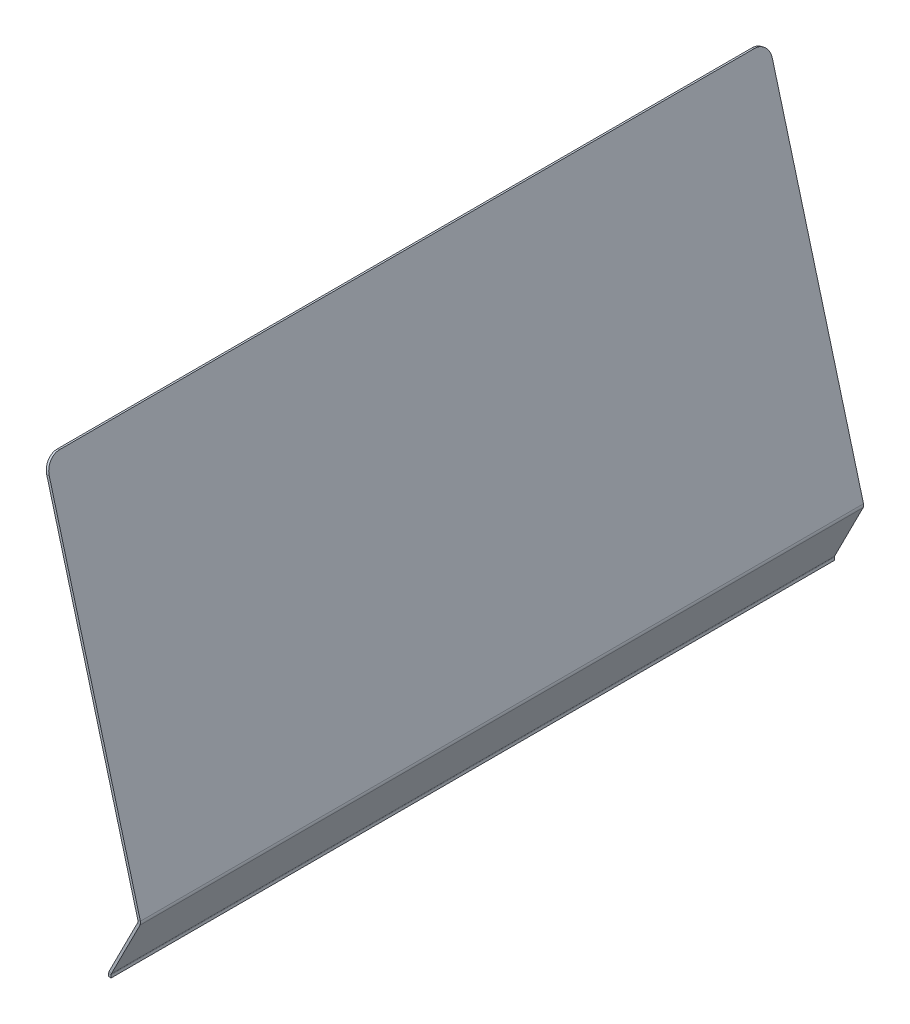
ISO-10303-21;
HEADER;
FILE_DESCRIPTION(('STEP AP214'),'2;1');
FILE_NAME('part.step','',(''),(''),'','','');
FILE_SCHEMA(('AUTOMOTIVE_DESIGN { 1 0 10303 214 1 1 1 1 }'));
ENDSEC;
DATA;
#1=APPLICATION_CONTEXT('core data for automotive mechanical design processes');
#2=APPLICATION_PROTOCOL_DEFINITION('international standard','automotive_design',2000,#1);
#3=PRODUCT_CONTEXT('',#1,'mechanical');
#4=PRODUCT('Part','Part','',(#3));
#5=PRODUCT_RELATED_PRODUCT_CATEGORY('part','',(#4));
#6=PRODUCT_DEFINITION_FORMATION('','',#4);
#7=PRODUCT_DEFINITION_CONTEXT('part definition',#1,'design');
#8=PRODUCT_DEFINITION('design','',#6,#7);
#9=PRODUCT_DEFINITION_SHAPE('','',#8);
#10=(LENGTH_UNIT() NAMED_UNIT(*) SI_UNIT(.MILLI.,.METRE.));
#11=(NAMED_UNIT(*) PLANE_ANGLE_UNIT() SI_UNIT($,.RADIAN.));
#12=(NAMED_UNIT(*) SI_UNIT($,.STERADIAN.) SOLID_ANGLE_UNIT());
#13=UNCERTAINTY_MEASURE_WITH_UNIT(LENGTH_MEASURE(1.E-05),#10,'distance_accuracy_value','');
#14=(GEOMETRIC_REPRESENTATION_CONTEXT(3) GLOBAL_UNCERTAINTY_ASSIGNED_CONTEXT((#13)) GLOBAL_UNIT_ASSIGNED_CONTEXT((#10,
#11,#12)) REPRESENTATION_CONTEXT('',''));
#15=CARTESIAN_POINT('',(0.,0.,0.));
#16=DIRECTION('',(0.,0.,1.));
#17=DIRECTION('',(1.,0.,0.));
#18=AXIS2_PLACEMENT_3D('',#15,#16,#17);
#19=CARTESIAN_POINT('',(-17.1240095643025,73.7281065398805,-1386.08704265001));
#20=DIRECTION('',(-0.965925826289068,-0.25881904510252,0.));
#21=DIRECTION('',(0.25881904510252,-0.965925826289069,0.));
#22=AXIS2_PLACEMENT_3D('',#19,#20,#21);
#23=PLANE('',#22);
#24=DIRECTION('',(-0.115900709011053,0.432547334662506,0.894130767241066));
#25=VECTOR('',#24,1.);
#26=CARTESIAN_POINT('',(-51.0033615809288,200.167569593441,-442.570704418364));
#27=LINE('',#26,#25);
#28=CARTESIAN_POINT('',(-51.0033615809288,200.167569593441,-442.570704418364));
#29=VERTEX_POINT('',#28);
#30=CARTESIAN_POINT('',(-59.4910951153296,231.844222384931,-377.091004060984));
#31=VERTEX_POINT('',#30);
#32=EDGE_CURVE('E702',#29,#31,#27,.T.);
#33=ORIENTED_EDGE('',*,*,#32,.F.);
#34=DIRECTION('',(0.120819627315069,-0.450904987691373,0.884357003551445));
#35=VECTOR('',#34,1.);
#36=CARTESIAN_POINT('',(-59.4910951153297,231.844222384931,-504.697916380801));
#37=LINE('',#36,#35);
#38=CARTESIAN_POINT('',(-59.4910951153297,231.844222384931,-504.697916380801));
#39=VERTEX_POINT('',#38);
#40=EDGE_CURVE('E726',#39,#29,#37,.T.);
#41=ORIENTED_EDGE('',*,*,#40,.F.);
#42=DIRECTION('',(0.25881904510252,-0.965925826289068,0.));
#43=VECTOR('',#42,1.);
#44=CARTESIAN_POINT('',(-79.7577241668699,307.480311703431,-504.697916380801));
#45=LINE('',#44,#43);
#46=CARTESIAN_POINT('',(-79.7577241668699,307.480311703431,-504.697916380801));
#47=VERTEX_POINT('',#46);
#48=EDGE_CURVE('E723',#47,#39,#45,.T.);
#49=ORIENTED_EDGE('',*,*,#48,.F.);
#50=DIRECTION('',(0.133692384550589,-0.498946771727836,-0.856258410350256));
#51=VECTOR('',#50,1.);
#52=CARTESIAN_POINT('',(-89.4579910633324,343.682200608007,-442.570704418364));
#53=LINE('',#52,#51);
#54=CARTESIAN_POINT('',(-89.4579910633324,343.682200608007,-442.570704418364));
#55=VERTEX_POINT('',#54);
#56=EDGE_CURVE('E720',#55,#47,#53,.T.);
#57=ORIENTED_EDGE('',*,*,#56,.F.);
#58=DIRECTION('',(-0.128570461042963,0.479831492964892,-0.867889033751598));
#59=VECTOR('',#58,1.);
#60=CARTESIAN_POINT('',(-79.7577241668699,307.480311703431,-377.091004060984));
#61=LINE('',#60,#59);
#62=CARTESIAN_POINT('',(-79.7577241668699,307.480311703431,-377.091004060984));
#63=VERTEX_POINT('',#62);
#64=EDGE_CURVE('E717',#63,#55,#61,.T.);
#65=ORIENTED_EDGE('',*,*,#64,.F.);
#66=DIRECTION('',(-0.25881904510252,0.965925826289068,0.));
#67=VECTOR('',#66,1.);
#68=CARTESIAN_POINT('',(-59.4910951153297,231.844222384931,-377.091004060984));
#69=LINE('',#68,#67);
#70=EDGE_CURVE('E714',#31,#63,#69,.T.);
#71=ORIENTED_EDGE('',*,*,#70,.F.);
#72=EDGE_LOOP('',(#33,#41,#49,#57,#65,#71));
#73=FACE_BOUND('',#72,.T.);
#74=DIRECTION('',(-0.133394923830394,0.497836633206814,-0.856950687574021));
#75=VECTOR('',#74,1.);
#76=CARTESIAN_POINT('',(-90.9264408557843,349.162529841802,-440.70025338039));
#77=LINE('',#76,#75);
#78=CARTESIAN_POINT('',(-80.222464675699,309.214746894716,-371.93616938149));
#79=VERTEX_POINT('',#78);
#80=CARTESIAN_POINT('',(-90.9264408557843,349.162529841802,-440.70025338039));
#81=VERTEX_POINT('',#80);
#82=EDGE_CURVE('E592',#79,#81,#77,.T.);
#83=ORIENTED_EDGE('',*,*,#82,.T.);
#84=DIRECTION('',(0.130917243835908,-0.488589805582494,-0.862635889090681));
#85=VECTOR('',#84,1.);
#86=CARTESIAN_POINT('',(-80.222464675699,309.214746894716,-511.23056503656));
#87=LINE('',#86,#85);
#88=CARTESIAN_POINT('',(-80.222464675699,309.214746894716,-511.23056503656));
#89=VERTEX_POINT('',#88);
#90=EDGE_CURVE('E587',#81,#89,#87,.T.);
#91=ORIENTED_EDGE('',*,*,#90,.T.);
#92=DIRECTION('',(0.258819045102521,-0.965925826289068,0.));
#93=VECTOR('',#92,1.);
#94=CARTESIAN_POINT('',(-59.0771865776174,230.299494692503,-511.23056503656));
#95=LINE('',#94,#93);
#96=CARTESIAN_POINT('',(-59.0771865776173,230.299494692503,-511.23056503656));
#97=VERTEX_POINT('',#96);
#98=EDGE_CURVE('E585',#89,#97,#95,.T.);
#99=ORIENTED_EDGE('',*,*,#98,.T.);
#100=DIRECTION('',(0.118927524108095,-0.443843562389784,0.88817742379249));
#101=VECTOR('',#100,1.);
#102=CARTESIAN_POINT('',(-49.8835874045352,195.988515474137,-442.570704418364));
#103=LINE('',#102,#101);
#104=CARTESIAN_POINT('',(-49.8835874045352,195.988515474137,-442.570704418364));
#105=VERTEX_POINT('',#104);
#106=EDGE_CURVE('E49',#97,#105,#103,.T.);
#107=ORIENTED_EDGE('',*,*,#106,.T.);
#108=DIRECTION('',(-0.116281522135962,0.433968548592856,0.893392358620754));
#109=VECTOR('',#108,1.);
#110=CARTESIAN_POINT('',(-59.0771865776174,230.299494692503,-371.93616938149));
#111=LINE('',#110,#109);
#112=CARTESIAN_POINT('',(-59.0771865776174,230.299494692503,-371.93616938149));
#113=VERTEX_POINT('',#112);
#114=EDGE_CURVE('E574',#105,#113,#111,.T.);
#115=ORIENTED_EDGE('',*,*,#114,.T.);
#116=DIRECTION('',(-0.258819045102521,0.965925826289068,0.));
#117=VECTOR('',#116,1.);
#118=CARTESIAN_POINT('',(-80.222464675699,309.214746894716,-371.93616938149));
#119=LINE('',#118,#117);
#120=EDGE_CURVE('E579',#113,#79,#119,.T.);
#121=ORIENTED_EDGE('',*,*,#120,.T.);
#122=EDGE_LOOP('',(#83,#91,#99,#107,#115,#121));
#123=FACE_BOUND('',#122,.T.);
#124=ADVANCED_FACE('F26',(#73,#123),#23,.T.);
#125=CARTESIAN_POINT('',(-50.9937023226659,200.170157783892,-442.570704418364));
#126=DIRECTION('',(0.231418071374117,-0.863664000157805,0.447805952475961));
#127=DIRECTION('',(0.,-0.460301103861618,-0.887762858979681));
#128=AXIS2_PLACEMENT_3D('',#125,#126,#127);
#129=PLANE('',#128);
#130=ORIENTED_EDGE('',*,*,#32,.T.);
#131=DIRECTION('',(-0.965925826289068,-0.25881904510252,0.));
#132=VECTOR('',#131,1.);
#133=CARTESIAN_POINT('',(-59.4814358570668,231.846810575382,-377.091004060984));
#134=LINE('',#133,#132);
#135=CARTESIAN_POINT('',(-59.4814358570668,231.846810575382,-377.091004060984));
#136=VERTEX_POINT('',#135);
#137=EDGE_CURVE('E747',#136,#31,#134,.T.);
#138=ORIENTED_EDGE('',*,*,#137,.F.);
#139=DIRECTION('',(-0.115900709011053,0.432547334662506,0.894130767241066));
#140=VECTOR('',#139,1.);
#141=CARTESIAN_POINT('',(-50.9937023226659,200.170157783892,-442.570704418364));
#142=LINE('',#141,#140);
#143=CARTESIAN_POINT('',(-50.9937023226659,200.170157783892,-442.570704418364));
#144=VERTEX_POINT('',#143);
#145=EDGE_CURVE('E729',#144,#136,#142,.T.);
#146=ORIENTED_EDGE('',*,*,#145,.F.);
#147=DIRECTION('',(-0.965925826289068,-0.25881904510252,0.));
#148=VECTOR('',#147,1.);
#149=CARTESIAN_POINT('',(-50.9937023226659,200.170157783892,-442.570704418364));
#150=LINE('',#149,#148);
#151=EDGE_CURVE('E748',#144,#29,#150,.T.);
#152=ORIENTED_EDGE('',*,*,#151,.T.);
#153=EDGE_LOOP('',(#130,#138,#146,#152));
#154=FACE_BOUND('',#153,.T.);
#155=ADVANCED_FACE('F1389',(#154),#129,.F.);
#156=CARTESIAN_POINT('',(-59.4814358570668,231.846810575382,-504.697916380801));
#157=DIRECTION('',(0.228888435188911,-0.854223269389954,-0.46681119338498));
#158=DIRECTION('',(0.,0.479541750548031,-0.877519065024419));
#159=AXIS2_PLACEMENT_3D('',#156,#157,#158);
#160=PLANE('',#159);
#161=ORIENTED_EDGE('',*,*,#40,.T.);
#162=ORIENTED_EDGE('',*,*,#151,.F.);
#163=DIRECTION('',(0.120819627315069,-0.450904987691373,0.884357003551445));
#164=VECTOR('',#163,1.);
#165=CARTESIAN_POINT('',(-59.4814358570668,231.846810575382,-504.697916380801));
#166=LINE('',#165,#164);
#167=CARTESIAN_POINT('',(-59.4814358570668,231.846810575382,-504.697916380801));
#168=VERTEX_POINT('',#167);
#169=EDGE_CURVE('E744',#168,#144,#166,.T.);
#170=ORIENTED_EDGE('',*,*,#169,.F.);
#171=DIRECTION('',(-0.965925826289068,-0.25881904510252,0.));
#172=VECTOR('',#171,1.);
#173=CARTESIAN_POINT('',(-59.4814358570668,231.846810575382,-504.697916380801));
#174=LINE('',#173,#172);
#175=EDGE_CURVE('E751',#168,#39,#174,.T.);
#176=ORIENTED_EDGE('',*,*,#175,.T.);
#177=EDGE_LOOP('',(#161,#162,#170,#176));
#178=FACE_BOUND('',#177,.T.);
#179=ADVANCED_FACE('F1398',(#178),#160,.F.);
#180=CARTESIAN_POINT('',(-79.748064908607,307.482899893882,-504.697916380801));
#181=DIRECTION('',(0.,0.,-1.));
#182=DIRECTION('',(-1.,0.,0.));
#183=AXIS2_PLACEMENT_3D('',#180,#181,#182);
#184=PLANE('',#183);
#185=ORIENTED_EDGE('',*,*,#48,.T.);
#186=ORIENTED_EDGE('',*,*,#175,.F.);
#187=DIRECTION('',(0.25881904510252,-0.965925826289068,0.));
#188=VECTOR('',#187,1.);
#189=CARTESIAN_POINT('',(-79.748064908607,307.482899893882,-504.697916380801));
#190=LINE('',#189,#188);
#191=CARTESIAN_POINT('',(-79.748064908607,307.482899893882,-504.697916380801));
#192=VERTEX_POINT('',#191);
#193=EDGE_CURVE('E741',#192,#168,#190,.T.);
#194=ORIENTED_EDGE('',*,*,#193,.F.);
#195=DIRECTION('',(-0.965925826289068,-0.25881904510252,0.));
#196=VECTOR('',#195,1.);
#197=CARTESIAN_POINT('',(-79.748064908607,307.482899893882,-504.697916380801));
#198=LINE('',#197,#196);
#199=EDGE_CURVE('E753',#192,#47,#198,.T.);
#200=ORIENTED_EDGE('',*,*,#199,.T.);
#201=EDGE_LOOP('',(#185,#186,#194,#200));
#202=FACE_BOUND('',#201,.T.);
#203=ADVANCED_FACE('F1452',(#202),#184,.F.);
#204=CARTESIAN_POINT('',(-89.4483318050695,343.684788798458,-442.570704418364));
#205=DIRECTION('',(-0.221615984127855,0.827082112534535,-0.516547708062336));
#206=DIRECTION('',(0.,0.529719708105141,0.848172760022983));
#207=AXIS2_PLACEMENT_3D('',#204,#205,#206);
#208=PLANE('',#207);
#209=ORIENTED_EDGE('',*,*,#56,.T.);
#210=ORIENTED_EDGE('',*,*,#199,.F.);
#211=DIRECTION('',(0.133692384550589,-0.498946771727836,-0.856258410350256));
#212=VECTOR('',#211,1.);
#213=CARTESIAN_POINT('',(-89.4483318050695,343.684788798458,-442.570704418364));
#214=LINE('',#213,#212);
#215=CARTESIAN_POINT('',(-89.4483318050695,343.684788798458,-442.570704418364));
#216=VERTEX_POINT('',#215);
#217=EDGE_CURVE('E738',#216,#192,#214,.T.);
#218=ORIENTED_EDGE('',*,*,#217,.F.);
#219=DIRECTION('',(-0.965925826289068,-0.25881904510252,0.));
#220=VECTOR('',#219,1.);
#221=CARTESIAN_POINT('',(-89.4483318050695,343.684788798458,-442.570704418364));
#222=LINE('',#221,#220);
#223=EDGE_CURVE('E755',#216,#55,#222,.T.);
#224=ORIENTED_EDGE('',*,*,#223,.T.);
#225=EDGE_LOOP('',(#209,#210,#218,#224));
#226=FACE_BOUND('',#225,.T.);
#227=ADVANCED_FACE('F1456',(#226),#208,.F.);
#228=CARTESIAN_POINT('',(-79.748064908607,307.482899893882,-377.091004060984));
#229=DIRECTION('',(-0.224626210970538,0.838316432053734,0.496758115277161));
#230=DIRECTION('',(0.,-0.509785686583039,0.860301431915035));
#231=AXIS2_PLACEMENT_3D('',#228,#229,#230);
#232=PLANE('',#231);
#233=ORIENTED_EDGE('',*,*,#64,.T.);
#234=ORIENTED_EDGE('',*,*,#223,.F.);
#235=DIRECTION('',(-0.128570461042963,0.479831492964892,-0.867889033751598));
#236=VECTOR('',#235,1.);
#237=CARTESIAN_POINT('',(-79.748064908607,307.482899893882,-377.091004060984));
#238=LINE('',#237,#236);
#239=CARTESIAN_POINT('',(-79.748064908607,307.482899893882,-377.091004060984));
#240=VERTEX_POINT('',#239);
#241=EDGE_CURVE('E735',#240,#216,#238,.T.);
#242=ORIENTED_EDGE('',*,*,#241,.F.);
#243=DIRECTION('',(-0.965925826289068,-0.25881904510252,0.));
#244=VECTOR('',#243,1.);
#245=CARTESIAN_POINT('',(-79.748064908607,307.482899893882,-377.091004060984));
#246=LINE('',#245,#244);
#247=EDGE_CURVE('E757',#240,#63,#246,.T.);
#248=ORIENTED_EDGE('',*,*,#247,.T.);
#249=EDGE_LOOP('',(#233,#234,#242,#248));
#250=FACE_BOUND('',#249,.T.);
#251=ADVANCED_FACE('F1460',(#250),#232,.F.);
#252=CARTESIAN_POINT('',(-59.4814358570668,231.846810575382,-377.091004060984));
#253=DIRECTION('',(0.,0.,1.));
#254=DIRECTION('',(1.,0.,0.));
#255=AXIS2_PLACEMENT_3D('',#252,#253,#254);
#256=PLANE('',#255);
#257=ORIENTED_EDGE('',*,*,#70,.T.);
#258=ORIENTED_EDGE('',*,*,#247,.F.);
#259=DIRECTION('',(-0.25881904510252,0.965925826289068,0.));
#260=VECTOR('',#259,1.);
#261=CARTESIAN_POINT('',(-59.4814358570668,231.846810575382,-377.091004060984));
#262=LINE('',#261,#260);
#263=EDGE_CURVE('E732',#136,#240,#262,.T.);
#264=ORIENTED_EDGE('',*,*,#263,.F.);
#265=ORIENTED_EDGE('',*,*,#137,.T.);
#266=EDGE_LOOP('',(#257,#258,#264,#265));
#267=FACE_BOUND('',#266,.T.);
#268=ADVANCED_FACE('F1448',(#267),#256,.F.);
#269=CARTESIAN_POINT('',(-59.4814358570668,231.846810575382,-377.091004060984));
#270=DIRECTION('',(-0.965925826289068,-0.25881904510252,0.));
#271=DIRECTION('',(0.25881904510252,-0.965925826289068,0.));
#272=AXIS2_PLACEMENT_3D('',#269,#270,#271);
#273=PLANE('',#272);
#274=DIRECTION('',(0.121265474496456,-0.452568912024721,0.883445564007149));
#275=VECTOR('',#274,1.);
#276=CARTESIAN_POINT('',(-60.7517089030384,236.587534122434,-500.61988750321));
#277=LINE('',#276,#275);
#278=CARTESIAN_POINT('',(-60.7517089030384,236.587534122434,-500.61988750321));
#279=VERTEX_POINT('',#278);
#280=CARTESIAN_POINT('',(-52.783632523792,206.850268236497,-442.570704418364));
#281=VERTEX_POINT('',#280);
#282=EDGE_CURVE('E696',#279,#281,#277,.T.);
#283=ORIENTED_EDGE('',*,*,#282,.F.);
#284=DIRECTION('',(0.25881904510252,-0.965925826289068,0.));
#285=VECTOR('',#284,1.);
#286=CARTESIAN_POINT('',(-60.7517089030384,236.587534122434,-500.61988750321));
#287=LINE('',#286,#285);
#288=CARTESIAN_POINT('',(-78.9974490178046,304.681563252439,-500.61988750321));
#289=VERTEX_POINT('',#288);
#290=EDGE_CURVE('E693',#289,#279,#287,.T.);
#291=ORIENTED_EDGE('',*,*,#290,.F.);
#292=DIRECTION('',(0.133083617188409,-0.49667482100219,-0.857672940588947));
#293=VECTOR('',#292,1.);
#294=CARTESIAN_POINT('',(-88.0048397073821,338.297602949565,-442.570704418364));
#295=LINE('',#294,#293);
#296=CARTESIAN_POINT('',(-88.0048397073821,338.297602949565,-442.570704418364));
#297=VERTEX_POINT('',#296);
#298=EDGE_CURVE('E690',#297,#289,#295,.T.);
#299=ORIENTED_EDGE('',*,*,#298,.F.);
#300=DIRECTION('',(-0.130380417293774,0.486586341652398,-0.863848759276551));
#301=VECTOR('',#300,1.);
#302=CARTESIAN_POINT('',(-78.9974490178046,304.681563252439,-382.891318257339));
#303=LINE('',#302,#301);
#304=CARTESIAN_POINT('',(-78.9974490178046,304.681563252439,-382.891318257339));
#305=VERTEX_POINT('',#304);
#306=EDGE_CURVE('E687',#305,#297,#303,.T.);
#307=ORIENTED_EDGE('',*,*,#306,.F.);
#308=DIRECTION('',(-0.25881904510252,0.965925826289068,0.));
#309=VECTOR('',#308,1.);
#310=CARTESIAN_POINT('',(-60.7517089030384,236.587534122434,-382.891318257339));
#311=LINE('',#310,#309);
#312=CARTESIAN_POINT('',(-60.7517089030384,236.587534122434,-382.891318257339));
#313=VERTEX_POINT('',#312);
#314=EDGE_CURVE('E684',#313,#305,#311,.T.);
#315=ORIENTED_EDGE('',*,*,#314,.F.);
#316=DIRECTION('',(-0.118656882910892,0.442833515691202,0.888717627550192));
#317=VECTOR('',#316,1.);
#318=CARTESIAN_POINT('',(-52.783632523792,206.850268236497,-442.570704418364));
#319=LINE('',#318,#317);
#320=EDGE_CURVE('E681',#281,#313,#319,.T.);
#321=ORIENTED_EDGE('',*,*,#320,.F.);
#322=EDGE_LOOP('',(#283,#291,#299,#307,#315,#321));
#323=FACE_BOUND('',#322,.T.);
#324=ORIENTED_EDGE('',*,*,#145,.T.);
#325=ORIENTED_EDGE('',*,*,#263,.T.);
#326=ORIENTED_EDGE('',*,*,#241,.T.);
#327=ORIENTED_EDGE('',*,*,#217,.T.);
#328=ORIENTED_EDGE('',*,*,#193,.T.);
#329=ORIENTED_EDGE('',*,*,#169,.T.);
#330=EDGE_LOOP('',(#324,#325,#326,#327,#328,#329));
#331=FACE_BOUND('',#330,.T.);
#332=ADVANCED_FACE('F1444',(#323,#331),#273,.T.);
#333=CARTESIAN_POINT('',(-52.783632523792,206.850268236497,-442.570704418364));
#334=DIRECTION('',(0.230017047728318,-0.858435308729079,0.458454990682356));
#335=DIRECTION('',(0.,-0.471086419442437,-0.882087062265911));
#336=AXIS2_PLACEMENT_3D('',#333,#334,#335);
#337=PLANE('',#336);
#338=DIRECTION('',(-0.118656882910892,0.442833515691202,0.888717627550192));
#339=VECTOR('',#338,1.);
#340=CARTESIAN_POINT('',(-52.7932917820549,206.847680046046,-442.570704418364));
#341=LINE('',#340,#339);
#342=CARTESIAN_POINT('',(-52.7932917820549,206.847680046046,-442.570704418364));
#343=VERTEX_POINT('',#342);
#344=CARTESIAN_POINT('',(-60.7613681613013,236.584945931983,-382.891318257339));
#345=VERTEX_POINT('',#344);
#346=EDGE_CURVE('E654',#343,#345,#341,.T.);
#347=ORIENTED_EDGE('',*,*,#346,.F.);
#348=DIRECTION('',(-0.965925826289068,-0.25881904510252,0.));
#349=VECTOR('',#348,1.);
#350=CARTESIAN_POINT('',(-52.783632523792,206.850268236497,-442.570704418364));
#351=LINE('',#350,#349);
#352=EDGE_CURVE('E700',#281,#343,#351,.T.);
#353=ORIENTED_EDGE('',*,*,#352,.F.);
#354=ORIENTED_EDGE('',*,*,#320,.T.);
#355=DIRECTION('',(-0.965925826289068,-0.25881904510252,0.));
#356=VECTOR('',#355,1.);
#357=CARTESIAN_POINT('',(-60.7517089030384,236.587534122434,-382.891318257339));
#358=LINE('',#357,#356);
#359=EDGE_CURVE('E699',#313,#345,#358,.T.);
#360=ORIENTED_EDGE('',*,*,#359,.T.);
#361=EDGE_LOOP('',(#347,#353,#354,#360));
#362=FACE_BOUND('',#361,.T.);
#363=ADVANCED_FACE('F1440',(#362),#337,.T.);
#364=CARTESIAN_POINT('',(-60.7517089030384,236.587534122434,-500.61988750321));
#365=DIRECTION('',(0.228652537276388,-0.853342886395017,-0.4685338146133));
#366=DIRECTION('',(0.,0.481283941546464,-0.876564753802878));
#367=AXIS2_PLACEMENT_3D('',#364,#365,#366);
#368=PLANE('',#367);
#369=DIRECTION('',(0.121265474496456,-0.452568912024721,0.883445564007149));
#370=VECTOR('',#369,1.);
#371=CARTESIAN_POINT('',(-60.7613681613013,236.584945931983,-500.61988750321));
#372=LINE('',#371,#370);
#373=CARTESIAN_POINT('',(-60.7613681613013,236.584945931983,-500.61988750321));
#374=VERTEX_POINT('',#373);
#375=EDGE_CURVE('E678',#374,#343,#372,.T.);
#376=ORIENTED_EDGE('',*,*,#375,.F.);
#377=DIRECTION('',(-0.965925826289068,-0.25881904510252,0.));
#378=VECTOR('',#377,1.);
#379=CARTESIAN_POINT('',(-60.7517089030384,236.587534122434,-500.61988750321));
#380=LINE('',#379,#378);
#381=EDGE_CURVE('E703',#279,#374,#380,.T.);
#382=ORIENTED_EDGE('',*,*,#381,.F.);
#383=ORIENTED_EDGE('',*,*,#282,.T.);
#384=ORIENTED_EDGE('',*,*,#352,.T.);
#385=EDGE_LOOP('',(#376,#382,#383,#384));
#386=FACE_BOUND('',#385,.T.);
#387=ADVANCED_FACE('F1443',(#386),#368,.T.);
#388=CARTESIAN_POINT('',(-60.7517089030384,236.587534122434,-500.61988750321));
#389=DIRECTION('',(0.,0.,-1.));
#390=DIRECTION('',(-1.,0.,0.));
#391=AXIS2_PLACEMENT_3D('',#388,#389,#390);
#392=PLANE('',#391);
#393=DIRECTION('',(0.25881904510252,-0.965925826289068,0.));
#394=VECTOR('',#393,1.);
#395=CARTESIAN_POINT('',(-60.7613681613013,236.584945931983,-500.61988750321));
#396=LINE('',#395,#394);
#397=CARTESIAN_POINT('',(-79.0071082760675,304.678975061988,-500.61988750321));
#398=VERTEX_POINT('',#397);
#399=EDGE_CURVE('E675',#398,#374,#396,.T.);
#400=ORIENTED_EDGE('',*,*,#399,.F.);
#401=DIRECTION('',(-0.965925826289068,-0.25881904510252,0.));
#402=VECTOR('',#401,1.);
#403=CARTESIAN_POINT('',(-78.9974490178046,304.681563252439,-500.61988750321));
#404=LINE('',#403,#402);
#405=EDGE_CURVE('E705',#289,#398,#404,.T.);
#406=ORIENTED_EDGE('',*,*,#405,.F.);
#407=ORIENTED_EDGE('',*,*,#290,.T.);
#408=ORIENTED_EDGE('',*,*,#381,.T.);
#409=EDGE_LOOP('',(#400,#406,#407,#408));
#410=FACE_BOUND('',#409,.T.);
#411=ADVANCED_FACE('F2155',(#410),#392,.T.);
#412=CARTESIAN_POINT('',(-88.0048397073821,338.297602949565,-442.570704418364));
#413=DIRECTION('',(-0.221982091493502,0.828448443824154,-0.514195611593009));
#414=DIRECTION('',(0.,0.527352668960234,0.849646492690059));
#415=AXIS2_PLACEMENT_3D('',#412,#413,#414);
#416=PLANE('',#415);
#417=DIRECTION('',(0.133083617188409,-0.49667482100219,-0.857672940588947));
#418=VECTOR('',#417,1.);
#419=CARTESIAN_POINT('',(-88.014498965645,338.295014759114,-442.570704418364));
#420=LINE('',#419,#418);
#421=CARTESIAN_POINT('',(-88.014498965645,338.295014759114,-442.570704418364));
#422=VERTEX_POINT('',#421);
#423=EDGE_CURVE('E672',#422,#398,#420,.T.);
#424=ORIENTED_EDGE('',*,*,#423,.F.);
#425=DIRECTION('',(-0.965925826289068,-0.25881904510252,0.));
#426=VECTOR('',#425,1.);
#427=CARTESIAN_POINT('',(-88.0048397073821,338.297602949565,-442.570704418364));
#428=LINE('',#427,#426);
#429=EDGE_CURVE('E707',#297,#422,#428,.T.);
#430=ORIENTED_EDGE('',*,*,#429,.F.);
#431=ORIENTED_EDGE('',*,*,#298,.T.);
#432=ORIENTED_EDGE('',*,*,#405,.T.);
#433=EDGE_LOOP('',(#424,#430,#431,#432));
#434=FACE_BOUND('',#433,.T.);
#435=ADVANCED_FACE('F1434',(#434),#416,.T.);
#436=CARTESIAN_POINT('',(-78.9974490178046,304.681563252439,-382.891318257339));
#437=DIRECTION('',(-0.223580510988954,0.834413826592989,0.503751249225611));
#438=DIRECTION('',(0.,-0.516834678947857,0.85608522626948));
#439=AXIS2_PLACEMENT_3D('',#436,#437,#438);
#440=PLANE('',#439);
#441=DIRECTION('',(-0.130380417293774,0.486586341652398,-0.863848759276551));
#442=VECTOR('',#441,1.);
#443=CARTESIAN_POINT('',(-79.0071082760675,304.678975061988,-382.891318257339));
#444=LINE('',#443,#442);
#445=CARTESIAN_POINT('',(-79.0071082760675,304.678975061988,-382.891318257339));
#446=VERTEX_POINT('',#445);
#447=EDGE_CURVE('E669',#446,#422,#444,.T.);
#448=ORIENTED_EDGE('',*,*,#447,.F.);
#449=DIRECTION('',(-0.965925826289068,-0.25881904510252,0.));
#450=VECTOR('',#449,1.);
#451=CARTESIAN_POINT('',(-78.9974490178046,304.681563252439,-382.891318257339));
#452=LINE('',#451,#450);
#453=EDGE_CURVE('E709',#305,#446,#452,.T.);
#454=ORIENTED_EDGE('',*,*,#453,.F.);
#455=ORIENTED_EDGE('',*,*,#306,.T.);
#456=ORIENTED_EDGE('',*,*,#429,.T.);
#457=EDGE_LOOP('',(#448,#454,#455,#456));
#458=FACE_BOUND('',#457,.T.);
#459=ADVANCED_FACE('F1426',(#458),#440,.T.);
#460=CARTESIAN_POINT('',(-60.7517089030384,236.587534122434,-382.891318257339));
#461=DIRECTION('',(0.,0.,1.));
#462=DIRECTION('',(1.,0.,0.));
#463=AXIS2_PLACEMENT_3D('',#460,#461,#462);
#464=PLANE('',#463);
#465=DIRECTION('',(-0.25881904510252,0.965925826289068,0.));
#466=VECTOR('',#465,1.);
#467=CARTESIAN_POINT('',(-60.7613681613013,236.584945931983,-382.891318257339));
#468=LINE('',#467,#466);
#469=EDGE_CURVE('E666',#345,#446,#468,.T.);
#470=ORIENTED_EDGE('',*,*,#469,.F.);
#471=ORIENTED_EDGE('',*,*,#359,.F.);
#472=ORIENTED_EDGE('',*,*,#314,.T.);
#473=ORIENTED_EDGE('',*,*,#453,.T.);
#474=EDGE_LOOP('',(#470,#471,#472,#473));
#475=FACE_BOUND('',#474,.T.);
#476=ADVANCED_FACE('F1416',(#475),#464,.T.);
#477=CARTESIAN_POINT('',(-75.434804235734,291.34695488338,-472.273792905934));
#478=DIRECTION('',(-0.965925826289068,-0.25881904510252,0.));
#479=DIRECTION('',(0.25881904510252,-0.965925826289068,0.));
#480=AXIS2_PLACEMENT_3D('',#477,#478,#479);
#481=CIRCLE('',#480,2.41243358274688);
#482=CARTESIAN_POINT('',(-74.8104204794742,289.016722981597,-472.273792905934));
#483=VERTEX_POINT('',#482);
#484=EDGE_CURVE('E816',#483,#483,#481,.T.);
#485=ORIENTED_EDGE('',*,*,#484,.T.);
#486=EDGE_LOOP('',(#485));
#487=FACE_BOUND('',#486,.T.);
#488=ADVANCED_FACE('F1407',(#487),#23,.T.);
#489=CARTESIAN_POINT('',(-75.4251449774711,291.349543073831,-472.273792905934));
#490=DIRECTION('',(-0.965925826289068,-0.25881904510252,0.));
#491=DIRECTION('',(0.25881904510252,-0.965925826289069,0.));
#492=AXIS2_PLACEMENT_3D('',#489,#490,#491);
#493=CYLINDRICAL_SURFACE('',#492,2.41243358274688);
#494=CARTESIAN_POINT('',(-75.4251449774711,291.349543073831,-472.273792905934));
#495=DIRECTION('',(-0.965925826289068,-0.25881904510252,0.));
#496=DIRECTION('',(0.25881904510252,-0.965925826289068,0.));
#497=AXIS2_PLACEMENT_3D('',#494,#495,#496);
#498=CIRCLE('',#497,2.41243358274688);
#499=CARTESIAN_POINT('',(-74.8007612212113,289.019311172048,-472.273792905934));
#500=VERTEX_POINT('',#499);
#501=EDGE_CURVE('E835',#500,#500,#498,.T.);
#502=ORIENTED_EDGE('',*,*,#501,.T.);
#503=EDGE_LOOP('',(#502));
#504=FACE_BOUND('',#503,.T.);
#505=ORIENTED_EDGE('',*,*,#484,.F.);
#506=EDGE_LOOP('',(#505));
#507=FACE_BOUND('',#506,.T.);
#508=ADVANCED_FACE('F1415',(#504,#507),#493,.T.);
#509=CARTESIAN_POINT('',(-76.9861043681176,297.175122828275,-388.49419226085));
#510=DIRECTION('',(-0.965925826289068,-0.258819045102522,0.));
#511=DIRECTION('',(0.258819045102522,-0.965925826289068,0.));
#512=AXIS2_PLACEMENT_3D('',#509,#510,#511);
#513=PLANE('',#512);
#514=DIRECTION('',(0.,0.,1.));
#515=VECTOR('',#514,1.);
#516=CARTESIAN_POINT('',(-76.9861043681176,297.175122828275,-397.126690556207));
#517=LINE('',#516,#515);
#518=CARTESIAN_POINT('',(-76.9861043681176,297.175122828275,-397.126690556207));
#519=VERTEX_POINT('',#518);
#520=CARTESIAN_POINT('',(-76.9861043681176,297.175122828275,-388.49419226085));
#521=VERTEX_POINT('',#520);
#522=EDGE_CURVE('E786',#519,#521,#517,.T.);
#523=ORIENTED_EDGE('',*,*,#522,.T.);
#524=DIRECTION('',(-0.258819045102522,0.965925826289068,0.));
#525=VECTOR('',#524,1.);
#526=CARTESIAN_POINT('',(-76.9861043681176,297.175122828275,-388.49419226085));
#527=LINE('',#526,#525);
#528=CARTESIAN_POINT('',(-79.0951771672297,305.046289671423,-388.49419226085));
#529=VERTEX_POINT('',#528);
#530=EDGE_CURVE('E789',#521,#529,#527,.T.);
#531=ORIENTED_EDGE('',*,*,#530,.T.);
#532=DIRECTION('',(-0.131356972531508,0.490230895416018,-0.861637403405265));
#533=VECTOR('',#532,1.);
#534=CARTESIAN_POINT('',(-79.0951771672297,305.046289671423,-388.49419226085));
#535=LINE('',#534,#533);
#536=CARTESIAN_POINT('',(-87.3391634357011,335.813265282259,-442.570704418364));
#537=VERTEX_POINT('',#536);
#538=EDGE_CURVE('E792',#529,#537,#535,.T.);
#539=ORIENTED_EDGE('',*,*,#538,.T.);
#540=DIRECTION('',(0.131325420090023,-0.490113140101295,-0.861709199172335));
#541=VECTOR('',#540,1.);
#542=CARTESIAN_POINT('',(-87.3391634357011,335.813265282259,-442.570704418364));
#543=LINE('',#542,#541);
#544=CARTESIAN_POINT('',(-79.6872916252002,307.256090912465,-492.779478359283));
#545=VERTEX_POINT('',#544);
#546=EDGE_CURVE('E795',#537,#545,#543,.T.);
#547=ORIENTED_EDGE('',*,*,#546,.T.);
#548=DIRECTION('',(0.25881904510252,-0.965925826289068,0.));
#549=VECTOR('',#548,1.);
#550=CARTESIAN_POINT('',(-79.6872916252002,307.256090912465,-492.779478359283));
#551=LINE('',#550,#549);
#552=CARTESIAN_POINT('',(-77.3281708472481,298.451732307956,-492.779478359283));
#553=VERTEX_POINT('',#552);
#554=EDGE_CURVE('E798',#545,#553,#551,.T.);
#555=ORIENTED_EDGE('',*,*,#554,.T.);
#556=DIRECTION('',(0.,0.,1.));
#557=VECTOR('',#556,1.);
#558=CARTESIAN_POINT('',(-77.3281708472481,298.451732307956,-492.779478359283));
#559=LINE('',#558,#557);
#560=CARTESIAN_POINT('',(-77.3281708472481,298.451732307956,-483.431298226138));
#561=VERTEX_POINT('',#560);
#562=EDGE_CURVE('E801',#553,#561,#559,.T.);
#563=ORIENTED_EDGE('',*,*,#562,.T.);
#564=DIRECTION('',(-0.258819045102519,0.965925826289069,0.));
#565=VECTOR('',#564,1.);
#566=CARTESIAN_POINT('',(-77.3281708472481,298.451732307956,-483.431298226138));
#567=LINE('',#566,#565);
#568=CARTESIAN_POINT('',(-77.8067286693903,300.237734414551,-483.431298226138));
#569=VERTEX_POINT('',#568);
#570=EDGE_CURVE('E804',#561,#569,#567,.T.);
#571=ORIENTED_EDGE('',*,*,#570,.T.);
#572=DIRECTION('',(-0.129164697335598,0.482049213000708,0.866570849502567));
#573=VECTOR('',#572,1.);
#574=CARTESIAN_POINT('',(-77.8067286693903,300.237734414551,-483.431298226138));
#575=LINE('',#574,#573);
#576=CARTESIAN_POINT('',(-83.8971092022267,322.967344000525,-442.570704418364));
#577=VERTEX_POINT('',#576);
#578=EDGE_CURVE('E807',#569,#577,#575,.T.);
#579=ORIENTED_EDGE('',*,*,#578,.T.);
#580=DIRECTION('',(0.131118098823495,-0.489339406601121,0.862180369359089));
#581=VECTOR('',#580,1.);
#582=CARTESIAN_POINT('',(-83.8971092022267,322.967344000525,-442.570704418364));
#583=LINE('',#582,#581);
#584=EDGE_CURVE('E810',#577,#519,#583,.T.);
#585=ORIENTED_EDGE('',*,*,#584,.T.);
#586=EDGE_LOOP('',(#523,#531,#539,#547,#555,#563,#571,#579,#585));
#587=FACE_BOUND('',#586,.T.);
#588=ADVANCED_FACE('F1422',(#587),#513,.T.);
#589=CARTESIAN_POINT('',(-75.4251449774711,291.349543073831,-472.273792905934));
#590=DIRECTION('',(-0.965925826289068,-0.25881904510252,0.));
#591=DIRECTION('',(0.25881904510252,-0.965925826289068,0.));
#592=AXIS2_PLACEMENT_3D('',#589,#590,#591);
#593=PLANE('',#592);
#594=ORIENTED_EDGE('',*,*,#501,.F.);
#595=EDGE_LOOP('',(#594));
#596=FACE_BOUND('',#595,.T.);
#597=CARTESIAN_POINT('',(-75.4251449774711,291.349543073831,-472.273792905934));
#598=DIRECTION('',(-0.965925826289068,-0.25881904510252,0.));
#599=DIRECTION('',(0.25881904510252,-0.965925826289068,0.));
#600=AXIS2_PLACEMENT_3D('',#597,#598,#599);
#601=CIRCLE('',#600,10.355434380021);
#602=CARTESIAN_POINT('',(-72.7449613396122,281.346961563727,-472.273792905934));
#603=VERTEX_POINT('',#602);
#604=EDGE_CURVE('E841',#603,#603,#601,.T.);
#605=ORIENTED_EDGE('',*,*,#604,.T.);
#606=EDGE_LOOP('',(#605));
#607=FACE_BOUND('',#606,.T.);
#608=ADVANCED_FACE('F1470',(#596,#607),#593,.T.);
#609=CARTESIAN_POINT('',(-75.7932284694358,292.72324936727,-415.108906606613));
#610=DIRECTION('',(-0.965925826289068,-0.25881904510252,0.));
#611=DIRECTION('',(0.25881904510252,-0.965925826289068,0.));
#612=AXIS2_PLACEMENT_3D('',#609,#610,#611);
#613=PLANE('',#612);
#614=CARTESIAN_POINT('',(-75.7932284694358,292.72324936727,-415.108906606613));
#615=DIRECTION('',(-0.965925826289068,-0.25881904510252,0.));
#616=DIRECTION('',(0.25881904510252,-0.965925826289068,0.));
#617=AXIS2_PLACEMENT_3D('',#614,#615,#616);
#618=CIRCLE('',#617,10.2309906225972);
#619=CARTESIAN_POINT('',(-75.5880848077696,291.957642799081,-404.908664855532));
#620=VERTEX_POINT('',#619);
#621=CARTESIAN_POINT('',(-75.5880848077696,291.957642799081,-425.309148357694));
#622=VERTEX_POINT('',#621);
#623=EDGE_CURVE('E867',#620,#622,#618,.T.);
#624=ORIENTED_EDGE('',*,*,#623,.T.);
#625=DIRECTION('',(0.25881904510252,-0.965925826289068,0.));
#626=VECTOR('',#625,1.);
#627=CARTESIAN_POINT('',(-75.5880848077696,291.957642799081,-425.309148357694));
#628=LINE('',#627,#626);
#629=CARTESIAN_POINT('',(-71.0895664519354,275.168943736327,-425.309148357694));
#630=VERTEX_POINT('',#629);
#631=EDGE_CURVE('E870',#622,#630,#628,.T.);
#632=ORIENTED_EDGE('',*,*,#631,.T.);
#633=DIRECTION('',(-0.184678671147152,0.689230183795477,0.700610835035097));
#634=VECTOR('',#633,1.);
#635=CARTESIAN_POINT('',(-73.5339445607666,284.291487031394,-416.035972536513));
#636=LINE('',#635,#634);
#637=CARTESIAN_POINT('',(-73.5339445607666,284.291487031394,-416.035972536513));
#638=VERTEX_POINT('',#637);
#639=EDGE_CURVE('E873',#630,#638,#636,.T.);
#640=ORIENTED_EDGE('',*,*,#639,.T.);
#641=DIRECTION('',(-0.25881904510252,0.965925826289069,0.));
#642=VECTOR('',#641,1.);
#643=CARTESIAN_POINT('',(-73.5339445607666,284.291487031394,-416.035972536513));
#644=LINE('',#643,#642);
#645=CARTESIAN_POINT('',(-75.7932284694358,292.72324936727,-416.035972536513));
#646=VERTEX_POINT('',#645);
#647=EDGE_CURVE('E876',#638,#646,#644,.T.);
#648=ORIENTED_EDGE('',*,*,#647,.T.);
#649=CARTESIAN_POINT('',(-75.7932284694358,292.72324936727,-415.108906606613));
#650=DIRECTION('',(0.965925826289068,0.25881904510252,0.));
#651=DIRECTION('',(0.25881904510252,-0.965925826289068,0.));
#652=AXIS2_PLACEMENT_3D('',#649,#650,#651);
#653=CIRCLE('',#652,0.927065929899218);
#654=CARTESIAN_POINT('',(-75.7932284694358,292.72324936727,-414.181840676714));
#655=VERTEX_POINT('',#654);
#656=EDGE_CURVE('E879',#646,#655,#653,.T.);
#657=ORIENTED_EDGE('',*,*,#656,.T.);
#658=DIRECTION('',(0.25881904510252,-0.965925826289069,0.));
#659=VECTOR('',#658,1.);
#660=CARTESIAN_POINT('',(-75.7932284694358,292.72324936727,-414.181840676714));
#661=LINE('',#660,#659);
#662=CARTESIAN_POINT('',(-73.5339445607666,284.291487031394,-414.181840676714));
#663=VERTEX_POINT('',#662);
#664=EDGE_CURVE('E882',#655,#663,#661,.T.);
#665=ORIENTED_EDGE('',*,*,#664,.T.);
#666=DIRECTION('',(0.184678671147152,-0.689230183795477,0.700610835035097));
#667=VECTOR('',#666,1.);
#668=CARTESIAN_POINT('',(-73.5339445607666,284.291487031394,-414.181840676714));
#669=LINE('',#668,#667);
#670=CARTESIAN_POINT('',(-71.0895664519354,275.168943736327,-404.908664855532));
#671=VERTEX_POINT('',#670);
#672=EDGE_CURVE('E885',#663,#671,#669,.T.);
#673=ORIENTED_EDGE('',*,*,#672,.T.);
#674=DIRECTION('',(-0.25881904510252,0.965925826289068,0.));
#675=VECTOR('',#674,1.);
#676=CARTESIAN_POINT('',(-75.5880848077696,291.957642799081,-404.908664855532));
#677=LINE('',#676,#675);
#678=EDGE_CURVE('E888',#671,#620,#677,.T.);
#679=ORIENTED_EDGE('',*,*,#678,.T.);
#680=EDGE_LOOP('',(#624,#632,#640,#648,#657,#665,#673,#679));
#681=FACE_BOUND('',#680,.T.);
#682=ADVANCED_FACE('F1511',(#681),#613,.T.);
#683=CARTESIAN_POINT('',(-77.8067286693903,300.237734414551,-430.918135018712));
#684=DIRECTION('',(-0.965925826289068,-0.25881904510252,0.));
#685=DIRECTION('',(0.25881904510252,-0.965925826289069,0.));
#686=AXIS2_PLACEMENT_3D('',#683,#684,#685);
#687=PLANE('',#686);
#688=DIRECTION('',(-0.25881904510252,0.965925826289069,0.));
#689=VECTOR('',#688,1.);
#690=CARTESIAN_POINT('',(-68.8857780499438,266.944293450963,-430.918135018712));
#691=LINE('',#690,#689);
#692=CARTESIAN_POINT('',(-68.8857780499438,266.944293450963,-430.918135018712));
#693=VERTEX_POINT('',#692);
#694=CARTESIAN_POINT('',(-77.8067286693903,300.237734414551,-430.918135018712));
#695=VERTEX_POINT('',#694);
#696=EDGE_CURVE('E937',#693,#695,#691,.T.);
#697=ORIENTED_EDGE('',*,*,#696,.T.);
#698=DIRECTION('',(0.,0.,-1.));
#699=VECTOR('',#698,1.);
#700=CARTESIAN_POINT('',(-77.8067286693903,300.237734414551,-430.918135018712));
#701=LINE('',#700,#699);
#702=CARTESIAN_POINT('',(-77.8067286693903,300.237734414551,-440.70025338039));
#703=VERTEX_POINT('',#702);
#704=EDGE_CURVE('E940',#695,#703,#701,.T.);
#705=ORIENTED_EDGE('',*,*,#704,.T.);
#706=DIRECTION('',(0.258819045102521,-0.965925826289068,0.));
#707=VECTOR('',#706,1.);
#708=CARTESIAN_POINT('',(-77.8067286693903,300.237734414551,-440.70025338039));
#709=LINE('',#708,#707);
#710=CARTESIAN_POINT('',(-62.5925162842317,243.457520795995,-440.70025338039));
#711=VERTEX_POINT('',#710);
#712=EDGE_CURVE('E943',#703,#711,#709,.T.);
#713=ORIENTED_EDGE('',*,*,#712,.T.);
#714=DIRECTION('',(-0.181704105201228,0.678128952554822,0.712126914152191));
#715=VECTOR('',#714,1.);
#716=CARTESIAN_POINT('',(-62.5925162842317,243.457520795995,-440.70025338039));
#717=LINE('',#716,#715);
#718=CARTESIAN_POINT('',(-68.8857780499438,266.944293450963,-416.035972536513));
#719=VERTEX_POINT('',#718);
#720=EDGE_CURVE('E946',#711,#719,#717,.T.);
#721=ORIENTED_EDGE('',*,*,#720,.T.);
#722=DIRECTION('',(0.184312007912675,-0.687861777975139,0.702050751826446));
#723=VECTOR('',#722,1.);
#724=CARTESIAN_POINT('',(-68.8857780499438,266.944293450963,-416.035972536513));
#725=LINE('',#724,#723);
#726=CARTESIAN_POINT('',(-61.6551315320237,239.959153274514,-388.49419226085));
#727=VERTEX_POINT('',#726);
#728=EDGE_CURVE('E949',#719,#727,#725,.T.);
#729=ORIENTED_EDGE('',*,*,#728,.T.);
#730=DIRECTION('',(-0.258819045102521,0.965925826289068,0.));
#731=VECTOR('',#730,1.);
#732=CARTESIAN_POINT('',(-61.6551315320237,239.959153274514,-388.49419226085));
#733=LINE('',#732,#731);
#734=CARTESIAN_POINT('',(-76.3172253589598,294.678832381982,-388.49419226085));
#735=VERTEX_POINT('',#734);
#736=EDGE_CURVE('E952',#727,#735,#733,.T.);
#737=ORIENTED_EDGE('',*,*,#736,.T.);
#738=DIRECTION('',(0.,0.,-1.));
#739=VECTOR('',#738,1.);
#740=CARTESIAN_POINT('',(-76.3172253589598,294.678832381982,-388.49419226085));
#741=LINE('',#740,#739);
#742=CARTESIAN_POINT('',(-76.3172253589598,294.678832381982,-397.126690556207));
#743=VERTEX_POINT('',#742);
#744=EDGE_CURVE('E955',#735,#743,#741,.T.);
#745=ORIENTED_EDGE('',*,*,#744,.T.);
#746=DIRECTION('',(0.258819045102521,-0.965925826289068,0.));
#747=VECTOR('',#746,1.);
#748=CARTESIAN_POINT('',(-76.3172253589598,294.678832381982,-397.126690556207));
#749=LINE('',#748,#747);
#750=CARTESIAN_POINT('',(-68.231350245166,264.501935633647,-397.126690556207));
#751=VERTEX_POINT('',#750);
#752=EDGE_CURVE('E958',#743,#751,#749,.T.);
#753=ORIENTED_EDGE('',*,*,#752,.T.);
#754=DIRECTION('',(-0.178901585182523,0.667669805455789,-0.722641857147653));
#755=VECTOR('',#754,1.);
#756=CARTESIAN_POINT('',(-68.231350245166,264.501935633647,-397.126690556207));
#757=LINE('',#756,#755);
#758=CARTESIAN_POINT('',(-72.9126463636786,281.972770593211,-416.035972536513));
#759=VERTEX_POINT('',#758);
#760=EDGE_CURVE('E961',#751,#759,#757,.T.);
#761=ORIENTED_EDGE('',*,*,#760,.T.);
#762=DIRECTION('',(0.187033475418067,-0.698018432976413,-0.691222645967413));
#763=VECTOR('',#762,1.);
#764=CARTESIAN_POINT('',(-72.9126463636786,281.972770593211,-416.035972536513));
#765=LINE('',#764,#763);
#766=EDGE_CURVE('E964',#759,#693,#765,.T.);
#767=ORIENTED_EDGE('',*,*,#766,.T.);
#768=EDGE_LOOP('',(#697,#705,#713,#721,#729,#737,#745,#753,#761,#767));
#769=FACE_BOUND('',#768,.T.);
#770=ADVANCED_FACE('F1519',(#769),#687,.T.);
#771=CARTESIAN_POINT('',(-77.8067286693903,300.237734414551,-443.988824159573));
#772=DIRECTION('',(-0.965925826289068,-0.258819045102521,0.));
#773=DIRECTION('',(0.258819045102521,-0.965925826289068,0.));
#774=AXIS2_PLACEMENT_3D('',#771,#772,#773);
#775=PLANE('',#774);
#776=DIRECTION('',(0.,0.,-1.));
#777=VECTOR('',#776,1.);
#778=CARTESIAN_POINT('',(-77.8067286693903,300.237734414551,-461.253820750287));
#779=LINE('',#778,#777);
#780=CARTESIAN_POINT('',(-77.8067286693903,300.237734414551,-443.988824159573));
#781=VERTEX_POINT('',#780);
#782=CARTESIAN_POINT('',(-77.8067286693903,300.237734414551,-461.253820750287));
#783=VERTEX_POINT('',#782);
#784=EDGE_CURVE('E1005',#781,#783,#779,.T.);
#785=ORIENTED_EDGE('',*,*,#784,.T.);
#786=DIRECTION('',(0.258819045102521,-0.965925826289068,0.));
#787=VECTOR('',#786,1.);
#788=CARTESIAN_POINT('',(-77.8067286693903,300.237734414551,-461.253820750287));
#789=LINE('',#788,#787);
#790=CARTESIAN_POINT('',(-75.6983128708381,292.369019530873,-461.253820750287));
#791=VERTEX_POINT('',#790);
#792=EDGE_CURVE('E1008',#783,#791,#789,.T.);
#793=ORIENTED_EDGE('',*,*,#792,.T.);
#794=DIRECTION('',(0.,0.,1.));
#795=VECTOR('',#794,1.);
#796=CARTESIAN_POINT('',(-75.6983128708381,292.369019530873,-461.253820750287));
#797=LINE('',#796,#795);
#798=CARTESIAN_POINT('',(-75.6983128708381,292.369019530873,-452.823547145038));
#799=VERTEX_POINT('',#798);
#800=EDGE_CURVE('E1011',#791,#799,#797,.T.);
#801=ORIENTED_EDGE('',*,*,#800,.T.);
#802=DIRECTION('',(0.25881904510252,-0.965925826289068,0.));
#803=VECTOR('',#802,1.);
#804=CARTESIAN_POINT('',(-75.6983128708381,292.369019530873,-452.823547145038));
#805=LINE('',#804,#803);
#806=CARTESIAN_POINT('',(-69.8056911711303,270.37745595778,-452.823547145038));
#807=VERTEX_POINT('',#806);
#808=EDGE_CURVE('E1014',#799,#807,#805,.T.);
#809=ORIENTED_EDGE('',*,*,#808,.T.);
#810=DIRECTION('',(0.,0.,1.));
#811=VECTOR('',#810,1.);
#812=CARTESIAN_POINT('',(-69.8056911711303,270.37745595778,-452.823547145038));
#813=LINE('',#812,#811);
#814=CARTESIAN_POINT('',(-69.8056911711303,270.37745595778,-443.988824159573));
#815=VERTEX_POINT('',#814);
#816=EDGE_CURVE('E1017',#807,#815,#813,.T.);
#817=ORIENTED_EDGE('',*,*,#816,.T.);
#818=DIRECTION('',(-0.258819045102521,0.965925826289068,0.));
#819=VECTOR('',#818,1.);
#820=CARTESIAN_POINT('',(-69.8056911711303,270.37745595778,-443.988824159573));
#821=LINE('',#820,#819);
#822=EDGE_CURVE('E1020',#815,#781,#821,.T.);
#823=ORIENTED_EDGE('',*,*,#822,.T.);
#824=EDGE_LOOP('',(#785,#793,#801,#809,#817,#823));
#825=FACE_BOUND('',#824,.T.);
#826=ADVANCED_FACE('F1555',(#825),#775,.T.);
#827=CARTESIAN_POINT('',(-69.8056911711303,270.37745595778,-462.624058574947));
#828=DIRECTION('',(0.965925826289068,0.258819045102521,0.));
#829=DIRECTION('',(-0.258819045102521,0.965925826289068,0.));
#830=AXIS2_PLACEMENT_3D('',#827,#828,#829);
#831=PLANE('',#830);
#832=DIRECTION('',(0.,0.,1.));
#833=VECTOR('',#832,1.);
#834=CARTESIAN_POINT('',(-69.8056911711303,270.37745595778,-500.236794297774));
#835=LINE('',#834,#833);
#836=CARTESIAN_POINT('',(-69.8056911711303,270.37745595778,-500.236794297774));
#837=VERTEX_POINT('',#836);
#838=CARTESIAN_POINT('',(-69.8056911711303,270.37745595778,-462.624058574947));
#839=VERTEX_POINT('',#838);
#840=EDGE_CURVE('E1059',#837,#839,#835,.T.);
#841=ORIENTED_EDGE('',*,*,#840,.T.);
#842=DIRECTION('',(-0.258819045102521,0.965925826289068,0.));
#843=VECTOR('',#842,1.);
#844=CARTESIAN_POINT('',(-72.4593221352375,280.280941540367,-462.624058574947));
#845=LINE('',#844,#843);
#846=CARTESIAN_POINT('',(-72.4593221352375,280.280941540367,-462.624058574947));
#847=VERTEX_POINT('',#846);
#848=EDGE_CURVE('E1062',#839,#847,#845,.T.);
#849=ORIENTED_EDGE('',*,*,#848,.T.);
#850=DIRECTION('',(0.,0.,-1.));
#851=VECTOR('',#850,1.);
#852=CARTESIAN_POINT('',(-72.4593221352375,280.280941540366,-483.431298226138));
#853=LINE('',#852,#851);
#854=CARTESIAN_POINT('',(-72.4593221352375,280.280941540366,-483.431298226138));
#855=VERTEX_POINT('',#854);
#856=EDGE_CURVE('E1065',#847,#855,#853,.T.);
#857=ORIENTED_EDGE('',*,*,#856,.T.);
#858=DIRECTION('',(-0.258819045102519,0.965925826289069,0.));
#859=VECTOR('',#858,1.);
#860=CARTESIAN_POINT('',(-76.9861043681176,297.175122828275,-483.431298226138));
#861=LINE('',#860,#859);
#862=CARTESIAN_POINT('',(-76.9861043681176,297.175122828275,-483.431298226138));
#863=VERTEX_POINT('',#862);
#864=EDGE_CURVE('E1068',#855,#863,#861,.T.);
#865=ORIENTED_EDGE('',*,*,#864,.T.);
#866=DIRECTION('',(0.,0.,-1.));
#867=VECTOR('',#866,1.);
#868=CARTESIAN_POINT('',(-76.9861043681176,297.175122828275,-492.779478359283));
#869=LINE('',#868,#867);
#870=CARTESIAN_POINT('',(-76.9861043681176,297.175122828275,-492.779478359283));
#871=VERTEX_POINT('',#870);
#872=EDGE_CURVE('E1071',#863,#871,#869,.T.);
#873=ORIENTED_EDGE('',*,*,#872,.T.);
#874=DIRECTION('',(0.258819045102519,-0.965925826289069,0.));
#875=VECTOR('',#874,1.);
#876=CARTESIAN_POINT('',(-72.4593221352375,280.280941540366,-492.779478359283));
#877=LINE('',#876,#875);
#878=CARTESIAN_POINT('',(-72.4593221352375,280.280941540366,-492.779478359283));
#879=VERTEX_POINT('',#878);
#880=EDGE_CURVE('E1074',#871,#879,#877,.T.);
#881=ORIENTED_EDGE('',*,*,#880,.T.);
#882=DIRECTION('',(0.,0.,-1.));
#883=VECTOR('',#882,1.);
#884=CARTESIAN_POINT('',(-72.4593221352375,280.280941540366,-500.236794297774));
#885=LINE('',#884,#883);
#886=CARTESIAN_POINT('',(-72.4593221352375,280.280941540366,-500.236794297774));
#887=VERTEX_POINT('',#886);
#888=EDGE_CURVE('E1077',#879,#887,#885,.T.);
#889=ORIENTED_EDGE('',*,*,#888,.T.);
#890=DIRECTION('',(0.258819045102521,-0.965925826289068,0.));
#891=VECTOR('',#890,1.);
#892=CARTESIAN_POINT('',(-69.8056911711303,270.37745595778,-500.236794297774));
#893=LINE('',#892,#891);
#894=EDGE_CURVE('E1080',#887,#837,#893,.T.);
#895=ORIENTED_EDGE('',*,*,#894,.T.);
#896=EDGE_LOOP('',(#841,#849,#857,#865,#873,#881,#889,#895));
#897=FACE_BOUND('',#896,.T.);
#898=ADVANCED_FACE('F1599',(#897),#831,.F.);
#899=CARTESIAN_POINT('',(-60.3473915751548,235.078601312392,-483.431298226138));
#900=DIRECTION('',(0.965925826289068,0.258819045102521,0.));
#901=DIRECTION('',(-0.258819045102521,0.965925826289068,0.));
#902=AXIS2_PLACEMENT_3D('',#899,#900,#901);
#903=PLANE('',#902);
#904=DIRECTION('',(0.123066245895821,-0.45928948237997,0.879720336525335));
#905=VECTOR('',#904,1.);
#906=CARTESIAN_POINT('',(-54.6313024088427,213.745866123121,-442.570704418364));
#907=LINE('',#906,#905);
#908=CARTESIAN_POINT('',(-61.6551315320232,239.959153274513,-492.779478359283));
#909=VERTEX_POINT('',#908);
#910=CARTESIAN_POINT('',(-54.6313024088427,213.745866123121,-442.570704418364));
#911=VERTEX_POINT('',#910);
#912=EDGE_CURVE('E1123',#909,#911,#907,.T.);
#913=ORIENTED_EDGE('',*,*,#912,.T.);
#914=DIRECTION('',(-0.116088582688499,0.43324848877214,0.893766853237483));
#915=VECTOR('',#914,1.);
#916=CARTESIAN_POINT('',(-61.558603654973,239.598906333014,-389.237361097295));
#917=LINE('',#916,#915);
#918=CARTESIAN_POINT('',(-61.558603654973,239.598906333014,-389.237361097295));
#919=VERTEX_POINT('',#918);
#920=EDGE_CURVE('E1126',#911,#919,#917,.T.);
#921=ORIENTED_EDGE('',*,*,#920,.T.);
#922=DIRECTION('',(-0.182428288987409,0.68083164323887,-0.709357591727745));
#923=VECTOR('',#922,1.);
#924=CARTESIAN_POINT('',(-61.558603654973,239.598906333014,-389.237361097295));
#925=LINE('',#924,#923);
#926=CARTESIAN_POINT('',(-63.8079519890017,247.99358859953,-397.983769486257));
#927=VERTEX_POINT('',#926);
#928=EDGE_CURVE('E1129',#919,#927,#925,.T.);
#929=ORIENTED_EDGE('',*,*,#928,.T.);
#930=DIRECTION('',(0.11789240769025,-0.439980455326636,-0.890235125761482));
#931=VECTOR('',#930,1.);
#932=CARTESIAN_POINT('',(-63.8079519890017,247.99358859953,-397.983769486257));
#933=LINE('',#932,#931);
#934=CARTESIAN_POINT('',(-57.9033758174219,225.957410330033,-442.570704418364));
#935=VERTEX_POINT('',#934);
#936=EDGE_CURVE('E1132',#927,#935,#933,.T.);
#937=ORIENTED_EDGE('',*,*,#936,.T.);
#938=DIRECTION('',(-0.118120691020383,0.440832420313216,-0.889783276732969));
#939=VECTOR('',#938,1.);
#940=CARTESIAN_POINT('',(-57.9033758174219,225.957410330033,-442.570704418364));
#941=LINE('',#940,#939);
#942=CARTESIAN_POINT('',(-63.3277096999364,246.201299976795,-483.431298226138));
#943=VERTEX_POINT('',#942);
#944=EDGE_CURVE('E1135',#935,#943,#941,.T.);
#945=ORIENTED_EDGE('',*,*,#944,.T.);
#946=DIRECTION('',(-0.258819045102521,0.965925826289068,0.));
#947=VECTOR('',#946,1.);
#948=CARTESIAN_POINT('',(-63.3277096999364,246.201299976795,-483.431298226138));
#949=LINE('',#948,#947);
#950=CARTESIAN_POINT('',(-69.7035703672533,269.996335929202,-483.431298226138));
#951=VERTEX_POINT('',#950);
#952=EDGE_CURVE('E1138',#943,#951,#949,.T.);
#953=ORIENTED_EDGE('',*,*,#952,.T.);
#954=DIRECTION('',(0.,0.,-1.));
#955=VECTOR('',#954,1.);
#956=CARTESIAN_POINT('',(-69.7035703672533,269.996335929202,-483.431298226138));
#957=LINE('',#956,#955);
#958=CARTESIAN_POINT('',(-69.7035703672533,269.996335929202,-492.779478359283));
#959=VERTEX_POINT('',#958);
#960=EDGE_CURVE('E1141',#951,#959,#957,.T.);
#961=ORIENTED_EDGE('',*,*,#960,.T.);
#962=DIRECTION('',(0.258819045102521,-0.965925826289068,0.));
#963=VECTOR('',#962,1.);
#964=CARTESIAN_POINT('',(-61.6551315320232,239.959153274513,-492.779478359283));
#965=LINE('',#964,#963);
#966=EDGE_CURVE('E1144',#959,#909,#965,.T.);
#967=ORIENTED_EDGE('',*,*,#966,.T.);
#968=EDGE_LOOP('',(#913,#921,#929,#937,#945,#953,#961,#967));
#969=FACE_BOUND('',#968,.T.);
#970=ADVANCED_FACE('F1504',(#969),#903,.F.);
#971=CARTESIAN_POINT('',(-76.9861043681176,297.175122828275,-388.49419226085));
#972=DIRECTION('',(0.,0.,1.));
#973=DIRECTION('',(1.,0.,0.));
#974=AXIS2_PLACEMENT_3D('',#971,#972,#973);
#975=PLANE('',#974);
#976=DIRECTION('',(-0.258819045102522,0.965925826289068,0.));
#977=VECTOR('',#976,1.);
#978=CARTESIAN_POINT('',(-76.9957636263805,297.172534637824,-388.49419226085));
#979=LINE('',#978,#977);
#980=CARTESIAN_POINT('',(-76.9957636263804,297.172534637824,-388.49419226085));
#981=VERTEX_POINT('',#980);
#982=CARTESIAN_POINT('',(-79.1048364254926,305.043701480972,-388.49419226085));
#983=VERTEX_POINT('',#982);
#984=EDGE_CURVE('E762',#981,#983,#979,.T.);
#985=ORIENTED_EDGE('',*,*,#984,.T.);
#986=DIRECTION('',(-0.965925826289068,-0.25881904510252,0.));
#987=VECTOR('',#986,1.);
#988=CARTESIAN_POINT('',(-79.0951771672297,305.046289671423,-388.49419226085));
#989=LINE('',#988,#987);
#990=EDGE_CURVE('E829',#529,#983,#989,.T.);
#991=ORIENTED_EDGE('',*,*,#990,.F.);
#992=ORIENTED_EDGE('',*,*,#530,.F.);
#993=DIRECTION('',(-0.965925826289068,-0.25881904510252,0.));
#994=VECTOR('',#993,1.);
#995=CARTESIAN_POINT('',(-76.9861043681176,297.175122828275,-388.49419226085));
#996=LINE('',#995,#994);
#997=EDGE_CURVE('E813',#521,#981,#996,.T.);
#998=ORIENTED_EDGE('',*,*,#997,.T.);
#999=EDGE_LOOP('',(#985,#991,#992,#998));
#1000=FACE_BOUND('',#999,.T.);
#1001=ADVANCED_FACE('F1500',(#1000),#975,.F.);
#1002=CARTESIAN_POINT('',(-79.0951771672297,305.046289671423,-388.49419226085));
#1003=DIRECTION('',(-0.223008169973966,0.832277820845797,0.507524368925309));
#1004=DIRECTION('',(0.,-0.520635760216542,0.853778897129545));
#1005=AXIS2_PLACEMENT_3D('',#1002,#1003,#1004);
#1006=PLANE('',#1005);
#1007=DIRECTION('',(-0.131356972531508,0.490230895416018,-0.861637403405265));
#1008=VECTOR('',#1007,1.);
#1009=CARTESIAN_POINT('',(-79.1048364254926,305.043701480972,-388.49419226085));
#1010=LINE('',#1009,#1008);
#1011=CARTESIAN_POINT('',(-87.348822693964,335.810677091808,-442.570704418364));
#1012=VERTEX_POINT('',#1011);
#1013=EDGE_CURVE('E765',#983,#1012,#1010,.T.);
#1014=ORIENTED_EDGE('',*,*,#1013,.T.);
#1015=DIRECTION('',(-0.965925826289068,-0.25881904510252,0.));
#1016=VECTOR('',#1015,1.);
#1017=CARTESIAN_POINT('',(-87.3391634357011,335.813265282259,-442.570704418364));
#1018=LINE('',#1017,#1016);
#1019=EDGE_CURVE('E827',#537,#1012,#1018,.T.);
#1020=ORIENTED_EDGE('',*,*,#1019,.F.);
#1021=ORIENTED_EDGE('',*,*,#538,.F.);
#1022=ORIENTED_EDGE('',*,*,#990,.T.);
#1023=EDGE_LOOP('',(#1014,#1020,#1021,#1022));
#1024=FACE_BOUND('',#1023,.T.);
#1025=ADVANCED_FACE('F1496',(#1024),#1006,.F.);
#1026=CARTESIAN_POINT('',(-87.3391634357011,335.813265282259,-442.570704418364));
#1027=DIRECTION('',(-0.223026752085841,0.832347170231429,-0.50740245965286));
#1028=DIRECTION('',(0.,0.520512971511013,0.853853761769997));
#1029=AXIS2_PLACEMENT_3D('',#1026,#1027,#1028);
#1030=PLANE('',#1029);
#1031=DIRECTION('',(0.131325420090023,-0.490113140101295,-0.861709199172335));
#1032=VECTOR('',#1031,1.);
#1033=CARTESIAN_POINT('',(-87.348822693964,335.810677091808,-442.570704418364));
#1034=LINE('',#1033,#1032);
#1035=CARTESIAN_POINT('',(-79.6969508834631,307.253502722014,-492.779478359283));
#1036=VERTEX_POINT('',#1035);
#1037=EDGE_CURVE('E768',#1012,#1036,#1034,.T.);
#1038=ORIENTED_EDGE('',*,*,#1037,.T.);
#1039=DIRECTION('',(-0.965925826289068,-0.25881904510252,0.));
#1040=VECTOR('',#1039,1.);
#1041=CARTESIAN_POINT('',(-79.6872916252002,307.256090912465,-492.779478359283));
#1042=LINE('',#1041,#1040);
#1043=EDGE_CURVE('E825',#545,#1036,#1042,.T.);
#1044=ORIENTED_EDGE('',*,*,#1043,.F.);
#1045=ORIENTED_EDGE('',*,*,#546,.F.);
#1046=ORIENTED_EDGE('',*,*,#1019,.T.);
#1047=EDGE_LOOP('',(#1038,#1044,#1045,#1046));
#1048=FACE_BOUND('',#1047,.T.);
#1049=ADVANCED_FACE('F1492',(#1048),#1030,.F.);
#1050=CARTESIAN_POINT('',(-79.6872916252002,307.256090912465,-492.779478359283));
#1051=DIRECTION('',(0.,0.,-1.));
#1052=DIRECTION('',(-1.,0.,0.));
#1053=AXIS2_PLACEMENT_3D('',#1050,#1051,#1052);
#1054=PLANE('',#1053);
#1055=DIRECTION('',(0.25881904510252,-0.965925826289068,0.));
#1056=VECTOR('',#1055,1.);
#1057=CARTESIAN_POINT('',(-79.6969508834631,307.253502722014,-492.779478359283));
#1058=LINE('',#1057,#1056);
#1059=CARTESIAN_POINT('',(-77.337830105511,298.449144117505,-492.779478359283));
#1060=VERTEX_POINT('',#1059);
#1061=EDGE_CURVE('E771',#1036,#1060,#1058,.T.);
#1062=ORIENTED_EDGE('',*,*,#1061,.T.);
#1063=DIRECTION('',(-0.965925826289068,-0.25881904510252,0.));
#1064=VECTOR('',#1063,1.);
#1065=CARTESIAN_POINT('',(-77.3281708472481,298.451732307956,-492.779478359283));
#1066=LINE('',#1065,#1064);
#1067=EDGE_CURVE('E823',#553,#1060,#1066,.T.);
#1068=ORIENTED_EDGE('',*,*,#1067,.F.);
#1069=ORIENTED_EDGE('',*,*,#554,.F.);
#1070=ORIENTED_EDGE('',*,*,#1043,.T.);
#1071=EDGE_LOOP('',(#1062,#1068,#1069,#1070));
#1072=FACE_BOUND('',#1071,.T.);
#1073=ADVANCED_FACE('F1488',(#1072),#1054,.F.);
#1074=CARTESIAN_POINT('',(-77.3281708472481,298.451732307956,-492.779478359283));
#1075=DIRECTION('',(0.25881904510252,-0.965925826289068,0.));
#1076=DIRECTION('',(0.965925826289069,0.25881904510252,0.));
#1077=AXIS2_PLACEMENT_3D('',#1074,#1075,#1076);
#1078=PLANE('',#1077);
#1079=DIRECTION('',(0.,0.,1.));
#1080=VECTOR('',#1079,1.);
#1081=CARTESIAN_POINT('',(-77.337830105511,298.449144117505,-492.779478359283));
#1082=LINE('',#1081,#1080);
#1083=CARTESIAN_POINT('',(-77.337830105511,298.449144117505,-483.431298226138));
#1084=VERTEX_POINT('',#1083);
#1085=EDGE_CURVE('E774',#1060,#1084,#1082,.T.);
#1086=ORIENTED_EDGE('',*,*,#1085,.T.);
#1087=DIRECTION('',(-0.965925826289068,-0.25881904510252,0.));
#1088=VECTOR('',#1087,1.);
#1089=CARTESIAN_POINT('',(-77.3281708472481,298.451732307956,-483.431298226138));
#1090=LINE('',#1089,#1088);
#1091=EDGE_CURVE('E821',#561,#1084,#1090,.T.);
#1092=ORIENTED_EDGE('',*,*,#1091,.F.);
#1093=ORIENTED_EDGE('',*,*,#562,.F.);
#1094=ORIENTED_EDGE('',*,*,#1067,.T.);
#1095=EDGE_LOOP('',(#1086,#1092,#1093,#1094));
#1096=FACE_BOUND('',#1095,.T.);
#1097=ADVANCED_FACE('F1484',(#1096),#1078,.F.);
#1098=CARTESIAN_POINT('',(-77.3281708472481,298.451732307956,-483.431298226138));
#1099=DIRECTION('',(0.,0.,1.));
#1100=DIRECTION('',(1.,0.,0.));
#1101=AXIS2_PLACEMENT_3D('',#1098,#1099,#1100);
#1102=PLANE('',#1101);
#1103=DIRECTION('',(-0.258819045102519,0.965925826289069,0.));
#1104=VECTOR('',#1103,1.);
#1105=CARTESIAN_POINT('',(-77.337830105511,298.449144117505,-483.431298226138));
#1106=LINE('',#1105,#1104);
#1107=CARTESIAN_POINT('',(-77.8163879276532,300.2351462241,-483.431298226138));
#1108=VERTEX_POINT('',#1107);
#1109=EDGE_CURVE('E777',#1084,#1108,#1106,.T.);
#1110=ORIENTED_EDGE('',*,*,#1109,.T.);
#1111=DIRECTION('',(-0.965925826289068,-0.25881904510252,0.));
#1112=VECTOR('',#1111,1.);
#1113=CARTESIAN_POINT('',(-77.8067286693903,300.237734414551,-483.431298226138));
#1114=LINE('',#1113,#1112);
#1115=EDGE_CURVE('E819',#569,#1108,#1114,.T.);
#1116=ORIENTED_EDGE('',*,*,#1115,.F.);
#1117=ORIENTED_EDGE('',*,*,#570,.F.);
#1118=ORIENTED_EDGE('',*,*,#1091,.T.);
#1119=EDGE_LOOP('',(#1110,#1116,#1117,#1118));
#1120=FACE_BOUND('',#1119,.T.);
#1121=ADVANCED_FACE('F1480',(#1120),#1102,.F.);
#1122=CARTESIAN_POINT('',(-77.8067286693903,300.237734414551,-483.431298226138));
#1123=DIRECTION('',(0.224285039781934,-0.837043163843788,0.499054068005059));
#1124=DIRECTION('',(0.,-0.512100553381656,-0.858925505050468));
#1125=AXIS2_PLACEMENT_3D('',#1122,#1123,#1124);
#1126=PLANE('',#1125);
#1127=DIRECTION('',(-0.129164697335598,0.482049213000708,0.866570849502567));
#1128=VECTOR('',#1127,1.);
#1129=CARTESIAN_POINT('',(-77.8163879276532,300.2351462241,-483.431298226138));
#1130=LINE('',#1129,#1128);
#1131=CARTESIAN_POINT('',(-83.9067684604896,322.964755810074,-442.570704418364));
#1132=VERTEX_POINT('',#1131);
#1133=EDGE_CURVE('E780',#1108,#1132,#1130,.T.);
#1134=ORIENTED_EDGE('',*,*,#1133,.T.);
#1135=DIRECTION('',(-0.965925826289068,-0.25881904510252,0.));
#1136=VECTOR('',#1135,1.);
#1137=CARTESIAN_POINT('',(-83.8971092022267,322.967344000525,-442.570704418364));
#1138=LINE('',#1137,#1136);
#1139=EDGE_CURVE('E817',#577,#1132,#1138,.T.);
#1140=ORIENTED_EDGE('',*,*,#1139,.F.);
#1141=ORIENTED_EDGE('',*,*,#578,.F.);
#1142=ORIENTED_EDGE('',*,*,#1115,.T.);
#1143=EDGE_LOOP('',(#1134,#1140,#1141,#1142));
#1144=FACE_BOUND('',#1143,.T.);
#1145=ADVANCED_FACE('F1476',(#1144),#1126,.F.);
#1146=CARTESIAN_POINT('',(-83.8971092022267,322.967344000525,-442.570704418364));
#1147=DIRECTION('',(0.223148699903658,-0.832802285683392,-0.506601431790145));
#1148=DIRECTION('',(0.,0.519706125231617,-0.854345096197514));
#1149=AXIS2_PLACEMENT_3D('',#1146,#1147,#1148);
#1150=PLANE('',#1149);
#1151=DIRECTION('',(0.131118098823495,-0.489339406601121,0.862180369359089));
#1152=VECTOR('',#1151,1.);
#1153=CARTESIAN_POINT('',(-83.9067684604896,322.964755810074,-442.570704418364));
#1154=LINE('',#1153,#1152);
#1155=CARTESIAN_POINT('',(-76.9957636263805,297.172534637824,-397.126690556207));
#1156=VERTEX_POINT('',#1155);
#1157=EDGE_CURVE('E783',#1132,#1156,#1154,.T.);
#1158=ORIENTED_EDGE('',*,*,#1157,.T.);
#1159=DIRECTION('',(-0.965925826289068,-0.25881904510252,0.));
#1160=VECTOR('',#1159,1.);
#1161=CARTESIAN_POINT('',(-76.9861043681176,297.175122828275,-397.126690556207));
#1162=LINE('',#1161,#1160);
#1163=EDGE_CURVE('E814',#519,#1156,#1162,.T.);
#1164=ORIENTED_EDGE('',*,*,#1163,.F.);
#1165=ORIENTED_EDGE('',*,*,#584,.F.);
#1166=ORIENTED_EDGE('',*,*,#1139,.T.);
#1167=EDGE_LOOP('',(#1158,#1164,#1165,#1166));
#1168=FACE_BOUND('',#1167,.T.);
#1169=ADVANCED_FACE('F1472',(#1168),#1150,.F.);
#1170=CARTESIAN_POINT('',(-76.9861043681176,297.175122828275,-397.126690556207));
#1171=DIRECTION('',(0.25881904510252,-0.965925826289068,0.));
#1172=DIRECTION('',(0.965925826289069,0.25881904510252,0.));
#1173=AXIS2_PLACEMENT_3D('',#1170,#1171,#1172);
#1174=PLANE('',#1173);
#1175=DIRECTION('',(0.,0.,1.));
#1176=VECTOR('',#1175,1.);
#1177=CARTESIAN_POINT('',(-76.9957636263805,297.172534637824,-397.126690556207));
#1178=LINE('',#1177,#1176);
#1179=EDGE_CURVE('E750',#1156,#981,#1178,.T.);
#1180=ORIENTED_EDGE('',*,*,#1179,.T.);
#1181=ORIENTED_EDGE('',*,*,#997,.F.);
#1182=ORIENTED_EDGE('',*,*,#522,.F.);
#1183=ORIENTED_EDGE('',*,*,#1163,.T.);
#1184=EDGE_LOOP('',(#1180,#1181,#1182,#1183));
#1185=FACE_BOUND('',#1184,.T.);
#1186=ADVANCED_FACE('F1475',(#1185),#1174,.F.);
#1187=CARTESIAN_POINT('',(-75.4251449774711,291.349543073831,-472.273792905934));
#1188=DIRECTION('',(-0.965925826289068,-0.25881904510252,0.));
#1189=DIRECTION('',(0.25881904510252,-0.965925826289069,0.));
#1190=AXIS2_PLACEMENT_3D('',#1187,#1188,#1189);
#1191=CYLINDRICAL_SURFACE('',#1190,10.355434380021);
#1192=ORIENTED_EDGE('',*,*,#604,.F.);
#1193=EDGE_LOOP('',(#1192));
#1194=FACE_BOUND('',#1193,.T.);
#1195=CARTESIAN_POINT('',(-75.434804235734,291.34695488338,-472.273792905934));
#1196=DIRECTION('',(-0.965925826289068,-0.25881904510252,0.));
#1197=DIRECTION('',(0.25881904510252,-0.965925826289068,0.));
#1198=AXIS2_PLACEMENT_3D('',#1195,#1196,#1197);
#1199=CIRCLE('',#1198,10.355434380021);
#1200=CARTESIAN_POINT('',(-72.7546205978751,281.344373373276,-472.273792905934));
#1201=VERTEX_POINT('',#1200);
#1202=EDGE_CURVE('E838',#1201,#1201,#1199,.T.);
#1203=ORIENTED_EDGE('',*,*,#1202,.T.);
#1204=EDGE_LOOP('',(#1203));
#1205=FACE_BOUND('',#1204,.T.);
#1206=ADVANCED_FACE('F1506',(#1194,#1205),#1191,.F.);
#1207=CARTESIAN_POINT('',(-75.5880848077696,291.957642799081,-425.309148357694));
#1208=DIRECTION('',(0.,0.,-1.));
#1209=DIRECTION('',(-1.,0.,0.));
#1210=AXIS2_PLACEMENT_3D('',#1207,#1208,#1209);
#1211=PLANE('',#1210);
#1212=DIRECTION('',(0.25881904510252,-0.965925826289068,0.));
#1213=VECTOR('',#1212,1.);
#1214=CARTESIAN_POINT('',(-75.5977440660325,291.95505460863,-425.309148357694));
#1215=LINE('',#1214,#1213);
#1216=CARTESIAN_POINT('',(-75.5977440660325,291.955054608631,-425.309148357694));
#1217=VERTEX_POINT('',#1216);
#1218=CARTESIAN_POINT('',(-71.0992257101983,275.166355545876,-425.309148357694));
#1219=VERTEX_POINT('',#1218);
#1220=EDGE_CURVE('E846',#1217,#1219,#1215,.T.);
#1221=ORIENTED_EDGE('',*,*,#1220,.T.);
#1222=DIRECTION('',(-0.965925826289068,-0.25881904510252,0.));
#1223=VECTOR('',#1222,1.);
#1224=CARTESIAN_POINT('',(-71.0895664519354,275.168943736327,-425.309148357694));
#1225=LINE('',#1224,#1223);
#1226=EDGE_CURVE('E905',#630,#1219,#1225,.T.);
#1227=ORIENTED_EDGE('',*,*,#1226,.F.);
#1228=ORIENTED_EDGE('',*,*,#631,.F.);
#1229=DIRECTION('',(-0.965925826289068,-0.25881904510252,0.));
#1230=VECTOR('',#1229,1.);
#1231=CARTESIAN_POINT('',(-75.5880848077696,291.957642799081,-425.309148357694));
#1232=LINE('',#1231,#1230);
#1233=EDGE_CURVE('E891',#622,#1217,#1232,.T.);
#1234=ORIENTED_EDGE('',*,*,#1233,.T.);
#1235=EDGE_LOOP('',(#1221,#1227,#1228,#1234));
#1236=FACE_BOUND('',#1235,.T.);
#1237=ADVANCED_FACE('F1515',(#1236),#1211,.F.);
#1238=CARTESIAN_POINT('',(-73.5339445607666,284.291487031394,-416.035972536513));
#1239=DIRECTION('',(0.181331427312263,-0.67673809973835,0.713543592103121));
#1240=DIRECTION('',(0.,-0.725572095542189,-0.688146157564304));
#1241=AXIS2_PLACEMENT_3D('',#1238,#1239,#1240);
#1242=PLANE('',#1241);
#1243=DIRECTION('',(-0.184678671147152,0.689230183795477,0.700610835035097));
#1244=VECTOR('',#1243,1.);
#1245=CARTESIAN_POINT('',(-73.5436038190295,284.288898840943,-416.035972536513));
#1246=LINE('',#1245,#1244);
#1247=CARTESIAN_POINT('',(-73.5436038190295,284.288898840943,-416.035972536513));
#1248=VERTEX_POINT('',#1247);
#1249=EDGE_CURVE('E849',#1219,#1248,#1246,.T.);
#1250=ORIENTED_EDGE('',*,*,#1249,.T.);
#1251=DIRECTION('',(-0.965925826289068,-0.25881904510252,0.));
#1252=VECTOR('',#1251,1.);
#1253=CARTESIAN_POINT('',(-73.5339445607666,284.291487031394,-416.035972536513));
#1254=LINE('',#1253,#1252);
#1255=EDGE_CURVE('E903',#638,#1248,#1254,.T.);
#1256=ORIENTED_EDGE('',*,*,#1255,.F.);
#1257=ORIENTED_EDGE('',*,*,#639,.F.);
#1258=ORIENTED_EDGE('',*,*,#1226,.T.);
#1259=EDGE_LOOP('',(#1250,#1256,#1257,#1258));
#1260=FACE_BOUND('',#1259,.T.);
#1261=ADVANCED_FACE('F1541',(#1260),#1242,.F.);
#1262=CARTESIAN_POINT('',(-73.5339445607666,284.291487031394,-416.035972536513));
#1263=DIRECTION('',(0.,0.,1.));
#1264=DIRECTION('',(1.,0.,0.));
#1265=AXIS2_PLACEMENT_3D('',#1262,#1263,#1264);
#1266=PLANE('',#1265);
#1267=DIRECTION('',(-0.25881904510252,0.965925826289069,0.));
#1268=VECTOR('',#1267,1.);
#1269=CARTESIAN_POINT('',(-73.5436038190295,284.288898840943,-416.035972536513));
#1270=LINE('',#1269,#1268);
#1271=CARTESIAN_POINT('',(-75.8028877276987,292.720661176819,-416.035972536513));
#1272=VERTEX_POINT('',#1271);
#1273=EDGE_CURVE('E852',#1248,#1272,#1270,.T.);
#1274=ORIENTED_EDGE('',*,*,#1273,.T.);
#1275=DIRECTION('',(-0.965925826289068,-0.25881904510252,0.));
#1276=VECTOR('',#1275,1.);
#1277=CARTESIAN_POINT('',(-75.7932284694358,292.72324936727,-416.035972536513));
#1278=LINE('',#1277,#1276);
#1279=EDGE_CURVE('E901',#646,#1272,#1278,.T.);
#1280=ORIENTED_EDGE('',*,*,#1279,.F.);
#1281=ORIENTED_EDGE('',*,*,#647,.F.);
#1282=ORIENTED_EDGE('',*,*,#1255,.T.);
#1283=EDGE_LOOP('',(#1274,#1280,#1281,#1282));
#1284=FACE_BOUND('',#1283,.T.);
#1285=ADVANCED_FACE('F1537',(#1284),#1266,.F.);
#1286=CARTESIAN_POINT('',(-75.7932284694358,292.72324936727,-415.108906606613));
#1287=DIRECTION('',(-0.965925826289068,-0.25881904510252,0.));
#1288=DIRECTION('',(0.25881904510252,-0.965925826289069,0.));
#1289=AXIS2_PLACEMENT_3D('',#1286,#1287,#1288);
#1290=CYLINDRICAL_SURFACE('',#1289,0.927065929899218);
#1291=CARTESIAN_POINT('',(-75.8028877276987,292.720661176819,-415.108906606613));
#1292=DIRECTION('',(0.965925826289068,0.25881904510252,0.));
#1293=DIRECTION('',(0.25881904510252,-0.965925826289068,0.));
#1294=AXIS2_PLACEMENT_3D('',#1291,#1292,#1293);
#1295=CIRCLE('',#1294,0.927065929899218);
#1296=CARTESIAN_POINT('',(-75.8028877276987,292.720661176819,-414.181840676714));
#1297=VERTEX_POINT('',#1296);
#1298=EDGE_CURVE('E855',#1272,#1297,#1295,.T.);
#1299=ORIENTED_EDGE('',*,*,#1298,.T.);
#1300=DIRECTION('',(-0.965925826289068,-0.25881904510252,0.));
#1301=VECTOR('',#1300,1.);
#1302=CARTESIAN_POINT('',(-75.7932284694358,292.72324936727,-414.181840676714));
#1303=LINE('',#1302,#1301);
#1304=EDGE_CURVE('E899',#655,#1297,#1303,.T.);
#1305=ORIENTED_EDGE('',*,*,#1304,.F.);
#1306=ORIENTED_EDGE('',*,*,#656,.F.);
#1307=ORIENTED_EDGE('',*,*,#1279,.T.);
#1308=EDGE_LOOP('',(#1299,#1305,#1306,#1307));
#1309=FACE_BOUND('',#1308,.T.);
#1310=ADVANCED_FACE('F1533',(#1309),#1290,.T.);
#1311=CARTESIAN_POINT('',(-75.7932284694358,292.72324936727,-414.181840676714));
#1312=DIRECTION('',(0.,0.,-1.));
#1313=DIRECTION('',(-1.,0.,0.));
#1314=AXIS2_PLACEMENT_3D('',#1311,#1312,#1313);
#1315=PLANE('',#1314);
#1316=DIRECTION('',(0.25881904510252,-0.965925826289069,0.));
#1317=VECTOR('',#1316,1.);
#1318=CARTESIAN_POINT('',(-75.8028877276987,292.720661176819,-414.181840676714));
#1319=LINE('',#1318,#1317);
#1320=CARTESIAN_POINT('',(-73.5436038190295,284.288898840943,-414.181840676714));
#1321=VERTEX_POINT('',#1320);
#1322=EDGE_CURVE('E858',#1297,#1321,#1319,.T.);
#1323=ORIENTED_EDGE('',*,*,#1322,.T.);
#1324=DIRECTION('',(-0.965925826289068,-0.25881904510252,0.));
#1325=VECTOR('',#1324,1.);
#1326=CARTESIAN_POINT('',(-73.5339445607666,284.291487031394,-414.181840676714));
#1327=LINE('',#1326,#1325);
#1328=EDGE_CURVE('E897',#663,#1321,#1327,.T.);
#1329=ORIENTED_EDGE('',*,*,#1328,.F.);
#1330=ORIENTED_EDGE('',*,*,#664,.F.);
#1331=ORIENTED_EDGE('',*,*,#1304,.T.);
#1332=EDGE_LOOP('',(#1323,#1329,#1330,#1331));
#1333=FACE_BOUND('',#1332,.T.);
#1334=ADVANCED_FACE('F1529',(#1333),#1315,.F.);
#1335=CARTESIAN_POINT('',(-73.5339445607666,284.291487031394,-414.181840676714));
#1336=DIRECTION('',(0.181331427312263,-0.67673809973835,-0.713543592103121));
#1337=DIRECTION('',(0.,0.725572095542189,-0.688146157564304));
#1338=AXIS2_PLACEMENT_3D('',#1335,#1336,#1337);
#1339=PLANE('',#1338);
#1340=DIRECTION('',(0.184678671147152,-0.689230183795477,0.700610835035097));
#1341=VECTOR('',#1340,1.);
#1342=CARTESIAN_POINT('',(-73.5436038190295,284.288898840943,-414.181840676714));
#1343=LINE('',#1342,#1341);
#1344=CARTESIAN_POINT('',(-71.0992257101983,275.166355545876,-404.908664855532));
#1345=VERTEX_POINT('',#1344);
#1346=EDGE_CURVE('E861',#1321,#1345,#1343,.T.);
#1347=ORIENTED_EDGE('',*,*,#1346,.T.);
#1348=DIRECTION('',(-0.965925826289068,-0.25881904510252,0.));
#1349=VECTOR('',#1348,1.);
#1350=CARTESIAN_POINT('',(-71.0895664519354,275.168943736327,-404.908664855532));
#1351=LINE('',#1350,#1349);
#1352=EDGE_CURVE('E895',#671,#1345,#1351,.T.);
#1353=ORIENTED_EDGE('',*,*,#1352,.F.);
#1354=ORIENTED_EDGE('',*,*,#672,.F.);
#1355=ORIENTED_EDGE('',*,*,#1328,.T.);
#1356=EDGE_LOOP('',(#1347,#1353,#1354,#1355));
#1357=FACE_BOUND('',#1356,.T.);
#1358=ADVANCED_FACE('F1525',(#1357),#1339,.F.);
#1359=CARTESIAN_POINT('',(-75.5880848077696,291.957642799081,-404.908664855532));
#1360=DIRECTION('',(0.,0.,1.));
#1361=DIRECTION('',(1.,0.,0.));
#1362=AXIS2_PLACEMENT_3D('',#1359,#1360,#1361);
#1363=PLANE('',#1362);
#1364=DIRECTION('',(-0.25881904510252,0.965925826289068,0.));
#1365=VECTOR('',#1364,1.);
#1366=CARTESIAN_POINT('',(-75.5977440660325,291.95505460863,-404.908664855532));
#1367=LINE('',#1366,#1365);
#1368=CARTESIAN_POINT('',(-75.5977440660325,291.95505460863,-404.908664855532));
#1369=VERTEX_POINT('',#1368);
#1370=EDGE_CURVE('E864',#1345,#1369,#1367,.T.);
#1371=ORIENTED_EDGE('',*,*,#1370,.T.);
#1372=DIRECTION('',(-0.965925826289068,-0.25881904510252,0.));
#1373=VECTOR('',#1372,1.);
#1374=CARTESIAN_POINT('',(-75.5880848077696,291.957642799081,-404.908664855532));
#1375=LINE('',#1374,#1373);
#1376=EDGE_CURVE('E892',#620,#1369,#1375,.T.);
#1377=ORIENTED_EDGE('',*,*,#1376,.F.);
#1378=ORIENTED_EDGE('',*,*,#678,.F.);
#1379=ORIENTED_EDGE('',*,*,#1352,.T.);
#1380=EDGE_LOOP('',(#1371,#1377,#1378,#1379));
#1381=FACE_BOUND('',#1380,.T.);
#1382=ADVANCED_FACE('F1521',(#1381),#1363,.F.);
#1383=CARTESIAN_POINT('',(-75.7932284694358,292.72324936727,-415.108906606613));
#1384=DIRECTION('',(-0.965925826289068,-0.25881904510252,0.));
#1385=DIRECTION('',(0.25881904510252,-0.965925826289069,0.));
#1386=AXIS2_PLACEMENT_3D('',#1383,#1384,#1385);
#1387=CYLINDRICAL_SURFACE('',#1386,10.2309906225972);
#1388=CARTESIAN_POINT('',(-75.8028877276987,292.720661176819,-415.108906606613));
#1389=DIRECTION('',(-0.965925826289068,-0.25881904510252,0.));
#1390=DIRECTION('',(0.25881904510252,-0.965925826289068,0.));
#1391=AXIS2_PLACEMENT_3D('',#1388,#1389,#1390);
#1392=CIRCLE('',#1391,10.2309906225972);
#1393=EDGE_CURVE('E844',#1369,#1217,#1392,.T.);
#1394=ORIENTED_EDGE('',*,*,#1393,.T.);
#1395=ORIENTED_EDGE('',*,*,#1233,.F.);
#1396=ORIENTED_EDGE('',*,*,#623,.F.);
#1397=ORIENTED_EDGE('',*,*,#1376,.T.);
#1398=EDGE_LOOP('',(#1394,#1395,#1396,#1397));
#1399=FACE_BOUND('',#1398,.T.);
#1400=ADVANCED_FACE('F1524',(#1399),#1387,.F.);
#1401=CARTESIAN_POINT('',(-77.8067286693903,300.237734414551,-430.918135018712));
#1402=DIRECTION('',(-0.25881904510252,0.965925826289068,0.));
#1403=DIRECTION('',(-0.965925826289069,-0.25881904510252,0.));
#1404=AXIS2_PLACEMENT_3D('',#1401,#1402,#1403);
#1405=PLANE('',#1404);
#1406=DIRECTION('',(0.,0.,-1.));
#1407=VECTOR('',#1406,1.);
#1408=CARTESIAN_POINT('',(-77.8163879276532,300.2351462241,-430.918135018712));
#1409=LINE('',#1408,#1407);
#1410=CARTESIAN_POINT('',(-77.8163879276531,300.2351462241,-430.918135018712));
#1411=VERTEX_POINT('',#1410);
#1412=CARTESIAN_POINT('',(-77.8163879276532,300.2351462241,-440.70025338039));
#1413=VERTEX_POINT('',#1412);
#1414=EDGE_CURVE('E910',#1411,#1413,#1409,.T.);
#1415=ORIENTED_EDGE('',*,*,#1414,.T.);
#1416=DIRECTION('',(-0.965925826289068,-0.25881904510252,0.));
#1417=VECTOR('',#1416,1.);
#1418=CARTESIAN_POINT('',(-77.8067286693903,300.237734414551,-440.70025338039));
#1419=LINE('',#1418,#1417);
#1420=EDGE_CURVE('E985',#703,#1413,#1419,.T.);
#1421=ORIENTED_EDGE('',*,*,#1420,.F.);
#1422=ORIENTED_EDGE('',*,*,#704,.F.);
#1423=DIRECTION('',(-0.965925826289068,-0.25881904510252,0.));
#1424=VECTOR('',#1423,1.);
#1425=CARTESIAN_POINT('',(-77.8067286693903,300.237734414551,-430.918135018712));
#1426=LINE('',#1425,#1424);
#1427=EDGE_CURVE('E967',#695,#1411,#1426,.T.);
#1428=ORIENTED_EDGE('',*,*,#1427,.T.);
#1429=EDGE_LOOP('',(#1415,#1421,#1422,#1428));
#1430=FACE_BOUND('',#1429,.T.);
#1431=ADVANCED_FACE('F1551',(#1430),#1405,.F.);
#1432=CARTESIAN_POINT('',(-77.8067286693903,300.237734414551,-440.70025338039));
#1433=DIRECTION('',(0.,0.,-1.));
#1434=DIRECTION('',(-1.,0.,0.));
#1435=AXIS2_PLACEMENT_3D('',#1432,#1433,#1434);
#1436=PLANE('',#1435);
#1437=DIRECTION('',(0.258819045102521,-0.965925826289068,0.));
#1438=VECTOR('',#1437,1.);
#1439=CARTESIAN_POINT('',(-77.8163879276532,300.2351462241,-440.70025338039));
#1440=LINE('',#1439,#1438);
#1441=CARTESIAN_POINT('',(-62.6021755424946,243.454932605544,-440.70025338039));
#1442=VERTEX_POINT('',#1441);
#1443=EDGE_CURVE('E913',#1413,#1442,#1440,.T.);
#1444=ORIENTED_EDGE('',*,*,#1443,.T.);
#1445=DIRECTION('',(-0.965925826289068,-0.25881904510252,0.));
#1446=VECTOR('',#1445,1.);
#1447=CARTESIAN_POINT('',(-62.5925162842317,243.457520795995,-440.70025338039));
#1448=LINE('',#1447,#1446);
#1449=EDGE_CURVE('E983',#711,#1442,#1448,.T.);
#1450=ORIENTED_EDGE('',*,*,#1449,.F.);
#1451=ORIENTED_EDGE('',*,*,#712,.F.);
#1452=ORIENTED_EDGE('',*,*,#1420,.T.);
#1453=EDGE_LOOP('',(#1444,#1450,#1451,#1452));
#1454=FACE_BOUND('',#1453,.T.);
#1455=ADVANCED_FACE('F1585',(#1454),#1436,.F.);
#1456=CARTESIAN_POINT('',(-62.5925162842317,243.457520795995,-440.70025338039));
#1457=DIRECTION('',(0.184312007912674,-0.687861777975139,0.702050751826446));
#1458=DIRECTION('',(0.,-0.714288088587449,-0.699851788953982));
#1459=AXIS2_PLACEMENT_3D('',#1456,#1457,#1458);
#1460=PLANE('',#1459);
#1461=DIRECTION('',(-0.181704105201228,0.678128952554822,0.712126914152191));
#1462=VECTOR('',#1461,1.);
#1463=CARTESIAN_POINT('',(-62.6021755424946,243.454932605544,-440.70025338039));
#1464=LINE('',#1463,#1462);
#1465=CARTESIAN_POINT('',(-68.8954373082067,266.941705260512,-416.035972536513));
#1466=VERTEX_POINT('',#1465);
#1467=EDGE_CURVE('E916',#1442,#1466,#1464,.T.);
#1468=ORIENTED_EDGE('',*,*,#1467,.T.);
#1469=DIRECTION('',(-0.965925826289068,-0.25881904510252,0.));
#1470=VECTOR('',#1469,1.);
#1471=CARTESIAN_POINT('',(-68.8857780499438,266.944293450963,-416.035972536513));
#1472=LINE('',#1471,#1470);
#1473=EDGE_CURVE('E981',#719,#1466,#1472,.T.);
#1474=ORIENTED_EDGE('',*,*,#1473,.F.);
#1475=ORIENTED_EDGE('',*,*,#720,.F.);
#1476=ORIENTED_EDGE('',*,*,#1449,.T.);
#1477=EDGE_LOOP('',(#1468,#1474,#1475,#1476));
#1478=FACE_BOUND('',#1477,.T.);
#1479=ADVANCED_FACE('F1581',(#1478),#1460,.F.);
#1480=CARTESIAN_POINT('',(-68.8857780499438,266.944293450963,-416.035972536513));
#1481=DIRECTION('',(0.181704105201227,-0.678128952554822,-0.712126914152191));
#1482=DIRECTION('',(0.,0.7241821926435,-0.689608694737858));
#1483=AXIS2_PLACEMENT_3D('',#1480,#1481,#1482);
#1484=PLANE('',#1483);
#1485=DIRECTION('',(0.184312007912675,-0.687861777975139,0.702050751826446));
#1486=VECTOR('',#1485,1.);
#1487=CARTESIAN_POINT('',(-68.8954373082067,266.941705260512,-416.035972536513));
#1488=LINE('',#1487,#1486);
#1489=CARTESIAN_POINT('',(-61.6647907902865,239.956565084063,-388.49419226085));
#1490=VERTEX_POINT('',#1489);
#1491=EDGE_CURVE('E919',#1466,#1490,#1488,.T.);
#1492=ORIENTED_EDGE('',*,*,#1491,.T.);
#1493=DIRECTION('',(-0.965925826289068,-0.25881904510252,0.));
#1494=VECTOR('',#1493,1.);
#1495=CARTESIAN_POINT('',(-61.6551315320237,239.959153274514,-388.49419226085));
#1496=LINE('',#1495,#1494);
#1497=EDGE_CURVE('E979',#727,#1490,#1496,.T.);
#1498=ORIENTED_EDGE('',*,*,#1497,.F.);
#1499=ORIENTED_EDGE('',*,*,#728,.F.);
#1500=ORIENTED_EDGE('',*,*,#1473,.T.);
#1501=EDGE_LOOP('',(#1492,#1498,#1499,#1500));
#1502=FACE_BOUND('',#1501,.T.);
#1503=ADVANCED_FACE('F1577',(#1502),#1484,.F.);
#1504=CARTESIAN_POINT('',(-61.6551315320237,239.959153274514,-388.49419226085));
#1505=DIRECTION('',(0.,0.,1.));
#1506=DIRECTION('',(0.,-1.,0.));
#1507=AXIS2_PLACEMENT_3D('',#1504,#1505,#1506);
#1508=PLANE('',#1507);
#1509=DIRECTION('',(-0.258819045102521,0.965925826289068,0.));
#1510=VECTOR('',#1509,1.);
#1511=CARTESIAN_POINT('',(-61.6647907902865,239.956565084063,-388.49419226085));
#1512=LINE('',#1511,#1510);
#1513=CARTESIAN_POINT('',(-76.3268846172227,294.676244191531,-388.49419226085));
#1514=VERTEX_POINT('',#1513);
#1515=EDGE_CURVE('E922',#1490,#1514,#1512,.T.);
#1516=ORIENTED_EDGE('',*,*,#1515,.T.);
#1517=DIRECTION('',(-0.965925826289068,-0.25881904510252,0.));
#1518=VECTOR('',#1517,1.);
#1519=CARTESIAN_POINT('',(-76.3172253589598,294.678832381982,-388.49419226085));
#1520=LINE('',#1519,#1518);
#1521=EDGE_CURVE('E977',#735,#1514,#1520,.T.);
#1522=ORIENTED_EDGE('',*,*,#1521,.F.);
#1523=ORIENTED_EDGE('',*,*,#736,.F.);
#1524=ORIENTED_EDGE('',*,*,#1497,.T.);
#1525=EDGE_LOOP('',(#1516,#1522,#1523,#1524));
#1526=FACE_BOUND('',#1525,.T.);
#1527=ADVANCED_FACE('F1573',(#1526),#1508,.F.);
#1528=CARTESIAN_POINT('',(-76.3172253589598,294.678832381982,-388.49419226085));
#1529=DIRECTION('',(-0.25881904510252,0.965925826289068,0.));
#1530=DIRECTION('',(-0.965925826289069,-0.25881904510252,0.));
#1531=AXIS2_PLACEMENT_3D('',#1528,#1529,#1530);
#1532=PLANE('',#1531);
#1533=DIRECTION('',(0.,0.,-1.));
#1534=VECTOR('',#1533,1.);
#1535=CARTESIAN_POINT('',(-76.3268846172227,294.676244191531,-388.49419226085));
#1536=LINE('',#1535,#1534);
#1537=CARTESIAN_POINT('',(-76.3268846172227,294.676244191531,-397.126690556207));
#1538=VERTEX_POINT('',#1537);
#1539=EDGE_CURVE('E925',#1514,#1538,#1536,.T.);
#1540=ORIENTED_EDGE('',*,*,#1539,.T.);
#1541=DIRECTION('',(-0.965925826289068,-0.25881904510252,0.));
#1542=VECTOR('',#1541,1.);
#1543=CARTESIAN_POINT('',(-76.3172253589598,294.678832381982,-397.126690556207));
#1544=LINE('',#1543,#1542);
#1545=EDGE_CURVE('E975',#743,#1538,#1544,.T.);
#1546=ORIENTED_EDGE('',*,*,#1545,.F.);
#1547=ORIENTED_EDGE('',*,*,#744,.F.);
#1548=ORIENTED_EDGE('',*,*,#1521,.T.);
#1549=EDGE_LOOP('',(#1540,#1546,#1547,#1548));
#1550=FACE_BOUND('',#1549,.T.);
#1551=ADVANCED_FACE('F1569',(#1550),#1532,.F.);
#1552=CARTESIAN_POINT('',(-76.3172253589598,294.678832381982,-397.126690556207));
#1553=DIRECTION('',(0.,0.,-1.));
#1554=DIRECTION('',(-1.,0.,0.));
#1555=AXIS2_PLACEMENT_3D('',#1552,#1553,#1554);
#1556=PLANE('',#1555);
#1557=DIRECTION('',(0.258819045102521,-0.965925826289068,0.));
#1558=VECTOR('',#1557,1.);
#1559=CARTESIAN_POINT('',(-76.3268846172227,294.676244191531,-397.126690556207));
#1560=LINE('',#1559,#1558);
#1561=CARTESIAN_POINT('',(-68.2410095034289,264.499347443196,-397.126690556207));
#1562=VERTEX_POINT('',#1561);
#1563=EDGE_CURVE('E928',#1538,#1562,#1560,.T.);
#1564=ORIENTED_EDGE('',*,*,#1563,.T.);
#1565=DIRECTION('',(-0.965925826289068,-0.25881904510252,0.));
#1566=VECTOR('',#1565,1.);
#1567=CARTESIAN_POINT('',(-68.231350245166,264.501935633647,-397.126690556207));
#1568=LINE('',#1567,#1566);
#1569=EDGE_CURVE('E973',#751,#1562,#1568,.T.);
#1570=ORIENTED_EDGE('',*,*,#1569,.F.);
#1571=ORIENTED_EDGE('',*,*,#752,.F.);
#1572=ORIENTED_EDGE('',*,*,#1545,.T.);
#1573=EDGE_LOOP('',(#1564,#1570,#1571,#1572));
#1574=FACE_BOUND('',#1573,.T.);
#1575=ADVANCED_FACE('F1565',(#1574),#1556,.F.);
#1576=CARTESIAN_POINT('',(-68.231350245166,264.501935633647,-397.126690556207));
#1577=DIRECTION('',(-0.187033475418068,0.698018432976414,0.691222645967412));
#1578=DIRECTION('',(0.,-0.70363938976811,0.710557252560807));
#1579=AXIS2_PLACEMENT_3D('',#1576,#1577,#1578);
#1580=PLANE('',#1579);
#1581=DIRECTION('',(-0.178901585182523,0.667669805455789,-0.722641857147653));
#1582=VECTOR('',#1581,1.);
#1583=CARTESIAN_POINT('',(-68.2410095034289,264.499347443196,-397.126690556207));
#1584=LINE('',#1583,#1582);
#1585=CARTESIAN_POINT('',(-72.9223056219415,281.97018240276,-416.035972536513));
#1586=VERTEX_POINT('',#1585);
#1587=EDGE_CURVE('E931',#1562,#1586,#1584,.T.);
#1588=ORIENTED_EDGE('',*,*,#1587,.T.);
#1589=DIRECTION('',(-0.965925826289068,-0.25881904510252,0.));
#1590=VECTOR('',#1589,1.);
#1591=CARTESIAN_POINT('',(-72.9126463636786,281.972770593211,-416.035972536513));
#1592=LINE('',#1591,#1590);
#1593=EDGE_CURVE('E971',#759,#1586,#1592,.T.);
#1594=ORIENTED_EDGE('',*,*,#1593,.F.);
#1595=ORIENTED_EDGE('',*,*,#760,.F.);
#1596=ORIENTED_EDGE('',*,*,#1569,.T.);
#1597=EDGE_LOOP('',(#1588,#1594,#1595,#1596));
#1598=FACE_BOUND('',#1597,.T.);
#1599=ADVANCED_FACE('F1561',(#1598),#1580,.F.);
#1600=CARTESIAN_POINT('',(-72.9126463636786,281.972770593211,-416.035972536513));
#1601=DIRECTION('',(-0.178901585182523,0.66766980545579,-0.722641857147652));
#1602=DIRECTION('',(0.,0.734491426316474,0.678617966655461));
#1603=AXIS2_PLACEMENT_3D('',#1600,#1601,#1602);
#1604=PLANE('',#1603);
#1605=DIRECTION('',(0.187033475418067,-0.698018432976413,-0.691222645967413));
#1606=VECTOR('',#1605,1.);
#1607=CARTESIAN_POINT('',(-72.9223056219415,281.97018240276,-416.035972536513));
#1608=LINE('',#1607,#1606);
#1609=CARTESIAN_POINT('',(-68.8954373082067,266.941705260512,-430.918135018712));
#1610=VERTEX_POINT('',#1609);
#1611=EDGE_CURVE('E934',#1586,#1610,#1608,.T.);
#1612=ORIENTED_EDGE('',*,*,#1611,.T.);
#1613=DIRECTION('',(-0.965925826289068,-0.25881904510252,0.));
#1614=VECTOR('',#1613,1.);
#1615=CARTESIAN_POINT('',(-68.8857780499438,266.944293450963,-430.918135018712));
#1616=LINE('',#1615,#1614);
#1617=EDGE_CURVE('E968',#693,#1610,#1616,.T.);
#1618=ORIENTED_EDGE('',*,*,#1617,.F.);
#1619=ORIENTED_EDGE('',*,*,#766,.F.);
#1620=ORIENTED_EDGE('',*,*,#1593,.T.);
#1621=EDGE_LOOP('',(#1612,#1618,#1619,#1620));
#1622=FACE_BOUND('',#1621,.T.);
#1623=ADVANCED_FACE('F1557',(#1622),#1604,.F.);
#1624=CARTESIAN_POINT('',(-68.8857780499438,266.944293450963,-430.918135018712));
#1625=DIRECTION('',(0.,0.,1.));
#1626=DIRECTION('',(1.,0.,0.));
#1627=AXIS2_PLACEMENT_3D('',#1624,#1625,#1626);
#1628=PLANE('',#1627);
#1629=DIRECTION('',(-0.25881904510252,0.965925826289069,0.));
#1630=VECTOR('',#1629,1.);
#1631=CARTESIAN_POINT('',(-68.8954373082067,266.941705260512,-430.918135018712));
#1632=LINE('',#1631,#1630);
#1633=EDGE_CURVE('E894',#1610,#1411,#1632,.T.);
#1634=ORIENTED_EDGE('',*,*,#1633,.T.);
#1635=ORIENTED_EDGE('',*,*,#1427,.F.);
#1636=ORIENTED_EDGE('',*,*,#696,.F.);
#1637=ORIENTED_EDGE('',*,*,#1617,.T.);
#1638=EDGE_LOOP('',(#1634,#1635,#1636,#1637));
#1639=FACE_BOUND('',#1638,.T.);
#1640=ADVANCED_FACE('F1560',(#1639),#1628,.F.);
#1641=CARTESIAN_POINT('',(-77.8067286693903,300.237734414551,-461.253820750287));
#1642=DIRECTION('',(0.,0.,-1.));
#1643=DIRECTION('',(-1.,0.,0.));
#1644=AXIS2_PLACEMENT_3D('',#1641,#1642,#1643);
#1645=PLANE('',#1644);
#1646=DIRECTION('',(0.258819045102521,-0.965925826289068,0.));
#1647=VECTOR('',#1646,1.);
#1648=CARTESIAN_POINT('',(-77.8163879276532,300.2351462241,-461.253820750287));
#1649=LINE('',#1648,#1647);
#1650=CARTESIAN_POINT('',(-77.8163879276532,300.2351462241,-461.253820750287));
#1651=VERTEX_POINT('',#1650);
#1652=CARTESIAN_POINT('',(-75.707972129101,292.366431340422,-461.253820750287));
#1653=VERTEX_POINT('',#1652);
#1654=EDGE_CURVE('E990',#1651,#1653,#1649,.T.);
#1655=ORIENTED_EDGE('',*,*,#1654,.T.);
#1656=DIRECTION('',(-0.965925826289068,-0.25881904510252,0.));
#1657=VECTOR('',#1656,1.);
#1658=CARTESIAN_POINT('',(-75.6983128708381,292.369019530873,-461.253820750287));
#1659=LINE('',#1658,#1657);
#1660=EDGE_CURVE('E1033',#791,#1653,#1659,.T.);
#1661=ORIENTED_EDGE('',*,*,#1660,.F.);
#1662=ORIENTED_EDGE('',*,*,#792,.F.);
#1663=DIRECTION('',(-0.965925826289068,-0.25881904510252,0.));
#1664=VECTOR('',#1663,1.);
#1665=CARTESIAN_POINT('',(-77.8067286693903,300.237734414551,-461.253820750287));
#1666=LINE('',#1665,#1664);
#1667=EDGE_CURVE('E1023',#783,#1651,#1666,.T.);
#1668=ORIENTED_EDGE('',*,*,#1667,.T.);
#1669=EDGE_LOOP('',(#1655,#1661,#1662,#1668));
#1670=FACE_BOUND('',#1669,.T.);
#1671=ADVANCED_FACE('F1595',(#1670),#1645,.F.);
#1672=CARTESIAN_POINT('',(-75.6983128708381,292.369019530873,-461.253820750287));
#1673=DIRECTION('',(0.25881904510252,-0.965925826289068,0.));
#1674=DIRECTION('',(0.965925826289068,0.25881904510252,0.));
#1675=AXIS2_PLACEMENT_3D('',#1672,#1673,#1674);
#1676=PLANE('',#1675);
#1677=DIRECTION('',(0.,0.,1.));
#1678=VECTOR('',#1677,1.);
#1679=CARTESIAN_POINT('',(-75.707972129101,292.366431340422,-461.253820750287));
#1680=LINE('',#1679,#1678);
#1681=CARTESIAN_POINT('',(-75.707972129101,292.366431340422,-452.823547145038));
#1682=VERTEX_POINT('',#1681);
#1683=EDGE_CURVE('E993',#1653,#1682,#1680,.T.);
#1684=ORIENTED_EDGE('',*,*,#1683,.T.);
#1685=DIRECTION('',(-0.965925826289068,-0.25881904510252,0.));
#1686=VECTOR('',#1685,1.);
#1687=CARTESIAN_POINT('',(-75.6983128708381,292.369019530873,-452.823547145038));
#1688=LINE('',#1687,#1686);
#1689=EDGE_CURVE('E1031',#799,#1682,#1688,.T.);
#1690=ORIENTED_EDGE('',*,*,#1689,.F.);
#1691=ORIENTED_EDGE('',*,*,#800,.F.);
#1692=ORIENTED_EDGE('',*,*,#1660,.T.);
#1693=EDGE_LOOP('',(#1684,#1690,#1691,#1692));
#1694=FACE_BOUND('',#1693,.T.);
#1695=ADVANCED_FACE('F1613',(#1694),#1676,.F.);
#1696=CARTESIAN_POINT('',(-75.6983128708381,292.369019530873,-452.823547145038));
#1697=DIRECTION('',(0.,0.,-1.));
#1698=DIRECTION('',(-1.,0.,0.));
#1699=AXIS2_PLACEMENT_3D('',#1696,#1697,#1698);
#1700=PLANE('',#1699);
#1701=DIRECTION('',(0.25881904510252,-0.965925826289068,0.));
#1702=VECTOR('',#1701,1.);
#1703=CARTESIAN_POINT('',(-75.707972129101,292.366431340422,-452.823547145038));
#1704=LINE('',#1703,#1702);
#1705=CARTESIAN_POINT('',(-69.8153504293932,270.374867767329,-452.823547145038));
#1706=VERTEX_POINT('',#1705);
#1707=EDGE_CURVE('E996',#1682,#1706,#1704,.T.);
#1708=ORIENTED_EDGE('',*,*,#1707,.T.);
#1709=DIRECTION('',(-0.965925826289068,-0.25881904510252,0.));
#1710=VECTOR('',#1709,1.);
#1711=CARTESIAN_POINT('',(-69.8056911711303,270.37745595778,-452.823547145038));
#1712=LINE('',#1711,#1710);
#1713=EDGE_CURVE('E1029',#807,#1706,#1712,.T.);
#1714=ORIENTED_EDGE('',*,*,#1713,.F.);
#1715=ORIENTED_EDGE('',*,*,#808,.F.);
#1716=ORIENTED_EDGE('',*,*,#1689,.T.);
#1717=EDGE_LOOP('',(#1708,#1714,#1715,#1716));
#1718=FACE_BOUND('',#1717,.T.);
#1719=ADVANCED_FACE('F1609',(#1718),#1700,.F.);
#1720=CARTESIAN_POINT('',(-69.8056911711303,270.37745595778,-452.823547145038));
#1721=DIRECTION('',(0.25881904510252,-0.965925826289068,0.));
#1722=DIRECTION('',(0.965925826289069,0.25881904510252,0.));
#1723=AXIS2_PLACEMENT_3D('',#1720,#1721,#1722);
#1724=PLANE('',#1723);
#1725=DIRECTION('',(0.,0.,1.));
#1726=VECTOR('',#1725,1.);
#1727=CARTESIAN_POINT('',(-69.8153504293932,270.374867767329,-452.823547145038));
#1728=LINE('',#1727,#1726);
#1729=CARTESIAN_POINT('',(-69.8153504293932,270.374867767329,-443.988824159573));
#1730=VERTEX_POINT('',#1729);
#1731=EDGE_CURVE('E999',#1706,#1730,#1728,.T.);
#1732=ORIENTED_EDGE('',*,*,#1731,.T.);
#1733=DIRECTION('',(-0.965925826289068,-0.25881904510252,0.));
#1734=VECTOR('',#1733,1.);
#1735=CARTESIAN_POINT('',(-69.8056911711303,270.37745595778,-443.988824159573));
#1736=LINE('',#1735,#1734);
#1737=EDGE_CURVE('E1027',#815,#1730,#1736,.T.);
#1738=ORIENTED_EDGE('',*,*,#1737,.F.);
#1739=ORIENTED_EDGE('',*,*,#816,.F.);
#1740=ORIENTED_EDGE('',*,*,#1713,.T.);
#1741=EDGE_LOOP('',(#1732,#1738,#1739,#1740));
#1742=FACE_BOUND('',#1741,.T.);
#1743=ADVANCED_FACE('F1605',(#1742),#1724,.F.);
#1744=CARTESIAN_POINT('',(-69.8056911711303,270.37745595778,-443.988824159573));
#1745=DIRECTION('',(0.,0.,1.));
#1746=DIRECTION('',(1.,0.,0.));
#1747=AXIS2_PLACEMENT_3D('',#1744,#1745,#1746);
#1748=PLANE('',#1747);
#1749=DIRECTION('',(-0.258819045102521,0.965925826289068,0.));
#1750=VECTOR('',#1749,1.);
#1751=CARTESIAN_POINT('',(-69.8153504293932,270.374867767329,-443.988824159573));
#1752=LINE('',#1751,#1750);
#1753=CARTESIAN_POINT('',(-77.8163879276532,300.2351462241,-443.988824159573));
#1754=VERTEX_POINT('',#1753);
#1755=EDGE_CURVE('E1002',#1730,#1754,#1752,.T.);
#1756=ORIENTED_EDGE('',*,*,#1755,.T.);
#1757=DIRECTION('',(-0.965925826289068,-0.25881904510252,0.));
#1758=VECTOR('',#1757,1.);
#1759=CARTESIAN_POINT('',(-77.8067286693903,300.237734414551,-443.988824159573));
#1760=LINE('',#1759,#1758);
#1761=EDGE_CURVE('E1024',#781,#1754,#1760,.T.);
#1762=ORIENTED_EDGE('',*,*,#1761,.F.);
#1763=ORIENTED_EDGE('',*,*,#822,.F.);
#1764=ORIENTED_EDGE('',*,*,#1737,.T.);
#1765=EDGE_LOOP('',(#1756,#1762,#1763,#1764));
#1766=FACE_BOUND('',#1765,.T.);
#1767=ADVANCED_FACE('F1601',(#1766),#1748,.F.);
#1768=CARTESIAN_POINT('',(-77.8067286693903,300.237734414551,-461.253820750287));
#1769=DIRECTION('',(-0.25881904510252,0.965925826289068,0.));
#1770=DIRECTION('',(-0.965925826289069,-0.25881904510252,0.));
#1771=AXIS2_PLACEMENT_3D('',#1768,#1769,#1770);
#1772=PLANE('',#1771);
#1773=DIRECTION('',(0.,0.,-1.));
#1774=VECTOR('',#1773,1.);
#1775=CARTESIAN_POINT('',(-77.8163879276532,300.2351462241,-461.253820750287));
#1776=LINE('',#1775,#1774);
#1777=EDGE_CURVE('E970',#1754,#1651,#1776,.T.);
#1778=ORIENTED_EDGE('',*,*,#1777,.T.);
#1779=ORIENTED_EDGE('',*,*,#1667,.F.);
#1780=ORIENTED_EDGE('',*,*,#784,.F.);
#1781=ORIENTED_EDGE('',*,*,#1761,.T.);
#1782=EDGE_LOOP('',(#1778,#1779,#1780,#1781));
#1783=FACE_BOUND('',#1782,.T.);
#1784=ADVANCED_FACE('F1604',(#1783),#1772,.F.);
#1785=CARTESIAN_POINT('',(-72.4593221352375,280.280941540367,-462.624058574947));
#1786=DIRECTION('',(0.,0.,1.));
#1787=DIRECTION('',(1.,0.,0.));
#1788=AXIS2_PLACEMENT_3D('',#1785,#1786,#1787);
#1789=PLANE('',#1788);
#1790=DIRECTION('',(-0.258819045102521,0.965925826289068,0.));
#1791=VECTOR('',#1790,1.);
#1792=CARTESIAN_POINT('',(-72.4689813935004,280.278353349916,-462.624058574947));
#1793=LINE('',#1792,#1791);
#1794=CARTESIAN_POINT('',(-69.815350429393,270.374867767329,-462.624058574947));
#1795=VERTEX_POINT('',#1794);
#1796=CARTESIAN_POINT('',(-72.4689813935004,280.278353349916,-462.624058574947));
#1797=VERTEX_POINT('',#1796);
#1798=EDGE_CURVE('E1038',#1795,#1797,#1793,.T.);
#1799=ORIENTED_EDGE('',*,*,#1798,.T.);
#1800=DIRECTION('',(-0.965925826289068,-0.25881904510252,0.));
#1801=VECTOR('',#1800,1.);
#1802=CARTESIAN_POINT('',(-72.4593221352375,280.280941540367,-462.624058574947));
#1803=LINE('',#1802,#1801);
#1804=EDGE_CURVE('E1097',#847,#1797,#1803,.T.);
#1805=ORIENTED_EDGE('',*,*,#1804,.F.);
#1806=ORIENTED_EDGE('',*,*,#848,.F.);
#1807=DIRECTION('',(-0.965925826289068,-0.25881904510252,0.));
#1808=VECTOR('',#1807,1.);
#1809=CARTESIAN_POINT('',(-69.8056911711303,270.37745595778,-462.624058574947));
#1810=LINE('',#1809,#1808);
#1811=EDGE_CURVE('E1083',#839,#1795,#1810,.T.);
#1812=ORIENTED_EDGE('',*,*,#1811,.T.);
#1813=EDGE_LOOP('',(#1799,#1805,#1806,#1812));
#1814=FACE_BOUND('',#1813,.T.);
#1815=ADVANCED_FACE('F1623',(#1814),#1789,.F.);
#1816=CARTESIAN_POINT('',(-72.4593221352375,280.280941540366,-483.431298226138));
#1817=DIRECTION('',(-0.25881904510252,0.965925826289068,0.));
#1818=DIRECTION('',(-0.965925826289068,-0.25881904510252,0.));
#1819=AXIS2_PLACEMENT_3D('',#1816,#1817,#1818);
#1820=PLANE('',#1819);
#1821=DIRECTION('',(0.,0.,-1.));
#1822=VECTOR('',#1821,1.);
#1823=CARTESIAN_POINT('',(-72.4689813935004,280.278353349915,-483.431298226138));
#1824=LINE('',#1823,#1822);
#1825=CARTESIAN_POINT('',(-72.4689813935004,280.278353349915,-483.431298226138));
#1826=VERTEX_POINT('',#1825);
#1827=EDGE_CURVE('E1041',#1797,#1826,#1824,.T.);
#1828=ORIENTED_EDGE('',*,*,#1827,.T.);
#1829=DIRECTION('',(-0.965925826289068,-0.25881904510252,0.));
#1830=VECTOR('',#1829,1.);
#1831=CARTESIAN_POINT('',(-72.4593221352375,280.280941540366,-483.431298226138));
#1832=LINE('',#1831,#1830);
#1833=EDGE_CURVE('E1095',#855,#1826,#1832,.T.);
#1834=ORIENTED_EDGE('',*,*,#1833,.F.);
#1835=ORIENTED_EDGE('',*,*,#856,.F.);
#1836=ORIENTED_EDGE('',*,*,#1804,.T.);
#1837=EDGE_LOOP('',(#1828,#1834,#1835,#1836));
#1838=FACE_BOUND('',#1837,.T.);
#1839=ADVANCED_FACE('F1648',(#1838),#1820,.F.);
#1840=CARTESIAN_POINT('',(-76.9861043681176,297.175122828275,-483.431298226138));
#1841=DIRECTION('',(0.,0.,1.));
#1842=DIRECTION('',(0.,-1.,0.));
#1843=AXIS2_PLACEMENT_3D('',#1840,#1841,#1842);
#1844=PLANE('',#1843);
#1845=DIRECTION('',(-0.258819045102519,0.965925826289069,0.));
#1846=VECTOR('',#1845,1.);
#1847=CARTESIAN_POINT('',(-76.9957636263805,297.172534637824,-483.431298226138));
#1848=LINE('',#1847,#1846);
#1849=CARTESIAN_POINT('',(-76.9957636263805,297.172534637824,-483.431298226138));
#1850=VERTEX_POINT('',#1849);
#1851=EDGE_CURVE('E1044',#1826,#1850,#1848,.T.);
#1852=ORIENTED_EDGE('',*,*,#1851,.T.);
#1853=DIRECTION('',(-0.965925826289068,-0.25881904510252,0.));
#1854=VECTOR('',#1853,1.);
#1855=CARTESIAN_POINT('',(-76.9861043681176,297.175122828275,-483.431298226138));
#1856=LINE('',#1855,#1854);
#1857=EDGE_CURVE('E1093',#863,#1850,#1856,.T.);
#1858=ORIENTED_EDGE('',*,*,#1857,.F.);
#1859=ORIENTED_EDGE('',*,*,#864,.F.);
#1860=ORIENTED_EDGE('',*,*,#1833,.T.);
#1861=EDGE_LOOP('',(#1852,#1858,#1859,#1860));
#1862=FACE_BOUND('',#1861,.T.);
#1863=ADVANCED_FACE('F1644',(#1862),#1844,.F.);
#1864=CARTESIAN_POINT('',(-76.9861043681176,297.175122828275,-492.779478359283));
#1865=DIRECTION('',(-0.25881904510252,0.965925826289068,0.));
#1866=DIRECTION('',(-0.965925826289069,-0.25881904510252,0.));
#1867=AXIS2_PLACEMENT_3D('',#1864,#1865,#1866);
#1868=PLANE('',#1867);
#1869=DIRECTION('',(0.,0.,-1.));
#1870=VECTOR('',#1869,1.);
#1871=CARTESIAN_POINT('',(-76.9957636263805,297.172534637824,-492.779478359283));
#1872=LINE('',#1871,#1870);
#1873=CARTESIAN_POINT('',(-76.9957636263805,297.172534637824,-492.779478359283));
#1874=VERTEX_POINT('',#1873);
#1875=EDGE_CURVE('E1047',#1850,#1874,#1872,.T.);
#1876=ORIENTED_EDGE('',*,*,#1875,.T.);
#1877=DIRECTION('',(-0.965925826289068,-0.25881904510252,0.));
#1878=VECTOR('',#1877,1.);
#1879=CARTESIAN_POINT('',(-76.9861043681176,297.175122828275,-492.779478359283));
#1880=LINE('',#1879,#1878);
#1881=EDGE_CURVE('E1091',#871,#1874,#1880,.T.);
#1882=ORIENTED_EDGE('',*,*,#1881,.F.);
#1883=ORIENTED_EDGE('',*,*,#872,.F.);
#1884=ORIENTED_EDGE('',*,*,#1857,.T.);
#1885=EDGE_LOOP('',(#1876,#1882,#1883,#1884));
#1886=FACE_BOUND('',#1885,.T.);
#1887=ADVANCED_FACE('F1640',(#1886),#1868,.F.);
#1888=CARTESIAN_POINT('',(-72.4593221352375,280.280941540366,-492.779478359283));
#1889=DIRECTION('',(0.,0.,-1.));
#1890=DIRECTION('',(-1.,0.,0.));
#1891=AXIS2_PLACEMENT_3D('',#1888,#1889,#1890);
#1892=PLANE('',#1891);
#1893=DIRECTION('',(0.258819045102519,-0.965925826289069,0.));
#1894=VECTOR('',#1893,1.);
#1895=CARTESIAN_POINT('',(-72.4689813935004,280.278353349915,-492.779478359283));
#1896=LINE('',#1895,#1894);
#1897=CARTESIAN_POINT('',(-72.4689813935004,280.278353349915,-492.779478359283));
#1898=VERTEX_POINT('',#1897);
#1899=EDGE_CURVE('E1050',#1874,#1898,#1896,.T.);
#1900=ORIENTED_EDGE('',*,*,#1899,.T.);
#1901=DIRECTION('',(-0.965925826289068,-0.25881904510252,0.));
#1902=VECTOR('',#1901,1.);
#1903=CARTESIAN_POINT('',(-72.4593221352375,280.280941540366,-492.779478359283));
#1904=LINE('',#1903,#1902);
#1905=EDGE_CURVE('E1089',#879,#1898,#1904,.T.);
#1906=ORIENTED_EDGE('',*,*,#1905,.F.);
#1907=ORIENTED_EDGE('',*,*,#880,.F.);
#1908=ORIENTED_EDGE('',*,*,#1881,.T.);
#1909=EDGE_LOOP('',(#1900,#1906,#1907,#1908));
#1910=FACE_BOUND('',#1909,.T.);
#1911=ADVANCED_FACE('F1636',(#1910),#1892,.F.);
#1912=CARTESIAN_POINT('',(-72.4593221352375,280.280941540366,-500.236794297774));
#1913=DIRECTION('',(-0.25881904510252,0.965925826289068,0.));
#1914=DIRECTION('',(-0.965925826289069,-0.25881904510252,0.));
#1915=AXIS2_PLACEMENT_3D('',#1912,#1913,#1914);
#1916=PLANE('',#1915);
#1917=DIRECTION('',(0.,0.,-1.));
#1918=VECTOR('',#1917,1.);
#1919=CARTESIAN_POINT('',(-72.4689813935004,280.278353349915,-500.236794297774));
#1920=LINE('',#1919,#1918);
#1921=CARTESIAN_POINT('',(-72.4689813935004,280.278353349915,-500.236794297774));
#1922=VERTEX_POINT('',#1921);
#1923=EDGE_CURVE('E1053',#1898,#1922,#1920,.T.);
#1924=ORIENTED_EDGE('',*,*,#1923,.T.);
#1925=DIRECTION('',(-0.965925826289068,-0.25881904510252,0.));
#1926=VECTOR('',#1925,1.);
#1927=CARTESIAN_POINT('',(-72.4593221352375,280.280941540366,-500.236794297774));
#1928=LINE('',#1927,#1926);
#1929=EDGE_CURVE('E1087',#887,#1922,#1928,.T.);
#1930=ORIENTED_EDGE('',*,*,#1929,.F.);
#1931=ORIENTED_EDGE('',*,*,#888,.F.);
#1932=ORIENTED_EDGE('',*,*,#1905,.T.);
#1933=EDGE_LOOP('',(#1924,#1930,#1931,#1932));
#1934=FACE_BOUND('',#1933,.T.);
#1935=ADVANCED_FACE('F1632',(#1934),#1916,.F.);
#1936=CARTESIAN_POINT('',(-69.8056911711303,270.37745595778,-500.236794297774));
#1937=DIRECTION('',(0.,0.,-1.));
#1938=DIRECTION('',(-1.,0.,0.));
#1939=AXIS2_PLACEMENT_3D('',#1936,#1937,#1938);
#1940=PLANE('',#1939);
#1941=DIRECTION('',(0.258819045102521,-0.965925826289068,0.));
#1942=VECTOR('',#1941,1.);
#1943=CARTESIAN_POINT('',(-69.8153504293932,270.374867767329,-500.236794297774));
#1944=LINE('',#1943,#1942);
#1945=CARTESIAN_POINT('',(-69.8153504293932,270.374867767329,-500.236794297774));
#1946=VERTEX_POINT('',#1945);
#1947=EDGE_CURVE('E1056',#1922,#1946,#1944,.T.);
#1948=ORIENTED_EDGE('',*,*,#1947,.T.);
#1949=DIRECTION('',(-0.965925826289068,-0.25881904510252,0.));
#1950=VECTOR('',#1949,1.);
#1951=CARTESIAN_POINT('',(-69.8056911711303,270.37745595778,-500.236794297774));
#1952=LINE('',#1951,#1950);
#1953=EDGE_CURVE('E1084',#837,#1946,#1952,.T.);
#1954=ORIENTED_EDGE('',*,*,#1953,.F.);
#1955=ORIENTED_EDGE('',*,*,#894,.F.);
#1956=ORIENTED_EDGE('',*,*,#1929,.T.);
#1957=EDGE_LOOP('',(#1948,#1954,#1955,#1956));
#1958=FACE_BOUND('',#1957,.T.);
#1959=ADVANCED_FACE('F1628',(#1958),#1940,.F.);
#1960=CARTESIAN_POINT('',(-69.8056911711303,270.37745595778,-500.236794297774));
#1961=DIRECTION('',(0.25881904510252,-0.965925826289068,0.));
#1962=DIRECTION('',(0.965925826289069,0.25881904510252,0.));
#1963=AXIS2_PLACEMENT_3D('',#1960,#1961,#1962);
#1964=PLANE('',#1963);
#1965=DIRECTION('',(0.,0.,1.));
#1966=VECTOR('',#1965,1.);
#1967=CARTESIAN_POINT('',(-69.8153504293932,270.374867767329,-500.236794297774));
#1968=LINE('',#1967,#1966);
#1969=EDGE_CURVE('E1026',#1946,#1795,#1968,.T.);
#1970=ORIENTED_EDGE('',*,*,#1969,.T.);
#1971=ORIENTED_EDGE('',*,*,#1811,.F.);
#1972=ORIENTED_EDGE('',*,*,#840,.F.);
#1973=ORIENTED_EDGE('',*,*,#1953,.T.);
#1974=EDGE_LOOP('',(#1970,#1971,#1972,#1973));
#1975=FACE_BOUND('',#1974,.T.);
#1976=ADVANCED_FACE('F1631',(#1975),#1964,.F.);
#1977=CARTESIAN_POINT('',(-61.558603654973,239.598906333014,-389.237361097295));
#1978=DIRECTION('',(0.23132388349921,-0.863312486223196,0.448531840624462));
#1979=DIRECTION('',(0.,-0.461036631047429,-0.887381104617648));
#1980=AXIS2_PLACEMENT_3D('',#1977,#1978,#1979);
#1981=PLANE('',#1980);
#1982=DIRECTION('',(-0.116088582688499,0.43324848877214,0.893766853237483));
#1983=VECTOR('',#1982,1.);
#1984=CARTESIAN_POINT('',(-61.5682629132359,239.596318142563,-389.237361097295));
#1985=LINE('',#1984,#1983);
#1986=CARTESIAN_POINT('',(-54.6409616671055,213.74327793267,-442.570704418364));
#1987=VERTEX_POINT('',#1986);
#1988=CARTESIAN_POINT('',(-61.5682629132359,239.596318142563,-389.237361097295));
#1989=VERTEX_POINT('',#1988);
#1990=EDGE_CURVE('E1102',#1987,#1989,#1985,.T.);
#1991=ORIENTED_EDGE('',*,*,#1990,.T.);
#1992=DIRECTION('',(-0.965925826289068,-0.25881904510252,0.));
#1993=VECTOR('',#1992,1.);
#1994=CARTESIAN_POINT('',(-61.558603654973,239.598906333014,-389.237361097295));
#1995=LINE('',#1994,#1993);
#1996=EDGE_CURVE('E1161',#919,#1989,#1995,.T.);
#1997=ORIENTED_EDGE('',*,*,#1996,.F.);
#1998=ORIENTED_EDGE('',*,*,#920,.F.);
#1999=DIRECTION('',(-0.965925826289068,-0.25881904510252,0.));
#2000=VECTOR('',#1999,1.);
#2001=CARTESIAN_POINT('',(-54.6313024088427,213.745866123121,-442.570704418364));
#2002=LINE('',#2001,#2000);
#2003=EDGE_CURVE('E1147',#911,#1987,#2002,.T.);
#2004=ORIENTED_EDGE('',*,*,#2003,.T.);
#2005=EDGE_LOOP('',(#1991,#1997,#1998,#2004));
#2006=FACE_BOUND('',#2005,.T.);
#2007=ADVANCED_FACE('F1658',(#2006),#1981,.F.);
#2008=CARTESIAN_POINT('',(-61.558603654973,239.598906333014,-389.237361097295));
#2009=DIRECTION('',(-0.183595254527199,0.685186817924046,0.704848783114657));
#2010=DIRECTION('',(0.,-0.717037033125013,0.697035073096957));
#2011=AXIS2_PLACEMENT_3D('',#2008,#2009,#2010);
#2012=PLANE('',#2011);
#2013=DIRECTION('',(-0.182428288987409,0.68083164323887,-0.709357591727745));
#2014=VECTOR('',#2013,1.);
#2015=CARTESIAN_POINT('',(-61.5682629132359,239.596318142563,-389.237361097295));
#2016=LINE('',#2015,#2014);
#2017=CARTESIAN_POINT('',(-63.8176112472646,247.991000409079,-397.983769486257));
#2018=VERTEX_POINT('',#2017);
#2019=EDGE_CURVE('E1105',#1989,#2018,#2016,.T.);
#2020=ORIENTED_EDGE('',*,*,#2019,.T.);
#2021=DIRECTION('',(-0.965925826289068,-0.25881904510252,0.));
#2022=VECTOR('',#2021,1.);
#2023=CARTESIAN_POINT('',(-63.8079519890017,247.99358859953,-397.983769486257));
#2024=LINE('',#2023,#2022);
#2025=EDGE_CURVE('E1159',#927,#2018,#2024,.T.);
#2026=ORIENTED_EDGE('',*,*,#2025,.F.);
#2027=ORIENTED_EDGE('',*,*,#928,.F.);
#2028=ORIENTED_EDGE('',*,*,#1996,.T.);
#2029=EDGE_LOOP('',(#2020,#2026,#2027,#2028));
#2030=FACE_BOUND('',#2029,.T.);
#2031=ADVANCED_FACE('F1682',(#2030),#2012,.F.);
#2032=CARTESIAN_POINT('',(-63.8079519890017,247.99358859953,-397.983769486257));
#2033=DIRECTION('',(-0.230409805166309,0.859901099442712,-0.455501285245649));
#2034=DIRECTION('',(0.,0.468096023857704,0.883677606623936));
#2035=AXIS2_PLACEMENT_3D('',#2032,#2033,#2034);
#2036=PLANE('',#2035);
#2037=DIRECTION('',(0.11789240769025,-0.439980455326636,-0.890235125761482));
#2038=VECTOR('',#2037,1.);
#2039=CARTESIAN_POINT('',(-63.8176112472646,247.991000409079,-397.983769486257));
#2040=LINE('',#2039,#2038);
#2041=CARTESIAN_POINT('',(-57.9130350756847,225.954822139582,-442.570704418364));
#2042=VERTEX_POINT('',#2041);
#2043=EDGE_CURVE('E1108',#2018,#2042,#2040,.T.);
#2044=ORIENTED_EDGE('',*,*,#2043,.T.);
#2045=DIRECTION('',(-0.965925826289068,-0.25881904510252,0.));
#2046=VECTOR('',#2045,1.);
#2047=CARTESIAN_POINT('',(-57.9033758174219,225.957410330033,-442.570704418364));
#2048=LINE('',#2047,#2046);
#2049=EDGE_CURVE('E1157',#935,#2042,#2048,.T.);
#2050=ORIENTED_EDGE('',*,*,#2049,.F.);
#2051=ORIENTED_EDGE('',*,*,#936,.F.);
#2052=ORIENTED_EDGE('',*,*,#2025,.T.);
#2053=EDGE_LOOP('',(#2044,#2050,#2051,#2052));
#2054=FACE_BOUND('',#2053,.T.);
#2055=ADVANCED_FACE('F1678',(#2054),#2036,.F.);
#2056=CARTESIAN_POINT('',(-57.9033758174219,225.957410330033,-442.570704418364));
#2057=DIRECTION('',(-0.230292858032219,0.859464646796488,0.456383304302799));
#2058=DIRECTION('',(0.,-0.468989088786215,0.88320395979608));
#2059=AXIS2_PLACEMENT_3D('',#2056,#2057,#2058);
#2060=PLANE('',#2059);
#2061=DIRECTION('',(-0.118120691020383,0.440832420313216,-0.889783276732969));
#2062=VECTOR('',#2061,1.);
#2063=CARTESIAN_POINT('',(-57.9130350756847,225.954822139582,-442.570704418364));
#2064=LINE('',#2063,#2062);
#2065=CARTESIAN_POINT('',(-63.3373689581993,246.198711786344,-483.431298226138));
#2066=VERTEX_POINT('',#2065);
#2067=EDGE_CURVE('E1111',#2042,#2066,#2064,.T.);
#2068=ORIENTED_EDGE('',*,*,#2067,.T.);
#2069=DIRECTION('',(-0.965925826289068,-0.25881904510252,0.));
#2070=VECTOR('',#2069,1.);
#2071=CARTESIAN_POINT('',(-63.3277096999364,246.201299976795,-483.431298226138));
#2072=LINE('',#2071,#2070);
#2073=EDGE_CURVE('E1155',#943,#2066,#2072,.T.);
#2074=ORIENTED_EDGE('',*,*,#2073,.F.);
#2075=ORIENTED_EDGE('',*,*,#944,.F.);
#2076=ORIENTED_EDGE('',*,*,#2049,.T.);
#2077=EDGE_LOOP('',(#2068,#2074,#2075,#2076));
#2078=FACE_BOUND('',#2077,.T.);
#2079=ADVANCED_FACE('F1674',(#2078),#2060,.F.);
#2080=CARTESIAN_POINT('',(-63.3277096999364,246.201299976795,-483.431298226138));
#2081=DIRECTION('',(0.,0.,1.));
#2082=DIRECTION('',(1.,0.,0.));
#2083=AXIS2_PLACEMENT_3D('',#2080,#2081,#2082);
#2084=PLANE('',#2083);
#2085=DIRECTION('',(-0.258819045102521,0.965925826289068,0.));
#2086=VECTOR('',#2085,1.);
#2087=CARTESIAN_POINT('',(-63.3373689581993,246.198711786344,-483.431298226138));
#2088=LINE('',#2087,#2086);
#2089=CARTESIAN_POINT('',(-69.7132296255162,269.993747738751,-483.431298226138));
#2090=VERTEX_POINT('',#2089);
#2091=EDGE_CURVE('E1114',#2066,#2090,#2088,.T.);
#2092=ORIENTED_EDGE('',*,*,#2091,.T.);
#2093=DIRECTION('',(-0.965925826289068,-0.25881904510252,0.));
#2094=VECTOR('',#2093,1.);
#2095=CARTESIAN_POINT('',(-69.7035703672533,269.996335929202,-483.431298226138));
#2096=LINE('',#2095,#2094);
#2097=EDGE_CURVE('E1153',#951,#2090,#2096,.T.);
#2098=ORIENTED_EDGE('',*,*,#2097,.F.);
#2099=ORIENTED_EDGE('',*,*,#952,.F.);
#2100=ORIENTED_EDGE('',*,*,#2073,.T.);
#2101=EDGE_LOOP('',(#2092,#2098,#2099,#2100));
#2102=FACE_BOUND('',#2101,.T.);
#2103=ADVANCED_FACE('F1670',(#2102),#2084,.F.);
#2104=CARTESIAN_POINT('',(-69.7035703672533,269.996335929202,-483.431298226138));
#2105=DIRECTION('',(-0.25881904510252,0.965925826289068,0.));
#2106=DIRECTION('',(-0.965925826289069,-0.25881904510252,0.));
#2107=AXIS2_PLACEMENT_3D('',#2104,#2105,#2106);
#2108=PLANE('',#2107);
#2109=DIRECTION('',(0.,0.,-1.));
#2110=VECTOR('',#2109,1.);
#2111=CARTESIAN_POINT('',(-69.7132296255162,269.993747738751,-483.431298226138));
#2112=LINE('',#2111,#2110);
#2113=CARTESIAN_POINT('',(-69.7132296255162,269.993747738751,-492.779478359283));
#2114=VERTEX_POINT('',#2113);
#2115=EDGE_CURVE('E1117',#2090,#2114,#2112,.T.);
#2116=ORIENTED_EDGE('',*,*,#2115,.T.);
#2117=DIRECTION('',(-0.965925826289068,-0.25881904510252,0.));
#2118=VECTOR('',#2117,1.);
#2119=CARTESIAN_POINT('',(-69.7035703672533,269.996335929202,-492.779478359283));
#2120=LINE('',#2119,#2118);
#2121=EDGE_CURVE('E1151',#959,#2114,#2120,.T.);
#2122=ORIENTED_EDGE('',*,*,#2121,.F.);
#2123=ORIENTED_EDGE('',*,*,#960,.F.);
#2124=ORIENTED_EDGE('',*,*,#2097,.T.);
#2125=EDGE_LOOP('',(#2116,#2122,#2123,#2124));
#2126=FACE_BOUND('',#2125,.T.);
#2127=ADVANCED_FACE('F1666',(#2126),#2108,.F.);
#2128=CARTESIAN_POINT('',(-61.6551315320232,239.959153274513,-492.779478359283));
#2129=DIRECTION('',(0.,0.,-1.));
#2130=DIRECTION('',(-1.,0.,0.));
#2131=AXIS2_PLACEMENT_3D('',#2128,#2129,#2130);
#2132=PLANE('',#2131);
#2133=DIRECTION('',(0.258819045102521,-0.965925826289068,0.));
#2134=VECTOR('',#2133,1.);
#2135=CARTESIAN_POINT('',(-61.6647907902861,239.956565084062,-492.779478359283));
#2136=LINE('',#2135,#2134);
#2137=CARTESIAN_POINT('',(-61.6647907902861,239.956565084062,-492.779478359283));
#2138=VERTEX_POINT('',#2137);
#2139=EDGE_CURVE('E1120',#2114,#2138,#2136,.T.);
#2140=ORIENTED_EDGE('',*,*,#2139,.T.);
#2141=DIRECTION('',(-0.965925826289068,-0.25881904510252,0.));
#2142=VECTOR('',#2141,1.);
#2143=CARTESIAN_POINT('',(-61.6551315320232,239.959153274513,-492.779478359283));
#2144=LINE('',#2143,#2142);
#2145=EDGE_CURVE('E1148',#909,#2138,#2144,.T.);
#2146=ORIENTED_EDGE('',*,*,#2145,.F.);
#2147=ORIENTED_EDGE('',*,*,#966,.F.);
#2148=ORIENTED_EDGE('',*,*,#2121,.T.);
#2149=EDGE_LOOP('',(#2140,#2146,#2147,#2148));
#2150=FACE_BOUND('',#2149,.T.);
#2151=ADVANCED_FACE('F1663',(#2150),#2132,.F.);
#2152=CARTESIAN_POINT('',(-54.6313024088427,213.745866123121,-442.570704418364));
#2153=DIRECTION('',(0.227688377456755,-0.849744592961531,-0.475491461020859));
#2154=DIRECTION('',(0.,0.488317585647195,-0.872665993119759));
#2155=AXIS2_PLACEMENT_3D('',#2152,#2153,#2154);
#2156=PLANE('',#2155);
#2157=DIRECTION('',(0.123066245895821,-0.45928948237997,0.879720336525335));
#2158=VECTOR('',#2157,1.);
#2159=CARTESIAN_POINT('',(-54.6409616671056,213.74327793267,-442.570704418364));
#2160=LINE('',#2159,#2158);
#2161=EDGE_CURVE('E1086',#2138,#1987,#2160,.T.);
#2162=ORIENTED_EDGE('',*,*,#2161,.T.);
#2163=ORIENTED_EDGE('',*,*,#2003,.F.);
#2164=ORIENTED_EDGE('',*,*,#912,.F.);
#2165=ORIENTED_EDGE('',*,*,#2145,.T.);
#2166=EDGE_LOOP('',(#2162,#2163,#2164,#2165));
#2167=FACE_BOUND('',#2166,.T.);
#2168=ADVANCED_FACE('F1405',(#2167),#2156,.F.);
#2169=ORIENTED_EDGE('',*,*,#2161,.F.);
#2170=ORIENTED_EDGE('',*,*,#2139,.F.);
#2171=ORIENTED_EDGE('',*,*,#2115,.F.);
#2172=ORIENTED_EDGE('',*,*,#2091,.F.);
#2173=ORIENTED_EDGE('',*,*,#2067,.F.);
#2174=ORIENTED_EDGE('',*,*,#2043,.F.);
#2175=ORIENTED_EDGE('',*,*,#2019,.F.);
#2176=ORIENTED_EDGE('',*,*,#1990,.F.);
#2177=EDGE_LOOP('',(#2169,#2170,#2171,#2172,#2173,#2174,#2175,#2176));
#2178=FACE_BOUND('',#2177,.T.);
#2179=ORIENTED_EDGE('',*,*,#1969,.F.);
#2180=ORIENTED_EDGE('',*,*,#1947,.F.);
#2181=ORIENTED_EDGE('',*,*,#1923,.F.);
#2182=ORIENTED_EDGE('',*,*,#1899,.F.);
#2183=ORIENTED_EDGE('',*,*,#1875,.F.);
#2184=ORIENTED_EDGE('',*,*,#1851,.F.);
#2185=ORIENTED_EDGE('',*,*,#1827,.F.);
#2186=ORIENTED_EDGE('',*,*,#1798,.F.);
#2187=EDGE_LOOP('',(#2179,#2180,#2181,#2182,#2183,#2184,#2185,#2186));
#2188=FACE_BOUND('',#2187,.T.);
#2189=ORIENTED_EDGE('',*,*,#1777,.F.);
#2190=ORIENTED_EDGE('',*,*,#1755,.F.);
#2191=ORIENTED_EDGE('',*,*,#1731,.F.);
#2192=ORIENTED_EDGE('',*,*,#1707,.F.);
#2193=ORIENTED_EDGE('',*,*,#1683,.F.);
#2194=ORIENTED_EDGE('',*,*,#1654,.F.);
#2195=EDGE_LOOP('',(#2189,#2190,#2191,#2192,#2193,#2194));
#2196=FACE_BOUND('',#2195,.T.);
#2197=ORIENTED_EDGE('',*,*,#1633,.F.);
#2198=ORIENTED_EDGE('',*,*,#1611,.F.);
#2199=ORIENTED_EDGE('',*,*,#1587,.F.);
#2200=ORIENTED_EDGE('',*,*,#1563,.F.);
#2201=ORIENTED_EDGE('',*,*,#1539,.F.);
#2202=ORIENTED_EDGE('',*,*,#1515,.F.);
#2203=ORIENTED_EDGE('',*,*,#1491,.F.);
#2204=ORIENTED_EDGE('',*,*,#1467,.F.);
#2205=ORIENTED_EDGE('',*,*,#1443,.F.);
#2206=ORIENTED_EDGE('',*,*,#1414,.F.);
#2207=EDGE_LOOP('',(#2197,#2198,#2199,#2200,#2201,#2202,#2203,#2204,#2205,#2206));
#2208=FACE_BOUND('',#2207,.T.);
#2209=ORIENTED_EDGE('',*,*,#1393,.F.);
#2210=ORIENTED_EDGE('',*,*,#1370,.F.);
#2211=ORIENTED_EDGE('',*,*,#1346,.F.);
#2212=ORIENTED_EDGE('',*,*,#1322,.F.);
#2213=ORIENTED_EDGE('',*,*,#1298,.F.);
#2214=ORIENTED_EDGE('',*,*,#1273,.F.);
#2215=ORIENTED_EDGE('',*,*,#1249,.F.);
#2216=ORIENTED_EDGE('',*,*,#1220,.F.);
#2217=EDGE_LOOP('',(#2209,#2210,#2211,#2212,#2213,#2214,#2215,#2216));
#2218=FACE_BOUND('',#2217,.T.);
#2219=ORIENTED_EDGE('',*,*,#1202,.F.);
#2220=EDGE_LOOP('',(#2219));
#2221=FACE_BOUND('',#2220,.T.);
#2222=ORIENTED_EDGE('',*,*,#1179,.F.);
#2223=ORIENTED_EDGE('',*,*,#1157,.F.);
#2224=ORIENTED_EDGE('',*,*,#1133,.F.);
#2225=ORIENTED_EDGE('',*,*,#1109,.F.);
#2226=ORIENTED_EDGE('',*,*,#1085,.F.);
#2227=ORIENTED_EDGE('',*,*,#1061,.F.);
#2228=ORIENTED_EDGE('',*,*,#1037,.F.);
#2229=ORIENTED_EDGE('',*,*,#1013,.F.);
#2230=ORIENTED_EDGE('',*,*,#984,.F.);
#2231=EDGE_LOOP('',(#2222,#2223,#2224,#2225,#2226,#2227,#2228,#2229,#2230));
#2232=FACE_BOUND('',#2231,.T.);
#2233=ORIENTED_EDGE('',*,*,#375,.T.);
#2234=ORIENTED_EDGE('',*,*,#346,.T.);
#2235=ORIENTED_EDGE('',*,*,#469,.T.);
#2236=ORIENTED_EDGE('',*,*,#447,.T.);
#2237=ORIENTED_EDGE('',*,*,#423,.T.);
#2238=ORIENTED_EDGE('',*,*,#399,.T.);
#2239=EDGE_LOOP('',(#2233,#2234,#2235,#2236,#2237,#2238));
#2240=FACE_BOUND('',#2239,.T.);
#2241=ADVANCED_FACE('F1392',(#2178,#2188,#2196,#2208,#2218,#2221,#2232,#2240),#23,.T.);
#2242=CARTESIAN_POINT('',(-81.5261767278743,314.118903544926,-515.7975944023));
#2243=DIRECTION('',(-0.225087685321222,0.840038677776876,-0.493629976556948));
#2244=DIRECTION('',(0.,0.506630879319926,0.862163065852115));
#2245=AXIS2_PLACEMENT_3D('',#2242,#2243,#2244);
#2246=PLANE('',#2245);
#2247=DIRECTION('',(0.127760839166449,-0.476809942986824,-0.86967203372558));
#2248=VECTOR('',#2247,1.);
#2249=CARTESIAN_POINT('',(-81.5358359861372,314.116315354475,-515.7975944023));
#2250=LINE('',#2249,#2248);
#2251=CARTESIAN_POINT('',(-92.5681549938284,355.289490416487,-440.70025338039));
#2252=VERTEX_POINT('',#2251);
#2253=CARTESIAN_POINT('',(-81.5358359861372,314.116315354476,-515.7975944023));
#2254=VERTEX_POINT('',#2253);
#2255=EDGE_CURVE('E41',#2252,#2254,#2250,.T.);
#2256=ORIENTED_EDGE('',*,*,#2255,.T.);
#2257=DIRECTION('',(-0.965925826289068,-0.25881904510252,0.));
#2258=VECTOR('',#2257,1.);
#2259=CARTESIAN_POINT('',(-81.5261767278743,314.118903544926,-515.7975944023));
#2260=LINE('',#2259,#2258);
#2261=CARTESIAN_POINT('',(-81.5261767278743,314.118903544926,-515.7975944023));
#2262=VERTEX_POINT('',#2261);
#2263=EDGE_CURVE('E651',#2262,#2254,#2260,.T.);
#2264=ORIENTED_EDGE('',*,*,#2263,.F.);
#2265=DIRECTION('',(0.127760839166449,-0.476809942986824,-0.86967203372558));
#2266=VECTOR('',#2265,1.);
#2267=CARTESIAN_POINT('',(-81.5261767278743,314.118903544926,-515.7975944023));
#2268=LINE('',#2267,#2266);
#2269=CARTESIAN_POINT('',(-92.5584957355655,355.292078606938,-440.70025338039));
#2270=VERTEX_POINT('',#2269);
#2271=EDGE_CURVE('E633',#2270,#2262,#2268,.T.);
#2272=ORIENTED_EDGE('',*,*,#2271,.F.);
#2273=DIRECTION('',(-0.965925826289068,-0.25881904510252,0.));
#2274=VECTOR('',#2273,1.);
#2275=CARTESIAN_POINT('',(-92.5584957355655,355.292078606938,-440.70025338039));
#2276=LINE('',#2275,#2274);
#2277=EDGE_CURVE('E652',#2270,#2252,#2276,.T.);
#2278=ORIENTED_EDGE('',*,*,#2277,.T.);
#2279=EDGE_LOOP('',(#2256,#2264,#2272,#2278));
#2280=FACE_BOUND('',#2279,.T.);
#2281=ADVANCED_FACE('F1404',(#2280),#2246,.F.);
#2282=CARTESIAN_POINT('',(-92.5584957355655,355.292078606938,-440.70025338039));
#2283=DIRECTION('',(-0.224342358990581,0.837257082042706,0.498669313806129));
#2284=DIRECTION('',(0.,-0.511712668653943,0.859156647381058));
#2285=AXIS2_PLACEMENT_3D('',#2282,#2283,#2284);
#2286=PLANE('',#2285);
#2287=DIRECTION('',(-0.129065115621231,0.481677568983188,-0.866792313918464));
#2288=VECTOR('',#2287,1.);
#2289=CARTESIAN_POINT('',(-92.5681549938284,355.289490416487,-440.70025338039));
#2290=LINE('',#2289,#2288);
#2291=CARTESIAN_POINT('',(-81.5358359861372,314.116315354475,-366.607968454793));
#2292=VERTEX_POINT('',#2291);
#2293=EDGE_CURVE('E630',#2292,#2252,#2290,.T.);
#2294=ORIENTED_EDGE('',*,*,#2293,.T.);
#2295=ORIENTED_EDGE('',*,*,#2277,.F.);
#2296=DIRECTION('',(-0.129065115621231,0.481677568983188,-0.866792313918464));
#2297=VECTOR('',#2296,1.);
#2298=CARTESIAN_POINT('',(-92.5584957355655,355.292078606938,-440.70025338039));
#2299=LINE('',#2298,#2297);
#2300=CARTESIAN_POINT('',(-81.5261767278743,314.118903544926,-366.607968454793));
#2301=VERTEX_POINT('',#2300);
#2302=EDGE_CURVE('E648',#2301,#2270,#2299,.T.);
#2303=ORIENTED_EDGE('',*,*,#2302,.F.);
#2304=DIRECTION('',(-0.965925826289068,-0.25881904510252,0.));
#2305=VECTOR('',#2304,1.);
#2306=CARTESIAN_POINT('',(-81.5261767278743,314.118903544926,-366.607968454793));
#2307=LINE('',#2306,#2305);
#2308=EDGE_CURVE('E655',#2301,#2292,#2307,.T.);
#2309=ORIENTED_EDGE('',*,*,#2308,.T.);
#2310=EDGE_LOOP('',(#2294,#2295,#2303,#2309));
#2311=FACE_BOUND('',#2310,.T.);
#2312=ADVANCED_FACE('F2195',(#2311),#2286,.F.);
#2313=CARTESIAN_POINT('',(-81.5261767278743,314.118903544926,-366.607968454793));
#2314=DIRECTION('',(0.,0.,1.));
#2315=DIRECTION('',(0.,-1.,0.));
#2316=AXIS2_PLACEMENT_3D('',#2313,#2314,#2315);
#2317=PLANE('',#2316);
#2318=DIRECTION('',(-0.258819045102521,0.965925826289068,0.));
#2319=VECTOR('',#2318,1.);
#2320=CARTESIAN_POINT('',(-81.5358359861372,314.116315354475,-366.607968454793));
#2321=LINE('',#2320,#2319);
#2322=CARTESIAN_POINT('',(-58.4861694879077,228.093788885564,-366.607968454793));
#2323=VERTEX_POINT('',#2322);
#2324=EDGE_CURVE('E627',#2323,#2292,#2321,.T.);
#2325=ORIENTED_EDGE('',*,*,#2324,.T.);
#2326=ORIENTED_EDGE('',*,*,#2308,.F.);
#2327=DIRECTION('',(-0.258819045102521,0.965925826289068,0.));
#2328=VECTOR('',#2327,1.);
#2329=CARTESIAN_POINT('',(-81.5261767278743,314.118903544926,-366.607968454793));
#2330=LINE('',#2329,#2328);
#2331=CARTESIAN_POINT('',(-58.4765102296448,228.096377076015,-366.607968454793));
#2332=VERTEX_POINT('',#2331);
#2333=EDGE_CURVE('E645',#2332,#2301,#2330,.T.);
#2334=ORIENTED_EDGE('',*,*,#2333,.F.);
#2335=DIRECTION('',(-0.965925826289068,-0.25881904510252,0.));
#2336=VECTOR('',#2335,1.);
#2337=CARTESIAN_POINT('',(-58.4765102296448,228.096377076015,-366.607968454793));
#2338=LINE('',#2337,#2336);
#2339=EDGE_CURVE('E657',#2332,#2323,#2338,.T.);
#2340=ORIENTED_EDGE('',*,*,#2339,.T.);
#2341=EDGE_LOOP('',(#2325,#2326,#2334,#2340));
#2342=FACE_BOUND('',#2341,.T.);
#2343=ADVANCED_FACE('F2204',(#2342),#2317,.F.);
#2344=CARTESIAN_POINT('',(-58.4765102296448,228.096377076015,-366.607968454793));
#2345=DIRECTION('',(0.228899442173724,-0.854264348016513,0.46673061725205));
#2346=DIRECTION('',(0.,-0.479460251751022,-0.877563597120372));
#2347=AXIS2_PLACEMENT_3D('',#2344,#2345,#2346);
#2348=PLANE('',#2347);
#2349=DIRECTION('',(-0.120798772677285,0.450827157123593,0.884399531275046));
#2350=VECTOR('',#2349,1.);
#2351=CARTESIAN_POINT('',(-58.4861694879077,228.093788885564,-366.607968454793));
#2352=LINE('',#2351,#2350);
#2353=CARTESIAN_POINT('',(-48.1105361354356,189.371398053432,-442.570704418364));
#2354=VERTEX_POINT('',#2353);
#2355=EDGE_CURVE('E624',#2354,#2323,#2352,.T.);
#2356=ORIENTED_EDGE('',*,*,#2355,.T.);
#2357=ORIENTED_EDGE('',*,*,#2339,.F.);
#2358=DIRECTION('',(-0.120798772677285,0.450827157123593,0.884399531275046));
#2359=VECTOR('',#2358,1.);
#2360=CARTESIAN_POINT('',(-58.4765102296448,228.096377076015,-366.607968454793));
#2361=LINE('',#2360,#2359);
#2362=CARTESIAN_POINT('',(-48.1008768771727,189.373986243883,-442.570704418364));
#2363=VERTEX_POINT('',#2362);
#2364=EDGE_CURVE('E642',#2363,#2332,#2361,.T.);
#2365=ORIENTED_EDGE('',*,*,#2364,.F.);
#2366=DIRECTION('',(-0.965925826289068,-0.25881904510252,0.));
#2367=VECTOR('',#2366,1.);
#2368=CARTESIAN_POINT('',(-48.1008768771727,189.373986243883,-442.570704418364));
#2369=LINE('',#2368,#2367);
#2370=EDGE_CURVE('E659',#2363,#2354,#2369,.T.);
#2371=ORIENTED_EDGE('',*,*,#2370,.T.);
#2372=EDGE_LOOP('',(#2356,#2357,#2365,#2371));
#2373=FACE_BOUND('',#2372,.T.);
#2374=ADVANCED_FACE('F2214',(#2373),#2348,.F.);
#2375=CARTESIAN_POINT('',(-48.1008768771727,189.373986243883,-442.570704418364));
#2376=DIRECTION('',(0.227024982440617,-0.847268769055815,-0.480203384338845));
#2377=DIRECTION('',(0.,0.493078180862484,-0.869985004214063));
#2378=AXIS2_PLACEMENT_3D('',#2375,#2376,#2377);
#2379=PLANE('',#2378);
#2380=DIRECTION('',(0.124285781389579,-0.463840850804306,0.877157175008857));
#2381=VECTOR('',#2380,1.);
#2382=CARTESIAN_POINT('',(-48.1105361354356,189.371398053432,-442.570704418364));
#2383=LINE('',#2382,#2381);
#2384=CARTESIAN_POINT('',(-58.4861694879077,228.093788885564,-515.7975944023));
#2385=VERTEX_POINT('',#2384);
#2386=EDGE_CURVE('E621',#2385,#2354,#2383,.T.);
#2387=ORIENTED_EDGE('',*,*,#2386,.T.);
#2388=ORIENTED_EDGE('',*,*,#2370,.F.);
#2389=DIRECTION('',(0.124285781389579,-0.463840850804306,0.877157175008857));
#2390=VECTOR('',#2389,1.);
#2391=CARTESIAN_POINT('',(-48.1008768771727,189.373986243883,-442.570704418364));
#2392=LINE('',#2391,#2390);
#2393=CARTESIAN_POINT('',(-58.4765102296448,228.096377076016,-515.7975944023));
#2394=VERTEX_POINT('',#2393);
#2395=EDGE_CURVE('E639',#2394,#2363,#2392,.T.);
#2396=ORIENTED_EDGE('',*,*,#2395,.F.);
#2397=DIRECTION('',(-0.965925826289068,-0.25881904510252,0.));
#2398=VECTOR('',#2397,1.);
#2399=CARTESIAN_POINT('',(-58.4765102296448,228.096377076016,-515.7975944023));
#2400=LINE('',#2399,#2398);
#2401=EDGE_CURVE('E661',#2394,#2385,#2400,.T.);
#2402=ORIENTED_EDGE('',*,*,#2401,.T.);
#2403=EDGE_LOOP('',(#2387,#2388,#2396,#2402));
#2404=FACE_BOUND('',#2403,.T.);
#2405=ADVANCED_FACE('F2224',(#2404),#2379,.F.);
#2406=CARTESIAN_POINT('',(-58.4765102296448,228.096377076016,-515.7975944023));
#2407=DIRECTION('',(0.,0.,-1.));
#2408=DIRECTION('',(-1.,0.,0.));
#2409=AXIS2_PLACEMENT_3D('',#2406,#2407,#2408);
#2410=PLANE('',#2409);
#2411=DIRECTION('',(0.25881904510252,-0.965925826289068,0.));
#2412=VECTOR('',#2411,1.);
#2413=CARTESIAN_POINT('',(-58.4861694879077,228.093788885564,-515.7975944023));
#2414=LINE('',#2413,#2412);
#2415=EDGE_CURVE('E618',#2254,#2385,#2414,.T.);
#2416=ORIENTED_EDGE('',*,*,#2415,.T.);
#2417=ORIENTED_EDGE('',*,*,#2401,.F.);
#2418=DIRECTION('',(0.25881904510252,-0.965925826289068,0.));
#2419=VECTOR('',#2418,1.);
#2420=CARTESIAN_POINT('',(-58.4765102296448,228.096377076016,-515.7975944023));
#2421=LINE('',#2420,#2419);
#2422=EDGE_CURVE('E636',#2262,#2394,#2421,.T.);
#2423=ORIENTED_EDGE('',*,*,#2422,.F.);
#2424=ORIENTED_EDGE('',*,*,#2263,.T.);
#2425=EDGE_LOOP('',(#2416,#2417,#2423,#2424));
#2426=FACE_BOUND('',#2425,.T.);
#2427=ADVANCED_FACE('F2234',(#2426),#2410,.F.);
#2428=CARTESIAN_POINT('',(-103.44316504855,395.914217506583,-366.607968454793));
#2429=DIRECTION('',(0.965925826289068,0.258819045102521,0.));
#2430=DIRECTION('',(-0.258819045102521,0.965925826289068,0.));
#2431=AXIS2_PLACEMENT_3D('',#2428,#2429,#2430);
#2432=PLANE('',#2431);
#2433=DIRECTION('',(0.130917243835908,-0.488589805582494,-0.862635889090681));
#2434=VECTOR('',#2433,1.);
#2435=CARTESIAN_POINT('',(-80.2128054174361,309.217335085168,-511.23056503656));
#2436=LINE('',#2435,#2434);
#2437=CARTESIAN_POINT('',(-90.9167815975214,349.165118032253,-440.70025338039));
#2438=VERTEX_POINT('',#2437);
#2439=CARTESIAN_POINT('',(-80.2128054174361,309.217335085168,-511.23056503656));
#2440=VERTEX_POINT('',#2439);
#2441=EDGE_CURVE('E594',#2438,#2440,#2436,.T.);
#2442=ORIENTED_EDGE('',*,*,#2441,.F.);
#2443=DIRECTION('',(-0.133394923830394,0.497836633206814,-0.856950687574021));
#2444=VECTOR('',#2443,1.);
#2445=CARTESIAN_POINT('',(-90.9167815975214,349.165118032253,-440.70025338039));
#2446=LINE('',#2445,#2444);
#2447=CARTESIAN_POINT('',(-80.2128054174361,309.217335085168,-371.93616938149));
#2448=VERTEX_POINT('',#2447);
#2449=EDGE_CURVE('E606',#2448,#2438,#2446,.T.);
#2450=ORIENTED_EDGE('',*,*,#2449,.F.);
#2451=DIRECTION('',(-0.258819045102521,0.965925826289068,0.));
#2452=VECTOR('',#2451,1.);
#2453=CARTESIAN_POINT('',(-80.2128054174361,309.217335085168,-371.93616938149));
#2454=LINE('',#2453,#2452);
#2455=CARTESIAN_POINT('',(-59.0675273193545,230.302082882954,-371.93616938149));
#2456=VERTEX_POINT('',#2455);
#2457=EDGE_CURVE('E603',#2456,#2448,#2454,.T.);
#2458=ORIENTED_EDGE('',*,*,#2457,.F.);
#2459=DIRECTION('',(-0.116281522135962,0.433968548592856,0.893392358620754));
#2460=VECTOR('',#2459,1.);
#2461=CARTESIAN_POINT('',(-59.0675273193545,230.302082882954,-371.93616938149));
#2462=LINE('',#2461,#2460);
#2463=CARTESIAN_POINT('',(-49.8739281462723,195.991103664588,-442.570704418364));
#2464=VERTEX_POINT('',#2463);
#2465=EDGE_CURVE('E601',#2464,#2456,#2462,.T.);
#2466=ORIENTED_EDGE('',*,*,#2465,.F.);
#2467=DIRECTION('',(0.118927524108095,-0.443843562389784,0.88817742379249));
#2468=VECTOR('',#2467,1.);
#2469=CARTESIAN_POINT('',(-49.8739281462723,195.991103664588,-442.570704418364));
#2470=LINE('',#2469,#2468);
#2471=CARTESIAN_POINT('',(-59.0675273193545,230.302082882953,-511.23056503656));
#2472=VERTEX_POINT('',#2471);
#2473=EDGE_CURVE('E566',#2472,#2464,#2470,.T.);
#2474=ORIENTED_EDGE('',*,*,#2473,.F.);
#2475=DIRECTION('',(0.258819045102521,-0.965925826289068,0.));
#2476=VECTOR('',#2475,1.);
#2477=CARTESIAN_POINT('',(-59.0675273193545,230.302082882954,-511.23056503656));
#2478=LINE('',#2477,#2476);
#2479=EDGE_CURVE('E597',#2440,#2472,#2478,.T.);
#2480=ORIENTED_EDGE('',*,*,#2479,.F.);
#2481=EDGE_LOOP('',(#2442,#2450,#2458,#2466,#2474,#2480));
#2482=FACE_BOUND('',#2481,.T.);
#2483=ORIENTED_EDGE('',*,*,#2271,.T.);
#2484=ORIENTED_EDGE('',*,*,#2422,.T.);
#2485=ORIENTED_EDGE('',*,*,#2395,.T.);
#2486=ORIENTED_EDGE('',*,*,#2364,.T.);
#2487=ORIENTED_EDGE('',*,*,#2333,.T.);
#2488=ORIENTED_EDGE('',*,*,#2302,.T.);
#2489=EDGE_LOOP('',(#2483,#2484,#2485,#2486,#2487,#2488));
#2490=FACE_BOUND('',#2489,.T.);
#2491=ADVANCED_FACE('F2244',(#2482,#2490),#2432,.F.);
#2492=CARTESIAN_POINT('',(-80.2128054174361,309.217335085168,-511.23056503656));
#2493=DIRECTION('',(-0.223266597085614,0.833242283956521,-0.50582538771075));
#2494=DIRECTION('',(0.,0.518924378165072,0.854820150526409));
#2495=AXIS2_PLACEMENT_3D('',#2492,#2493,#2494);
#2496=PLANE('',#2495);
#2497=ORIENTED_EDGE('',*,*,#90,.F.);
#2498=DIRECTION('',(-0.965925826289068,-0.25881904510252,0.));
#2499=VECTOR('',#2498,1.);
#2500=CARTESIAN_POINT('',(-90.9167815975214,349.165118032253,-440.70025338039));
#2501=LINE('',#2500,#2499);
#2502=EDGE_CURVE('E610',#2438,#81,#2501,.T.);
#2503=ORIENTED_EDGE('',*,*,#2502,.F.);
#2504=ORIENTED_EDGE('',*,*,#2441,.T.);
#2505=DIRECTION('',(-0.965925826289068,-0.25881904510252,0.));
#2506=VECTOR('',#2505,1.);
#2507=CARTESIAN_POINT('',(-80.2128054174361,309.217335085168,-511.23056503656));
#2508=LINE('',#2507,#2506);
#2509=EDGE_CURVE('E609',#2440,#89,#2508,.T.);
#2510=ORIENTED_EDGE('',*,*,#2509,.T.);
#2511=EDGE_LOOP('',(#2497,#2503,#2504,#2510));
#2512=FACE_BOUND('',#2511,.T.);
#2513=ADVANCED_FACE('F2254',(#2512),#2496,.T.);
#2514=CARTESIAN_POINT('',(-90.9167815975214,349.165118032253,-440.70025338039));
#2515=DIRECTION('',(-0.221795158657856,0.827750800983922,0.515398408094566));
#2516=DIRECTION('',(0.,-0.528563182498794,0.848893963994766));
#2517=AXIS2_PLACEMENT_3D('',#2514,#2515,#2516);
#2518=PLANE('',#2517);
#2519=ORIENTED_EDGE('',*,*,#82,.F.);
#2520=DIRECTION('',(-0.965925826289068,-0.25881904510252,0.));
#2521=VECTOR('',#2520,1.);
#2522=CARTESIAN_POINT('',(-80.2128054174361,309.217335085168,-371.93616938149));
#2523=LINE('',#2522,#2521);
#2524=EDGE_CURVE('E612',#2448,#79,#2523,.T.);
#2525=ORIENTED_EDGE('',*,*,#2524,.F.);
#2526=ORIENTED_EDGE('',*,*,#2449,.T.);
#2527=ORIENTED_EDGE('',*,*,#2502,.T.);
#2528=EDGE_LOOP('',(#2519,#2525,#2526,#2527));
#2529=FACE_BOUND('',#2528,.T.);
#2530=ADVANCED_FACE('F2262',(#2529),#2518,.T.);
#2531=CARTESIAN_POINT('',(-80.2128054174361,309.217335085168,-371.93616938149));
#2532=DIRECTION('',(0.,0.,1.));
#2533=DIRECTION('',(1.,0.,0.));
#2534=AXIS2_PLACEMENT_3D('',#2531,#2532,#2533);
#2535=PLANE('',#2534);
#2536=ORIENTED_EDGE('',*,*,#120,.F.);
#2537=DIRECTION('',(-0.965925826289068,-0.25881904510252,0.));
#2538=VECTOR('',#2537,1.);
#2539=CARTESIAN_POINT('',(-59.0675273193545,230.302082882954,-371.93616938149));
#2540=LINE('',#2539,#2538);
#2541=EDGE_CURVE('E570',#2456,#113,#2540,.T.);
#2542=ORIENTED_EDGE('',*,*,#2541,.F.);
#2543=ORIENTED_EDGE('',*,*,#2457,.T.);
#2544=ORIENTED_EDGE('',*,*,#2524,.T.);
#2545=EDGE_LOOP('',(#2536,#2542,#2543,#2544));
#2546=FACE_BOUND('',#2545,.T.);
#2547=ADVANCED_FACE('F2272',(#2546),#2535,.T.);
#2548=CARTESIAN_POINT('',(-59.0675273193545,230.302082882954,-371.93616938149));
#2549=DIRECTION('',(0.231226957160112,-0.862950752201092,0.449277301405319));
#2550=DIRECTION('',(0.,-0.461791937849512,-0.886988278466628));
#2551=AXIS2_PLACEMENT_3D('',#2548,#2549,#2550);
#2552=PLANE('',#2551);
#2553=ORIENTED_EDGE('',*,*,#114,.F.);
#2554=DIRECTION('',(-0.965925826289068,-0.25881904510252,0.));
#2555=VECTOR('',#2554,1.);
#2556=CARTESIAN_POINT('',(-49.8739281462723,195.991103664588,-442.570704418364));
#2557=LINE('',#2556,#2555);
#2558=EDGE_CURVE('E563',#2464,#105,#2557,.T.);
#2559=ORIENTED_EDGE('',*,*,#2558,.F.);
#2560=ORIENTED_EDGE('',*,*,#2465,.T.);
#2561=ORIENTED_EDGE('',*,*,#2541,.T.);
#2562=EDGE_LOOP('',(#2553,#2559,#2560,#2561));
#2563=FACE_BOUND('',#2562,.T.);
#2564=ADVANCED_FACE('F575',(#2563),#2552,.T.);
#2565=CARTESIAN_POINT('',(-49.8739281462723,195.991103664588,-442.570704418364));
#2566=DIRECTION('',(0.229877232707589,-0.857913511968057,-0.459500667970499));
#2567=DIRECTION('',(0.,0.47214488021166,-0.881520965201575));
#2568=AXIS2_PLACEMENT_3D('',#2565,#2566,#2567);
#2569=PLANE('',#2568);
#2570=ORIENTED_EDGE('',*,*,#106,.F.);
#2571=DIRECTION('',(-0.965925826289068,-0.25881904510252,0.));
#2572=VECTOR('',#2571,1.);
#2573=CARTESIAN_POINT('',(-59.0675273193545,230.302082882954,-511.23056503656));
#2574=LINE('',#2573,#2572);
#2575=EDGE_CURVE('E571',#2472,#97,#2574,.T.);
#2576=ORIENTED_EDGE('',*,*,#2575,.F.);
#2577=ORIENTED_EDGE('',*,*,#2473,.T.);
#2578=ORIENTED_EDGE('',*,*,#2558,.T.);
#2579=EDGE_LOOP('',(#2570,#2576,#2577,#2578));
#2580=FACE_BOUND('',#2579,.T.);
#2581=ADVANCED_FACE('F565',(#2580),#2569,.T.);
#2582=CARTESIAN_POINT('',(-59.0675273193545,230.302082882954,-511.23056503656));
#2583=DIRECTION('',(0.,0.,-1.));
#2584=DIRECTION('',(-1.,0.,0.));
#2585=AXIS2_PLACEMENT_3D('',#2582,#2583,#2584);
#2586=PLANE('',#2585);
#2587=ORIENTED_EDGE('',*,*,#98,.F.);
#2588=ORIENTED_EDGE('',*,*,#2509,.F.);
#2589=ORIENTED_EDGE('',*,*,#2479,.T.);
#2590=ORIENTED_EDGE('',*,*,#2575,.T.);
#2591=EDGE_LOOP('',(#2587,#2588,#2589,#2590));
#2592=FACE_BOUND('',#2591,.T.);
#2593=ADVANCED_FACE('F1385',(#2592),#2586,.T.);
#2594=CARTESIAN_POINT('',(-50.0000000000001,-2.26316743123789E-08,-1386.08704265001));
#2595=DIRECTION('',(-1.,0.,0.));
#2596=DIRECTION('',(0.,0.,1.));
#2597=AXIS2_PLACEMENT_3D('',#2594,#2595,#2596);
#2598=PLANE('',#2597);
#2599=DIRECTION('',(0.,1.,0.));
#2600=VECTOR('',#2599,1.);
#2601=CARTESIAN_POINT('',(-50.0000000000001,-2.26316743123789E-08,-869.999997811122));
#2602=LINE('',#2601,#2600);
#2603=CARTESIAN_POINT('',(-50.0000000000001,3.28244684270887,-869.999997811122));
#2604=VERTEX_POINT('',#2603);
#2605=CARTESIAN_POINT('',(-50.0000000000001,-2.26316743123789E-08,-869.999997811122));
#2606=VERTEX_POINT('',#2605);
#2607=EDGE_CURVE('E1197',#2604,#2606,#2602,.F.);
#2608=ORIENTED_EDGE('',*,*,#2607,.F.);
#2609=DIRECTION('',(0.,0.,1.));
#2610=VECTOR('',#2609,1.);
#2611=CARTESIAN_POINT('',(-50.0000000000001,3.28244684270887,-1386.08704265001));
#2612=LINE('',#2611,#2610);
#2613=CARTESIAN_POINT('',(-50.0000000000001,3.28244684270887,0.));
#2614=VERTEX_POINT('',#2613);
#2615=EDGE_CURVE('E1265',#2604,#2614,#2612,.T.);
#2616=ORIENTED_EDGE('',*,*,#2615,.T.);
#2617=DIRECTION('',(0.,-1.,0.));
#2618=VECTOR('',#2617,1.);
#2619=CARTESIAN_POINT('',(-50.0000000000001,-2.26316743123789E-08,0.));
#2620=LINE('',#2619,#2618);
#2621=CARTESIAN_POINT('',(-50.0000000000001,-2.26316743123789E-08,0.));
#2622=VERTEX_POINT('',#2621);
#2623=EDGE_CURVE('E1211',#2614,#2622,#2620,.T.);
#2624=ORIENTED_EDGE('',*,*,#2623,.T.);
#2625=DIRECTION('',(0.,0.,1.));
#2626=VECTOR('',#2625,1.);
#2627=CARTESIAN_POINT('',(-50.0000000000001,-2.26316743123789E-08,-1386.08704265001));
#2628=LINE('',#2627,#2626);
#2629=EDGE_CURVE('E1268',#2606,#2622,#2628,.T.);
#2630=ORIENTED_EDGE('',*,*,#2629,.F.);
#2631=EDGE_LOOP('',(#2608,#2616,#2624,#2630));
#2632=FACE_BOUND('',#2631,.T.);
#2633=ADVANCED_FACE('F1356',(#2632),#2598,.F.);
#2634=CARTESIAN_POINT('',(-52.3506393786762,5.9973424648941,0.));
#2635=DIRECTION('',(0.,0.,1.));
#2636=DIRECTION('',(1.,0.,0.));
#2637=AXIS2_PLACEMENT_3D('',#2634,#2635,#2636);
#2638=PLANE('',#2637);
#2639=ORIENTED_EDGE('',*,*,#2623,.F.);
#2640=DIRECTION('',(-1.,0.,0.));
#2641=VECTOR('',#2640,1.);
#2642=CARTESIAN_POINT('',(-50.0000000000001,3.28244684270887,0.));
#2643=LINE('',#2642,#2641);
#2644=CARTESIAN_POINT('',(-53.0000000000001,3.28244684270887,0.));
#2645=VERTEX_POINT('',#2644);
#2646=EDGE_CURVE('E1277',#2614,#2645,#2643,.T.);
#2647=ORIENTED_EDGE('',*,*,#2646,.T.);
#2648=DIRECTION('',(0.,1.,0.));
#2649=VECTOR('',#2648,1.);
#2650=CARTESIAN_POINT('',(-53.0000000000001,-2.26316743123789E-08,0.));
#2651=LINE('',#2650,#2649);
#2652=CARTESIAN_POINT('',(-53.0000000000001,-2.26316743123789E-08,0.));
#2653=VERTEX_POINT('',#2652);
#2654=EDGE_CURVE('E1203',#2645,#2653,#2651,.F.);
#2655=ORIENTED_EDGE('',*,*,#2654,.T.);
#2656=DIRECTION('',(-1.,0.,0.));
#2657=VECTOR('',#2656,1.);
#2658=CARTESIAN_POINT('',(-50.0000000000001,-2.26316743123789E-08,0.));
#2659=LINE('',#2658,#2657);
#2660=EDGE_CURVE('E1208',#2622,#2653,#2659,.T.);
#2661=ORIENTED_EDGE('',*,*,#2660,.F.);
#2662=EDGE_LOOP('',(#2639,#2647,#2655,#2661));
#2663=FACE_BOUND('',#2662,.T.);
#2664=ADVANCED_FACE('F1376',(#2663),#2638,.T.);
#2665=CARTESIAN_POINT('',(-50.0000000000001,-2.26316743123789E-08,-1386.08704265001));
#2666=DIRECTION('',(0.,1.,0.));
#2667=DIRECTION('',(0.,0.,1.));
#2668=AXIS2_PLACEMENT_3D('',#2665,#2666,#2667);
#2669=PLANE('',#2668);
#2670=DIRECTION('',(-1.,0.,0.));
#2671=VECTOR('',#2670,1.);
#2672=CARTESIAN_POINT('',(-53.0000000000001,-2.26316743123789E-08,-869.999997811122));
#2673=LINE('',#2672,#2671);
#2674=CARTESIAN_POINT('',(-53.0000000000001,-2.26316743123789E-08,-869.999997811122));
#2675=VERTEX_POINT('',#2674);
#2676=EDGE_CURVE('E1200',#2675,#2606,#2673,.F.);
#2677=ORIENTED_EDGE('',*,*,#2676,.T.);
#2678=ORIENTED_EDGE('',*,*,#2629,.T.);
#2679=ORIENTED_EDGE('',*,*,#2660,.T.);
#2680=DIRECTION('',(0.,0.,1.));
#2681=VECTOR('',#2680,1.);
#2682=CARTESIAN_POINT('',(-53.0000000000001,-2.26316743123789E-08,-1386.08704265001));
#2683=LINE('',#2682,#2681);
#2684=EDGE_CURVE('E1236',#2675,#2653,#2683,.T.);
#2685=ORIENTED_EDGE('',*,*,#2684,.F.);
#2686=EDGE_LOOP('',(#2677,#2678,#2679,#2685));
#2687=FACE_BOUND('',#2686,.T.);
#2688=ADVANCED_FACE('F1360',(#2687),#2669,.F.);
#2689=CARTESIAN_POINT('',(-53.0000000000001,-2.26316743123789E-08,-869.999997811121));
#2690=DIRECTION('',(0.,0.,-1.));
#2691=DIRECTION('',(0.,-1.,0.));
#2692=AXIS2_PLACEMENT_3D('',#2689,#2690,#2691);
#2693=PLANE('',#2692);
#2694=ORIENTED_EDGE('',*,*,#2676,.F.);
#2695=DIRECTION('',(0.,-1.,0.));
#2696=VECTOR('',#2695,1.);
#2697=CARTESIAN_POINT('',(-53.0000000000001,-2.26316743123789E-08,-869.999997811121));
#2698=LINE('',#2697,#2696);
#2699=CARTESIAN_POINT('',(-53.0000000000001,3.28244684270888,-869.999997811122));
#2700=VERTEX_POINT('',#2699);
#2701=EDGE_CURVE('E1192',#2700,#2675,#2698,.T.);
#2702=ORIENTED_EDGE('',*,*,#2701,.F.);
#2703=DIRECTION('',(-1.,0.,0.));
#2704=VECTOR('',#2703,1.);
#2705=CARTESIAN_POINT('',(-53.0000000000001,3.28244684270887,-869.999997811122));
#2706=LINE('',#2705,#2704);
#2707=EDGE_CURVE('E1199',#2700,#2604,#2706,.F.);
#2708=ORIENTED_EDGE('',*,*,#2707,.T.);
#2709=ORIENTED_EDGE('',*,*,#2607,.T.);
#2710=EDGE_LOOP('',(#2694,#2702,#2708,#2709));
#2711=FACE_BOUND('',#2710,.T.);
#2712=ADVANCED_FACE('F1353',(#2711),#2693,.T.);
#2713=CARTESIAN_POINT('',(-47.0000000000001,3.28244684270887,-1386.08704265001));
#2714=DIRECTION('',(0.,0.,1.));
#2715=DIRECTION('',(1.,0.,0.));
#2716=AXIS2_PLACEMENT_3D('',#2713,#2714,#2715);
#2717=CYLINDRICAL_SURFACE('',#2716,3.);
#2718=CARTESIAN_POINT('',(-47.0000000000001,3.28244684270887,-869.999997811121));
#2719=DIRECTION('',(0.,0.,-1.));
#2720=DIRECTION('',(-1.,0.,0.));
#2721=AXIS2_PLACEMENT_3D('',#2718,#2719,#2720);
#2722=CIRCLE('',#2721,3.);
#2723=CARTESIAN_POINT('',(-49.6753196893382,4.63989465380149,-869.999997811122));
#2724=VERTEX_POINT('',#2723);
#2725=EDGE_CURVE('E1150',#2724,#2604,#2722,.F.);
#2726=ORIENTED_EDGE('',*,*,#2725,.F.);
#2727=DIRECTION('',(0.,0.,1.));
#2728=VECTOR('',#2727,1.);
#2729=CARTESIAN_POINT('',(-49.6753196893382,4.63989465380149,-1386.08704265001));
#2730=LINE('',#2729,#2728);
#2731=CARTESIAN_POINT('',(-49.6753196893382,4.63989465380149,0.));
#2732=VERTEX_POINT('',#2731);
#2733=EDGE_CURVE('E1262',#2724,#2732,#2730,.T.);
#2734=ORIENTED_EDGE('',*,*,#2733,.T.);
#2735=CARTESIAN_POINT('',(-47.0000000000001,3.28244684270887,0.));
#2736=DIRECTION('',(0.,0.,1.));
#2737=DIRECTION('',(1.,0.,0.));
#2738=AXIS2_PLACEMENT_3D('',#2735,#2736,#2737);
#2739=CIRCLE('',#2738,3.);
#2740=EDGE_CURVE('E1214',#2732,#2614,#2739,.T.);
#2741=ORIENTED_EDGE('',*,*,#2740,.T.);
#2742=ORIENTED_EDGE('',*,*,#2615,.F.);
#2743=EDGE_LOOP('',(#2726,#2734,#2741,#2742));
#2744=FACE_BOUND('',#2743,.T.);
#2745=ADVANCED_FACE('F1347',(#2744),#2717,.F.);
#2746=CARTESIAN_POINT('',(-50.0000000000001,3.28244684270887,0.));
#2747=DIRECTION('',(0.,0.,1.));
#2748=DIRECTION('',(1.,0.,0.));
#2749=AXIS2_PLACEMENT_3D('',#2746,#2747,#2748);
#2750=PLANE('',#2749);
#2751=ORIENTED_EDGE('',*,*,#2646,.F.);
#2752=ORIENTED_EDGE('',*,*,#2740,.F.);
#2753=DIRECTION('',(0.891773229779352,-0.452482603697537,0.));
#2754=VECTOR('',#2753,1.);
#2755=CARTESIAN_POINT('',(-52.3506393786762,5.9973424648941,0.));
#2756=LINE('',#2755,#2754);
#2757=CARTESIAN_POINT('',(-52.3506393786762,5.9973424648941,0.));
#2758=VERTEX_POINT('',#2757);
#2759=EDGE_CURVE('E1275',#2758,#2732,#2756,.T.);
#2760=ORIENTED_EDGE('',*,*,#2759,.F.);
#2761=CARTESIAN_POINT('',(-47.0000000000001,3.28244684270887,0.));
#2762=DIRECTION('',(0.,0.,1.));
#2763=DIRECTION('',(1.,0.,0.));
#2764=AXIS2_PLACEMENT_3D('',#2761,#2762,#2763);
#2765=CIRCLE('',#2764,6.);
#2766=EDGE_CURVE('E1233',#2758,#2645,#2765,.T.);
#2767=ORIENTED_EDGE('',*,*,#2766,.T.);
#2768=EDGE_LOOP('',(#2751,#2752,#2760,#2767));
#2769=FACE_BOUND('',#2768,.T.);
#2770=ADVANCED_FACE('F28',(#2769),#2750,.T.);
#2771=CARTESIAN_POINT('',(-53.0000000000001,-2.26316743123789E-08,-1386.08704265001));
#2772=DIRECTION('',(-1.,0.,0.));
#2773=DIRECTION('',(0.,0.,1.));
#2774=AXIS2_PLACEMENT_3D('',#2771,#2772,#2773);
#2775=PLANE('',#2774);
#2776=DIRECTION('',(0.,0.,1.));
#2777=VECTOR('',#2776,1.);
#2778=CARTESIAN_POINT('',(-53.0000000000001,3.28244684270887,-1386.08704265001));
#2779=LINE('',#2778,#2777);
#2780=EDGE_CURVE('E1237',#2700,#2645,#2779,.T.);
#2781=ORIENTED_EDGE('',*,*,#2780,.F.);
#2782=ORIENTED_EDGE('',*,*,#2701,.T.);
#2783=ORIENTED_EDGE('',*,*,#2684,.T.);
#2784=ORIENTED_EDGE('',*,*,#2654,.F.);
#2785=EDGE_LOOP('',(#2781,#2782,#2783,#2784));
#2786=FACE_BOUND('',#2785,.T.);
#2787=ADVANCED_FACE('F1364',(#2786),#2775,.T.);
#2788=CARTESIAN_POINT('',(-47.0000000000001,3.28244684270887,-869.999997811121));
#2789=DIRECTION('',(0.,0.,1.));
#2790=DIRECTION('',(1.,0.,0.));
#2791=AXIS2_PLACEMENT_3D('',#2788,#2789,#2790);
#2792=PLANE('',#2791);
#2793=ORIENTED_EDGE('',*,*,#2725,.T.);
#2794=ORIENTED_EDGE('',*,*,#2707,.F.);
#2795=CARTESIAN_POINT('',(-47.0000000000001,3.28244684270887,-869.999997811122));
#2796=DIRECTION('',(0.,0.,1.));
#2797=DIRECTION('',(1.,0.,0.));
#2798=AXIS2_PLACEMENT_3D('',#2795,#2796,#2797);
#2799=CIRCLE('',#2798,6.);
#2800=CARTESIAN_POINT('',(-52.3506393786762,5.9973424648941,-869.999997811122));
#2801=VERTEX_POINT('',#2800);
#2802=EDGE_CURVE('E1166',#2801,#2700,#2799,.T.);
#2803=ORIENTED_EDGE('',*,*,#2802,.F.);
#2804=DIRECTION('',(0.891773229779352,-0.452482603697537,0.));
#2805=VECTOR('',#2804,1.);
#2806=CARTESIAN_POINT('',(-49.6753196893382,4.63989465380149,-869.999997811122));
#2807=LINE('',#2806,#2805);
#2808=EDGE_CURVE('E1189',#2724,#2801,#2807,.F.);
#2809=ORIENTED_EDGE('',*,*,#2808,.F.);
#2810=EDGE_LOOP('',(#2793,#2794,#2803,#2809));
#2811=FACE_BOUND('',#2810,.T.);
#2812=ADVANCED_FACE('F1350',(#2811),#2792,.F.);
#2813=CARTESIAN_POINT('',(-50.0000000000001,3.99999997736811,-1386.08704265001));
#2814=DIRECTION('',(-0.891773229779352,0.452482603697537,0.));
#2815=DIRECTION('',(-0.452482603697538,-0.891773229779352,0.));
#2816=AXIS2_PLACEMENT_3D('',#2813,#2814,#2815);
#2817=PLANE('',#2816);
#2818=DIRECTION('',(-0.452482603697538,-0.891773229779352,0.));
#2819=VECTOR('',#2818,1.);
#2820=CARTESIAN_POINT('',(-50.0000000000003,3.99999997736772,-869.999997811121));
#2821=LINE('',#2820,#2819);
#2822=CARTESIAN_POINT('',(-15.2657490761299,72.4558364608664,-869.999997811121));
#2823=VERTEX_POINT('',#2822);
#2824=EDGE_CURVE('E1182',#2823,#2724,#2821,.T.);
#2825=ORIENTED_EDGE('',*,*,#2824,.F.);
#2826=DIRECTION('',(0.,0.,1.));
#2827=VECTOR('',#2826,1.);
#2828=CARTESIAN_POINT('',(-15.2657490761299,72.4558364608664,-1386.08704265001));
#2829=LINE('',#2828,#2827);
#2830=CARTESIAN_POINT('',(-15.2657490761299,72.4558364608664,0.));
#2831=VERTEX_POINT('',#2830);
#2832=EDGE_CURVE('E1259',#2823,#2831,#2829,.T.);
#2833=ORIENTED_EDGE('',*,*,#2832,.T.);
#2834=DIRECTION('',(-0.452482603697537,-0.891773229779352,0.));
#2835=VECTOR('',#2834,1.);
#2836=CARTESIAN_POINT('',(-50.0000000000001,3.99999997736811,0.));
#2837=LINE('',#2836,#2835);
#2838=EDGE_CURVE('E1217',#2831,#2732,#2837,.T.);
#2839=ORIENTED_EDGE('',*,*,#2838,.T.);
#2840=ORIENTED_EDGE('',*,*,#2733,.F.);
#2841=EDGE_LOOP('',(#2825,#2833,#2839,#2840));
#2842=FACE_BOUND('',#2841,.T.);
#2843=ADVANCED_FACE('F1339',(#2842),#2817,.F.);
#2844=CARTESIAN_POINT('',(-17.7186109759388,75.9471892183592,0.));
#2845=DIRECTION('',(0.,0.,1.));
#2846=DIRECTION('',(1.,0.,0.));
#2847=AXIS2_PLACEMENT_3D('',#2844,#2845,#2846);
#2848=PLANE('',#2847);
#2849=ORIENTED_EDGE('',*,*,#2838,.F.);
#2850=DIRECTION('',(-0.89177322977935,0.452482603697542,0.));
#2851=VECTOR('',#2850,1.);
#2852=CARTESIAN_POINT('',(-15.2657490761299,72.4558364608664,0.));
#2853=LINE('',#2852,#2851);
#2854=CARTESIAN_POINT('',(-17.9410687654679,73.813284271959,0.));
#2855=VERTEX_POINT('',#2854);
#2856=EDGE_CURVE('E1273',#2831,#2855,#2853,.T.);
#2857=ORIENTED_EDGE('',*,*,#2856,.T.);
#2858=DIRECTION('',(-0.452482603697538,-0.891773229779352,0.));
#2859=VECTOR('',#2858,1.);
#2860=CARTESIAN_POINT('',(-52.6753196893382,5.35744778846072,0.));
#2861=LINE('',#2860,#2859);
#2862=EDGE_CURVE('E1230',#2855,#2758,#2861,.T.);
#2863=ORIENTED_EDGE('',*,*,#2862,.T.);
#2864=ORIENTED_EDGE('',*,*,#2759,.T.);
#2865=EDGE_LOOP('',(#2849,#2857,#2863,#2864));
#2866=FACE_BOUND('',#2865,.T.);
#2867=ADVANCED_FACE('F1373',(#2866),#2848,.T.);
#2868=CARTESIAN_POINT('',(-47.0000000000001,3.28244684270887,-1386.08704265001));
#2869=DIRECTION('',(0.,0.,1.));
#2870=DIRECTION('',(1.,0.,0.));
#2871=AXIS2_PLACEMENT_3D('',#2868,#2869,#2870);
#2872=CYLINDRICAL_SURFACE('',#2871,6.);
#2873=DIRECTION('',(0.,0.,1.));
#2874=VECTOR('',#2873,1.);
#2875=CARTESIAN_POINT('',(-52.3506393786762,5.9973424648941,-1386.08704265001));
#2876=LINE('',#2875,#2874);
#2877=EDGE_CURVE('E1241',#2801,#2758,#2876,.T.);
#2878=ORIENTED_EDGE('',*,*,#2877,.F.);
#2879=ORIENTED_EDGE('',*,*,#2802,.T.);
#2880=ORIENTED_EDGE('',*,*,#2780,.T.);
#2881=ORIENTED_EDGE('',*,*,#2766,.F.);
#2882=EDGE_LOOP('',(#2878,#2879,#2880,#2881));
#2883=FACE_BOUND('',#2882,.T.);
#2884=ADVANCED_FACE('F1369',(#2883),#2872,.T.);
#2885=CARTESIAN_POINT('',(-50.0000000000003,3.99999997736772,-869.999997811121));
#2886=DIRECTION('',(0.,0.,-1.));
#2887=DIRECTION('',(-0.452482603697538,-0.891773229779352,0.));
#2888=AXIS2_PLACEMENT_3D('',#2885,#2886,#2887);
#2889=PLANE('',#2888);
#2890=ORIENTED_EDGE('',*,*,#2824,.T.);
#2891=ORIENTED_EDGE('',*,*,#2808,.T.);
#2892=DIRECTION('',(-0.452482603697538,-0.891773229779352,0.));
#2893=VECTOR('',#2892,1.);
#2894=CARTESIAN_POINT('',(-52.6753196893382,5.35744778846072,-869.999997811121));
#2895=LINE('',#2894,#2893);
#2896=CARTESIAN_POINT('',(-17.9410687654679,73.813284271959,-869.999997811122));
#2897=VERTEX_POINT('',#2896);
#2898=EDGE_CURVE('E1185',#2897,#2801,#2895,.T.);
#2899=ORIENTED_EDGE('',*,*,#2898,.F.);
#2900=DIRECTION('',(0.891773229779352,-0.452482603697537,0.));
#2901=VECTOR('',#2900,1.);
#2902=CARTESIAN_POINT('',(-15.2657490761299,72.4558364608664,-869.999997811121));
#2903=LINE('',#2902,#2901);
#2904=EDGE_CURVE('E1188',#2823,#2897,#2903,.F.);
#2905=ORIENTED_EDGE('',*,*,#2904,.F.);
#2906=EDGE_LOOP('',(#2890,#2891,#2899,#2905));
#2907=FACE_BOUND('',#2906,.T.);
#2908=ADVANCED_FACE('F1344',(#2907),#2889,.T.);
#2909=CARTESIAN_POINT('',(-20.616388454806,75.1707320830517,-1386.08704265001));
#2910=DIRECTION('',(0.,0.,1.));
#2911=DIRECTION('',(1.,0.,0.));
#2912=AXIS2_PLACEMENT_3D('',#2909,#2910,#2911);
#2913=CYLINDRICAL_SURFACE('',#2912,6.);
#2914=CARTESIAN_POINT('',(-20.616388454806,75.1707320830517,-869.999997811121));
#2915=DIRECTION('',(0.,0.,-1.));
#2916=DIRECTION('',(-1.,0.,0.));
#2917=AXIS2_PLACEMENT_3D('',#2914,#2915,#2916);
#2918=CIRCLE('',#2917,6.);
#2919=CARTESIAN_POINT('',(-14.8208334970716,76.7236463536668,-869.999997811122));
#2920=VERTEX_POINT('',#2919);
#2921=EDGE_CURVE('E1169',#2920,#2823,#2918,.T.);
#2922=ORIENTED_EDGE('',*,*,#2921,.F.);
#2923=DIRECTION('',(0.,0.,1.));
#2924=VECTOR('',#2923,1.);
#2925=CARTESIAN_POINT('',(-14.8208334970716,76.7236463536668,-1386.08704265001));
#2926=LINE('',#2925,#2924);
#2927=CARTESIAN_POINT('',(-14.8208334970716,76.7236463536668,0.));
#2928=VERTEX_POINT('',#2927);
#2929=EDGE_CURVE('E1256',#2920,#2928,#2926,.T.);
#2930=ORIENTED_EDGE('',*,*,#2929,.T.);
#2931=CARTESIAN_POINT('',(-20.616388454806,75.1707320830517,0.));
#2932=DIRECTION('',(0.,0.,-1.));
#2933=DIRECTION('',(-1.,0.,0.));
#2934=AXIS2_PLACEMENT_3D('',#2931,#2932,#2933);
#2935=CIRCLE('',#2934,6.);
#2936=EDGE_CURVE('E1220',#2928,#2831,#2935,.T.);
#2937=ORIENTED_EDGE('',*,*,#2936,.T.);
#2938=ORIENTED_EDGE('',*,*,#2832,.F.);
#2939=EDGE_LOOP('',(#2922,#2930,#2937,#2938));
#2940=FACE_BOUND('',#2939,.T.);
#2941=ADVANCED_FACE('F1332',(#2940),#2913,.T.);
#2942=CARTESIAN_POINT('',(-15.2657490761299,72.4558364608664,0.));
#2943=DIRECTION('',(0.,0.,1.));
#2944=DIRECTION('',(1.,0.,0.));
#2945=AXIS2_PLACEMENT_3D('',#2942,#2943,#2944);
#2946=PLANE('',#2945);
#2947=ORIENTED_EDGE('',*,*,#2856,.F.);
#2948=ORIENTED_EDGE('',*,*,#2936,.F.);
#2949=DIRECTION('',(0.965925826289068,0.25881904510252,0.));
#2950=VECTOR('',#2949,1.);
#2951=CARTESIAN_POINT('',(-17.7186109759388,75.9471892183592,0.));
#2952=LINE('',#2951,#2950);
#2953=CARTESIAN_POINT('',(-17.7186109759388,75.9471892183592,0.));
#2954=VERTEX_POINT('',#2953);
#2955=EDGE_CURVE('E1240',#2954,#2928,#2952,.T.);
#2956=ORIENTED_EDGE('',*,*,#2955,.F.);
#2957=CARTESIAN_POINT('',(-20.616388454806,75.1707320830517,0.));
#2958=DIRECTION('',(0.,0.,1.));
#2959=DIRECTION('',(1.,0.,0.));
#2960=AXIS2_PLACEMENT_3D('',#2957,#2958,#2959);
#2961=CIRCLE('',#2960,3.);
#2962=EDGE_CURVE('E1227',#2954,#2855,#2961,.F.);
#2963=ORIENTED_EDGE('',*,*,#2962,.T.);
#2964=EDGE_LOOP('',(#2947,#2948,#2956,#2963));
#2965=FACE_BOUND('',#2964,.T.);
#2966=ADVANCED_FACE('F1335',(#2965),#2946,.T.);
#2967=CARTESIAN_POINT('',(-52.6753196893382,5.35744778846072,-1386.08704265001));
#2968=DIRECTION('',(-0.891773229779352,0.452482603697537,0.));
#2969=DIRECTION('',(-0.452482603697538,-0.891773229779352,0.));
#2970=AXIS2_PLACEMENT_3D('',#2967,#2968,#2969);
#2971=PLANE('',#2970);
#2972=DIRECTION('',(0.,0.,1.));
#2973=VECTOR('',#2972,1.);
#2974=CARTESIAN_POINT('',(-17.9410687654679,73.813284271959,-1386.08704265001));
#2975=LINE('',#2974,#2973);
#2976=EDGE_CURVE('E1244',#2897,#2855,#2975,.T.);
#2977=ORIENTED_EDGE('',*,*,#2976,.F.);
#2978=ORIENTED_EDGE('',*,*,#2898,.T.);
#2979=ORIENTED_EDGE('',*,*,#2877,.T.);
#2980=ORIENTED_EDGE('',*,*,#2862,.F.);
#2981=EDGE_LOOP('',(#2977,#2978,#2979,#2980));
#2982=FACE_BOUND('',#2981,.T.);
#2983=ADVANCED_FACE('F1372',(#2982),#2971,.T.);
#2984=CARTESIAN_POINT('',(-20.616388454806,75.1707320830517,-869.999997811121));
#2985=DIRECTION('',(0.,0.,1.));
#2986=DIRECTION('',(1.,0.,0.));
#2987=AXIS2_PLACEMENT_3D('',#2984,#2985,#2986);
#2988=PLANE('',#2987);
#2989=ORIENTED_EDGE('',*,*,#2921,.T.);
#2990=ORIENTED_EDGE('',*,*,#2904,.T.);
#2991=CARTESIAN_POINT('',(-20.616388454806,75.1707320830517,-869.999997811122));
#2992=DIRECTION('',(0.,0.,1.));
#2993=DIRECTION('',(1.,0.,0.));
#2994=AXIS2_PLACEMENT_3D('',#2991,#2992,#2993);
#2995=CIRCLE('',#2994,3.);
#2996=CARTESIAN_POINT('',(-17.7186109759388,75.9471892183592,-869.999997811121));
#2997=VERTEX_POINT('',#2996);
#2998=EDGE_CURVE('E1172',#2997,#2897,#2995,.F.);
#2999=ORIENTED_EDGE('',*,*,#2998,.F.);
#3000=DIRECTION('',(0.965925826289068,0.25881904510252,0.));
#3001=VECTOR('',#3000,1.);
#3002=CARTESIAN_POINT('',(-14.8208334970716,76.7236463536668,-869.999997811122));
#3003=LINE('',#3002,#3001);
#3004=EDGE_CURVE('E1179',#2920,#2997,#3003,.F.);
#3005=ORIENTED_EDGE('',*,*,#3004,.F.);
#3006=EDGE_LOOP('',(#2989,#2990,#2999,#3005));
#3007=FACE_BOUND('',#3006,.T.);
#3008=ADVANCED_FACE('F1699',(#3007),#2988,.F.);
#3009=CARTESIAN_POINT('',(-14.2262320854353,74.504563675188,-1386.08704265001));
#3010=DIRECTION('',(-0.965925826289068,-0.25881904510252,0.));
#3011=DIRECTION('',(0.25881904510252,-0.965925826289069,0.));
#3012=AXIS2_PLACEMENT_3D('',#3009,#3010,#3011);
#3013=PLANE('',#3012);
#3014=DIRECTION('',(0.25881904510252,-0.965925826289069,0.));
#3015=VECTOR('',#3014,1.);
#3016=CARTESIAN_POINT('',(-14.2262320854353,74.5045636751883,-869.999997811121));
#3017=LINE('',#3016,#3015);
#3018=CARTESIAN_POINT('',(-124.534038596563,486.178902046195,-869.999997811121));
#3019=VERTEX_POINT('',#3018);
#3020=EDGE_CURVE('E1175',#3019,#2920,#3017,.T.);
#3021=ORIENTED_EDGE('',*,*,#3020,.F.);
#3022=CARTESIAN_POINT('',(-124.534038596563,486.178902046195,-852.999997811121));
#3023=DIRECTION('',(-0.965925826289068,-0.25881904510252,0.));
#3024=DIRECTION('',(0.25881904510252,-0.965925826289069,0.));
#3025=AXIS2_PLACEMENT_3D('',#3022,#3023,#3024);
#3026=CIRCLE('',#3025,17.);
#3027=CARTESIAN_POINT('',(-128.933962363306,502.599641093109,-852.999997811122));
#3028=VERTEX_POINT('',#3027);
#3029=EDGE_CURVE('E34',#3019,#3028,#3026,.F.);
#3030=ORIENTED_EDGE('',*,*,#3029,.T.);
#3031=DIRECTION('',(0.,0.,1.));
#3032=VECTOR('',#3031,1.);
#3033=CARTESIAN_POINT('',(-128.933962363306,502.599641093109,-1386.08704265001));
#3034=LINE('',#3033,#3032);
#3035=CARTESIAN_POINT('',(-128.933962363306,502.599641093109,-17.0000000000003));
#3036=VERTEX_POINT('',#3035);
#3037=EDGE_CURVE('E1253',#3028,#3036,#3034,.T.);
#3038=ORIENTED_EDGE('',*,*,#3037,.T.);
#3039=CARTESIAN_POINT('',(-124.534038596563,486.178902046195,-16.9999999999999));
#3040=DIRECTION('',(-0.965925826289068,-0.25881904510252,0.));
#3041=DIRECTION('',(0.25881904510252,-0.965925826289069,0.));
#3042=AXIS2_PLACEMENT_3D('',#3039,#3040,#3041);
#3043=CIRCLE('',#3042,17.);
#3044=CARTESIAN_POINT('',(-124.534038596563,486.178902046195,0.));
#3045=VERTEX_POINT('',#3044);
#3046=EDGE_CURVE('E1291',#3036,#3045,#3043,.F.);
#3047=ORIENTED_EDGE('',*,*,#3046,.T.);
#3048=DIRECTION('',(0.25881904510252,-0.965925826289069,0.));
#3049=VECTOR('',#3048,1.);
#3050=CARTESIAN_POINT('',(-14.2262320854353,74.504563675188,0.));
#3051=LINE('',#3050,#3049);
#3052=EDGE_CURVE('E1223',#3045,#2928,#3051,.T.);
#3053=ORIENTED_EDGE('',*,*,#3052,.T.);
#3054=ORIENTED_EDGE('',*,*,#2929,.F.);
#3055=EDGE_LOOP('',(#3021,#3030,#3038,#3047,#3053,#3054));
#3056=FACE_BOUND('',#3055,.T.);
#3057=ADVANCED_FACE('F1296',(#3056),#3013,.F.);
#3058=CARTESIAN_POINT('',(-127.431816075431,485.402444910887,-16.9999999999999));
#3059=DIRECTION('',(-0.965925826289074,-0.258819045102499,0.));
#3060=DIRECTION('',(0.258819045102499,-0.965925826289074,0.));
#3061=AXIS2_PLACEMENT_3D('',#3058,#3059,#3060);
#3062=CYLINDRICAL_SURFACE('',#3061,17.);
#3063=CARTESIAN_POINT('',(-127.43181607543,485.402444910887,-16.9999999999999));
#3064=DIRECTION('',(-0.965925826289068,-0.25881904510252,0.));
#3065=DIRECTION('',(0.25881904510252,-0.965925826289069,0.));
#3066=AXIS2_PLACEMENT_3D('',#3063,#3064,#3065);
#3067=CIRCLE('',#3066,17.);
#3068=CARTESIAN_POINT('',(-127.43181607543,485.402444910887,0.));
#3069=VERTEX_POINT('',#3068);
#3070=CARTESIAN_POINT('',(-131.831739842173,501.823183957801,-17.0000000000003));
#3071=VERTEX_POINT('',#3070);
#3072=EDGE_CURVE('E1285',#3069,#3071,#3067,.T.);
#3073=ORIENTED_EDGE('',*,*,#3072,.F.);
#3074=DIRECTION('',(0.965925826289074,0.258819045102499,0.));
#3075=VECTOR('',#3074,1.);
#3076=CARTESIAN_POINT('',(-127.431816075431,485.402444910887,0.));
#3077=LINE('',#3076,#3075);
#3078=EDGE_CURVE('E11',#3045,#3069,#3077,.F.);
#3079=ORIENTED_EDGE('',*,*,#3078,.F.);
#3080=ORIENTED_EDGE('',*,*,#3046,.F.);
#3081=DIRECTION('',(0.965925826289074,0.258819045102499,0.));
#3082=VECTOR('',#3081,1.);
#3083=CARTESIAN_POINT('',(-128.933962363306,502.599641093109,-16.9999999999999));
#3084=LINE('',#3083,#3082);
#3085=EDGE_CURVE('E1279',#3071,#3036,#3084,.T.);
#3086=ORIENTED_EDGE('',*,*,#3085,.F.);
#3087=EDGE_LOOP('',(#3073,#3079,#3080,#3086));
#3088=FACE_BOUND('',#3087,.T.);
#3089=ADVANCED_FACE('F1326',(#3088),#3062,.T.);
#3090=CARTESIAN_POINT('',(-47.0000000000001,3.28244684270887,0.));
#3091=DIRECTION('',(0.,0.,1.));
#3092=DIRECTION('',(1.,0.,0.));
#3093=AXIS2_PLACEMENT_3D('',#3090,#3091,#3092);
#3094=PLANE('',#3093);
#3095=ORIENTED_EDGE('',*,*,#3052,.F.);
#3096=ORIENTED_EDGE('',*,*,#3078,.T.);
#3097=DIRECTION('',(0.25881904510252,-0.965925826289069,0.));
#3098=VECTOR('',#3097,1.);
#3099=CARTESIAN_POINT('',(-17.1240095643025,73.7281065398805,0.));
#3100=LINE('',#3099,#3098);
#3101=EDGE_CURVE('E1225',#3069,#2954,#3100,.T.);
#3102=ORIENTED_EDGE('',*,*,#3101,.T.);
#3103=ORIENTED_EDGE('',*,*,#2955,.T.);
#3104=EDGE_LOOP('',(#3095,#3096,#3102,#3103));
#3105=FACE_BOUND('',#3104,.T.);
#3106=ADVANCED_FACE('F1328',(#3105),#3094,.T.);
#3107=CARTESIAN_POINT('',(-20.616388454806,75.1707320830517,-1386.08704265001));
#3108=DIRECTION('',(0.,0.,1.));
#3109=DIRECTION('',(1.,0.,0.));
#3110=AXIS2_PLACEMENT_3D('',#3107,#3108,#3109);
#3111=CYLINDRICAL_SURFACE('',#3110,3.);
#3112=DIRECTION('',(0.,0.,1.));
#3113=VECTOR('',#3112,1.);
#3114=CARTESIAN_POINT('',(-17.7186109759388,75.9471892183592,-1386.08704265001));
#3115=LINE('',#3114,#3113);
#3116=EDGE_CURVE('E1247',#2997,#2954,#3115,.T.);
#3117=ORIENTED_EDGE('',*,*,#3116,.F.);
#3118=ORIENTED_EDGE('',*,*,#2998,.T.);
#3119=ORIENTED_EDGE('',*,*,#2976,.T.);
#3120=ORIENTED_EDGE('',*,*,#2962,.F.);
#3121=EDGE_LOOP('',(#3117,#3118,#3119,#3120));
#3122=FACE_BOUND('',#3121,.T.);
#3123=ADVANCED_FACE('F1318',(#3122),#3111,.F.);
#3124=CARTESIAN_POINT('',(-14.2262320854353,74.5045636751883,-869.999997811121));
#3125=DIRECTION('',(0.,0.,-1.));
#3126=DIRECTION('',(0.25881904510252,-0.965925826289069,0.));
#3127=AXIS2_PLACEMENT_3D('',#3124,#3125,#3126);
#3128=PLANE('',#3127);
#3129=DIRECTION('',(0.25881904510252,-0.965925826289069,0.));
#3130=VECTOR('',#3129,1.);
#3131=CARTESIAN_POINT('',(-17.1240095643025,73.7281065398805,-869.999997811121));
#3132=LINE('',#3131,#3130);
#3133=CARTESIAN_POINT('',(-127.43181607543,485.402444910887,-869.999997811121));
#3134=VERTEX_POINT('',#3133);
#3135=EDGE_CURVE('E1177',#3134,#2997,#3132,.T.);
#3136=ORIENTED_EDGE('',*,*,#3135,.F.);
#3137=DIRECTION('',(-0.965925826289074,-0.258819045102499,0.));
#3138=VECTOR('',#3137,1.);
#3139=CARTESIAN_POINT('',(-124.534038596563,486.178902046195,-869.999997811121));
#3140=LINE('',#3139,#3138);
#3141=EDGE_CURVE('E1289',#3134,#3019,#3140,.F.);
#3142=ORIENTED_EDGE('',*,*,#3141,.T.);
#3143=ORIENTED_EDGE('',*,*,#3020,.T.);
#3144=ORIENTED_EDGE('',*,*,#3004,.T.);
#3145=EDGE_LOOP('',(#3136,#3142,#3143,#3144));
#3146=FACE_BOUND('',#3145,.T.);
#3147=ADVANCED_FACE('F1311',(#3146),#3128,.T.);
#3148=CARTESIAN_POINT('',(-127.431816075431,485.402444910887,-852.999997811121));
#3149=DIRECTION('',(0.965925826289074,0.258819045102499,0.));
#3150=DIRECTION('',(-0.258819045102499,0.965925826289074,0.));
#3151=AXIS2_PLACEMENT_3D('',#3148,#3149,#3150);
#3152=CYLINDRICAL_SURFACE('',#3151,17.);
#3153=ORIENTED_EDGE('',*,*,#3029,.F.);
#3154=ORIENTED_EDGE('',*,*,#3141,.F.);
#3155=CARTESIAN_POINT('',(-127.43181607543,485.402444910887,-852.999997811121));
#3156=DIRECTION('',(-0.965925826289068,-0.25881904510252,0.));
#3157=DIRECTION('',(0.25881904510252,-0.965925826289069,0.));
#3158=AXIS2_PLACEMENT_3D('',#3155,#3156,#3157);
#3159=CIRCLE('',#3158,17.);
#3160=CARTESIAN_POINT('',(-131.831739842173,501.823183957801,-852.999997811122));
#3161=VERTEX_POINT('',#3160);
#3162=EDGE_CURVE('E1287',#3161,#3134,#3159,.T.);
#3163=ORIENTED_EDGE('',*,*,#3162,.F.);
#3164=DIRECTION('',(-0.965925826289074,-0.258819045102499,0.));
#3165=VECTOR('',#3164,1.);
#3166=CARTESIAN_POINT('',(-131.831739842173,501.823183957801,-852.999997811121));
#3167=LINE('',#3166,#3165);
#3168=EDGE_CURVE('E1282',#3028,#3161,#3167,.T.);
#3169=ORIENTED_EDGE('',*,*,#3168,.F.);
#3170=EDGE_LOOP('',(#3153,#3154,#3163,#3169));
#3171=FACE_BOUND('',#3170,.T.);
#3172=ADVANCED_FACE('F1305',(#3171),#3152,.T.);
#3173=CARTESIAN_POINT('',(-131.831739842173,501.823183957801,-1386.08704265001));
#3174=DIRECTION('',(0.258819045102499,-0.965925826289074,0.));
#3175=DIRECTION('',(0.965925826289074,0.258819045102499,0.));
#3176=AXIS2_PLACEMENT_3D('',#3173,#3174,#3175);
#3177=PLANE('',#3176);
#3178=ORIENTED_EDGE('',*,*,#3037,.F.);
#3179=ORIENTED_EDGE('',*,*,#3168,.T.);
#3180=DIRECTION('',(0.,0.,1.));
#3181=VECTOR('',#3180,1.);
#3182=CARTESIAN_POINT('',(-131.831739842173,501.823183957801,-1386.08704265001));
#3183=LINE('',#3182,#3181);
#3184=EDGE_CURVE('E1250',#3161,#3071,#3183,.T.);
#3185=ORIENTED_EDGE('',*,*,#3184,.T.);
#3186=ORIENTED_EDGE('',*,*,#3085,.T.);
#3187=EDGE_LOOP('',(#3178,#3179,#3185,#3186));
#3188=FACE_BOUND('',#3187,.T.);
#3189=ADVANCED_FACE('F1302',(#3188),#3177,.F.);
#3190=ORIENTED_EDGE('',*,*,#2255,.F.);
#3191=ORIENTED_EDGE('',*,*,#2293,.F.);
#3192=ORIENTED_EDGE('',*,*,#2324,.F.);
#3193=ORIENTED_EDGE('',*,*,#2355,.F.);
#3194=ORIENTED_EDGE('',*,*,#2386,.F.);
#3195=ORIENTED_EDGE('',*,*,#2415,.F.);
#3196=EDGE_LOOP('',(#3190,#3191,#3192,#3193,#3194,#3195));
#3197=FACE_BOUND('',#3196,.T.);
#3198=ORIENTED_EDGE('',*,*,#3184,.F.);
#3199=ORIENTED_EDGE('',*,*,#3162,.T.);
#3200=ORIENTED_EDGE('',*,*,#3135,.T.);
#3201=ORIENTED_EDGE('',*,*,#3116,.T.);
#3202=ORIENTED_EDGE('',*,*,#3101,.F.);
#3203=ORIENTED_EDGE('',*,*,#3072,.T.);
#3204=EDGE_LOOP('',(#3198,#3199,#3200,#3201,#3202,#3203));
#3205=FACE_BOUND('',#3204,.T.);
#3206=ADVANCED_FACE('F1308',(#3197,#3205),#23,.T.);
#3207=CLOSED_SHELL('',(#124,#155,#179,#203,#227,#251,#268,#332,#363,#387,#411,#435,#459,#476,
#488,#508,#588,#608,#682,#770,#826,#898,#970,#1001,#1025,#1049,#1073,#1097,#1121,#1145,#1169,
#1186,#1206,#1237,#1261,#1285,#1310,#1334,#1358,#1382,#1400,#1431,#1455,#1479,#1503,#1527,#1551,
#1575,#1599,#1623,#1640,#1671,#1695,#1719,#1743,#1767,#1784,#1815,#1839,#1863,#1887,#1911,#1935,
#1959,#1976,#2007,#2031,#2055,#2079,#2103,#2127,#2151,#2168,#2241,#2281,#2312,#2343,#2374,#2405,
#2427,#2491,#2513,#2530,#2547,#2564,#2581,#2593,#2633,#2664,#2688,#2712,#2745,#2770,#2787,#2812,
#2843,#2867,#2884,#2908,#2941,#2966,#2983,#3008,#3057,#3089,#3106,#3123,#3147,#3172,#3189,#3206));
#3208=MANIFOLD_SOLID_BREP('B2',#3207);
#3209=ADVANCED_BREP_SHAPE_REPRESENTATION('',(#18,#3208),#14);
#3210=SHAPE_DEFINITION_REPRESENTATION(#9,#3209);
ENDSEC;
END-ISO-10303-21;
